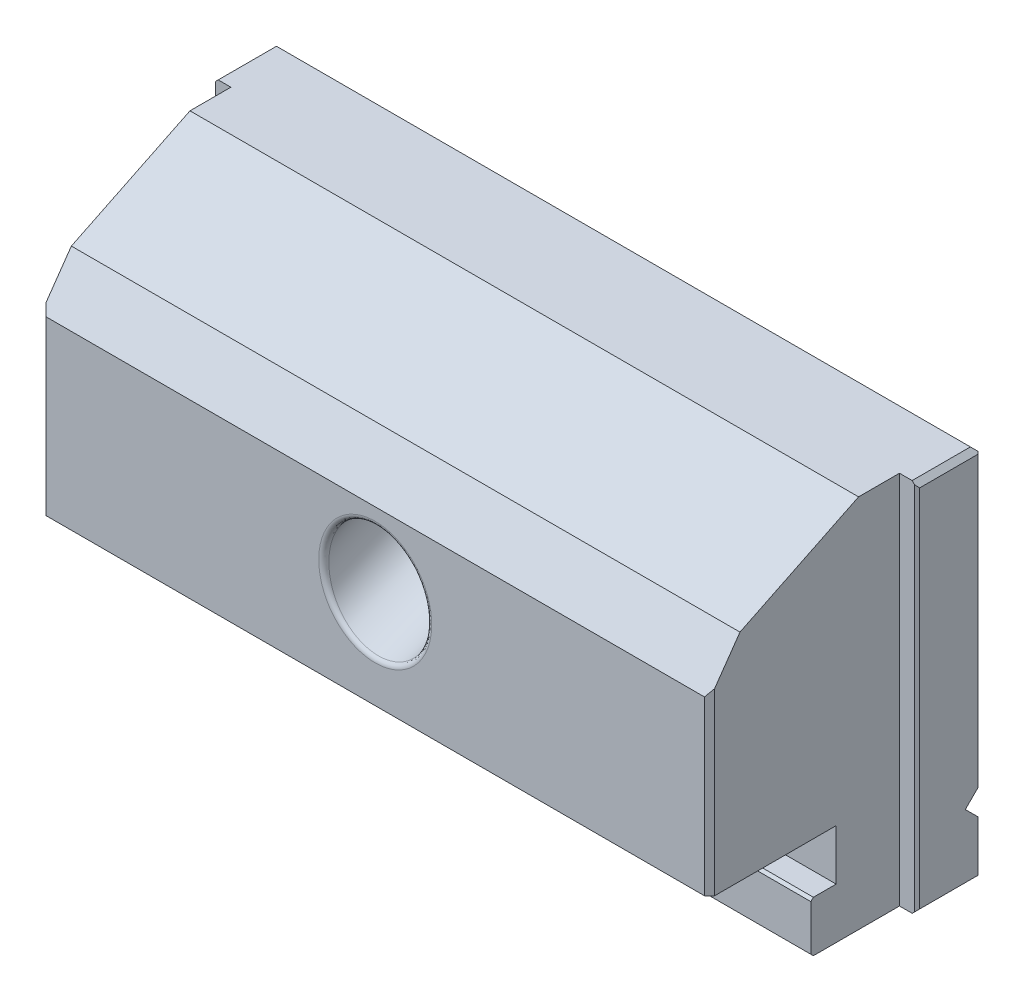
ISO-10303-21;
HEADER;
FILE_DESCRIPTION(('STEP AP214'),'2;1');
FILE_NAME('part.step','',(''),(''),'','','');
FILE_SCHEMA(('AUTOMOTIVE_DESIGN { 1 0 10303 214 1 1 1 1 }'));
ENDSEC;
DATA;
#1=APPLICATION_CONTEXT('core data for automotive mechanical design processes');
#2=APPLICATION_PROTOCOL_DEFINITION('international standard','automotive_design',2000,#1);
#3=PRODUCT_CONTEXT('',#1,'mechanical');
#4=PRODUCT('Part','Part','',(#3));
#5=PRODUCT_RELATED_PRODUCT_CATEGORY('part','',(#4));
#6=PRODUCT_DEFINITION_FORMATION('','',#4);
#7=PRODUCT_DEFINITION_CONTEXT('part definition',#1,'design');
#8=PRODUCT_DEFINITION('design','',#6,#7);
#9=PRODUCT_DEFINITION_SHAPE('','',#8);
#10=(LENGTH_UNIT() NAMED_UNIT(*) SI_UNIT(.MILLI.,.METRE.));
#11=(NAMED_UNIT(*) PLANE_ANGLE_UNIT() SI_UNIT($,.RADIAN.));
#12=(NAMED_UNIT(*) SI_UNIT($,.STERADIAN.) SOLID_ANGLE_UNIT());
#13=UNCERTAINTY_MEASURE_WITH_UNIT(LENGTH_MEASURE(1.E-05),#10,'distance_accuracy_value','');
#14=(GEOMETRIC_REPRESENTATION_CONTEXT(3) GLOBAL_UNCERTAINTY_ASSIGNED_CONTEXT((#13)) GLOBAL_UNIT_ASSIGNED_CONTEXT((#10,
#11,#12)) REPRESENTATION_CONTEXT('',''));
#15=CARTESIAN_POINT('',(0.,0.,0.));
#16=DIRECTION('',(0.,0.,1.));
#17=DIRECTION('',(1.,0.,0.));
#18=AXIS2_PLACEMENT_3D('',#15,#16,#17);
#19=CARTESIAN_POINT('',(94.9930264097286,5.08,-6.35));
#20=DIRECTION('',(0.,0.,-1.));
#21=DIRECTION('',(-1.,0.,0.));
#22=AXIS2_PLACEMENT_3D('',#19,#20,#21);
#23=PLANE('',#22);
#24=CARTESIAN_POINT('',(-9.525,2.54,-6.35));
#25=DIRECTION('',(0.,0.,1.));
#26=DIRECTION('',(1.,0.,0.));
#27=AXIS2_PLACEMENT_3D('',#24,#25,#26);
#28=CIRCLE('',#27,1.422654);
#29=CARTESIAN_POINT('',(-8.102346,2.54,-6.35));
#30=VERTEX_POINT('',#29);
#31=CARTESIAN_POINT('',(-8.10234654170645,2.53875850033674,-6.35));
#32=VERTEX_POINT('',#31);
#33=EDGE_CURVE('E443',#30,#32,#28,.T.);
#34=ORIENTED_EDGE('',*,*,#33,.F.);
#35=DIRECTION('',(1.,0.,0.));
#36=VECTOR('',#35,1.);
#37=CARTESIAN_POINT('',(-8.1026,2.54,-6.35));
#38=LINE('',#37,#36);
#39=CARTESIAN_POINT('',(-8.1026,2.54,-6.35));
#40=VERTEX_POINT('',#39);
#41=EDGE_CURVE('E458',#30,#40,#38,.F.);
#42=ORIENTED_EDGE('',*,*,#41,.T.);
#43=CARTESIAN_POINT('',(-9.525,2.54,-6.35));
#44=DIRECTION('',(0.,0.,1.));
#45=DIRECTION('',(1.,0.,0.));
#46=AXIS2_PLACEMENT_3D('',#43,#44,#45);
#47=CIRCLE('',#46,1.4224);
#48=CARTESIAN_POINT('',(-8.10260054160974,2.53875872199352,-6.35));
#49=VERTEX_POINT('',#48);
#50=EDGE_CURVE('E451',#40,#49,#47,.T.);
#51=ORIENTED_EDGE('',*,*,#50,.T.);
#52=DIRECTION('',(0.99999961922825,-0.000872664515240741,0.));
#53=VECTOR('',#52,1.);
#54=CARTESIAN_POINT('',(-8.10260054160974,2.53875872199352,-6.35));
#55=LINE('',#54,#53);
#56=EDGE_CURVE('E455',#32,#49,#55,.F.);
#57=ORIENTED_EDGE('',*,*,#56,.F.);
#58=EDGE_LOOP('',(#34,#42,#51,#57));
#59=FACE_BOUND('',#58,.T.);
#60=CARTESIAN_POINT('',(-9.525,2.54,-6.35));
#61=DIRECTION('',(0.,0.,-1.));
#62=DIRECTION('',(-1.,0.,0.));
#63=AXIS2_PLACEMENT_3D('',#60,#61,#62);
#64=CIRCLE('',#63,1.1303);
#65=CARTESIAN_POINT('',(-10.6553,2.54,-6.35));
#66=VERTEX_POINT('',#65);
#67=EDGE_CURVE('E571',#66,#66,#64,.T.);
#68=ORIENTED_EDGE('',*,*,#67,.T.);
#69=EDGE_LOOP('',(#68));
#70=FACE_BOUND('',#69,.T.);
#71=DIRECTION('',(-1.,0.,0.));
#72=VECTOR('',#71,1.);
#73=CARTESIAN_POINT('',(94.9930264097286,2.54,-6.35));
#74=LINE('',#73,#72);
#75=CARTESIAN_POINT('',(-11.3157,2.54,-6.35));
#76=VERTEX_POINT('',#75);
#77=CARTESIAN_POINT('',(-16.764,2.54,-6.35));
#78=VERTEX_POINT('',#77);
#79=EDGE_CURVE('E508',#76,#78,#74,.T.);
#80=ORIENTED_EDGE('',*,*,#79,.F.);
#81=CARTESIAN_POINT('',(-9.525,2.54,-6.35));
#82=DIRECTION('',(0.,0.,-1.));
#83=DIRECTION('',(-1.,0.,0.));
#84=AXIS2_PLACEMENT_3D('',#81,#82,#83);
#85=CIRCLE('',#84,1.7907);
#86=CARTESIAN_POINT('',(-7.7343,2.54,-6.35));
#87=VERTEX_POINT('',#86);
#88=EDGE_CURVE('E478',#87,#76,#85,.T.);
#89=ORIENTED_EDGE('',*,*,#88,.F.);
#90=CARTESIAN_POINT('',(7.7343,2.54,-6.35));
#91=VERTEX_POINT('',#90);
#92=EDGE_CURVE('E507',#91,#87,#74,.T.);
#93=ORIENTED_EDGE('',*,*,#92,.F.);
#94=CARTESIAN_POINT('',(9.525,2.54,-6.35));
#95=DIRECTION('',(0.,0.,-1.));
#96=DIRECTION('',(-1.,0.,0.));
#97=AXIS2_PLACEMENT_3D('',#94,#95,#96);
#98=CIRCLE('',#97,1.7907);
#99=CARTESIAN_POINT('',(11.3157,2.54,-6.35));
#100=VERTEX_POINT('',#99);
#101=EDGE_CURVE('E484',#100,#91,#98,.T.);
#102=ORIENTED_EDGE('',*,*,#101,.F.);
#103=CARTESIAN_POINT('',(16.764,2.54,-6.35));
#104=VERTEX_POINT('',#103);
#105=EDGE_CURVE('E503',#104,#100,#74,.T.);
#106=ORIENTED_EDGE('',*,*,#105,.F.);
#107=DIRECTION('',(0.,1.,0.));
#108=VECTOR('',#107,1.);
#109=CARTESIAN_POINT('',(16.764,18.796,-6.35));
#110=LINE('',#109,#108);
#111=CARTESIAN_POINT('',(16.764,5.08,-6.35));
#112=VERTEX_POINT('',#111);
#113=EDGE_CURVE('E555',#104,#112,#110,.T.);
#114=ORIENTED_EDGE('',*,*,#113,.T.);
#115=DIRECTION('',(-1.,0.,0.));
#116=VECTOR('',#115,1.);
#117=CARTESIAN_POINT('',(94.9930264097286,5.08,-6.35));
#118=LINE('',#117,#116);
#119=CARTESIAN_POINT('',(-16.764,5.08,-6.35));
#120=VERTEX_POINT('',#119);
#121=EDGE_CURVE('E506',#112,#120,#118,.T.);
#122=ORIENTED_EDGE('',*,*,#121,.T.);
#123=DIRECTION('',(0.,-1.,0.));
#124=VECTOR('',#123,1.);
#125=CARTESIAN_POINT('',(-16.764,18.796,-6.35));
#126=LINE('',#125,#124);
#127=EDGE_CURVE('E525',#120,#78,#126,.T.);
#128=ORIENTED_EDGE('',*,*,#127,.T.);
#129=EDGE_LOOP('',(#80,#89,#93,#102,#106,#114,#122,#128));
#130=FACE_BOUND('',#129,.T.);
#131=CARTESIAN_POINT('',(9.525,2.54,-6.35));
#132=DIRECTION('',(0.,0.,-1.));
#133=DIRECTION('',(-1.,0.,0.));
#134=AXIS2_PLACEMENT_3D('',#131,#132,#133);
#135=CIRCLE('',#134,1.1303);
#136=CARTESIAN_POINT('',(8.3947,2.54,-6.35));
#137=VERTEX_POINT('',#136);
#138=EDGE_CURVE('E574',#137,#137,#135,.T.);
#139=ORIENTED_EDGE('',*,*,#138,.T.);
#140=EDGE_LOOP('',(#139));
#141=FACE_BOUND('',#140,.T.);
#142=CARTESIAN_POINT('',(9.525,2.54,-6.35));
#143=DIRECTION('',(0.,0.,1.));
#144=DIRECTION('',(1.,0.,0.));
#145=AXIS2_PLACEMENT_3D('',#142,#143,#144);
#146=CIRCLE('',#145,1.422654);
#147=CARTESIAN_POINT('',(10.947654,2.54,-6.35));
#148=VERTEX_POINT('',#147);
#149=CARTESIAN_POINT('',(10.9476534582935,2.53875850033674,-6.35));
#150=VERTEX_POINT('',#149);
#151=EDGE_CURVE('E402',#148,#150,#146,.T.);
#152=ORIENTED_EDGE('',*,*,#151,.F.);
#153=DIRECTION('',(1.,0.,0.));
#154=VECTOR('',#153,1.);
#155=CARTESIAN_POINT('',(10.9474,2.54,-6.35));
#156=LINE('',#155,#154);
#157=CARTESIAN_POINT('',(10.9474,2.54,-6.35));
#158=VERTEX_POINT('',#157);
#159=EDGE_CURVE('E409',#148,#158,#156,.F.);
#160=ORIENTED_EDGE('',*,*,#159,.T.);
#161=CARTESIAN_POINT('',(9.525,2.54,-6.35));
#162=DIRECTION('',(0.,0.,1.));
#163=DIRECTION('',(1.,0.,0.));
#164=AXIS2_PLACEMENT_3D('',#161,#162,#163);
#165=CIRCLE('',#164,1.4224);
#166=CARTESIAN_POINT('',(10.9473994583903,2.53875872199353,-6.35));
#167=VERTEX_POINT('',#166);
#168=EDGE_CURVE('E422',#158,#167,#165,.T.);
#169=ORIENTED_EDGE('',*,*,#168,.T.);
#170=DIRECTION('',(0.999999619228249,-0.000872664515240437,0.));
#171=VECTOR('',#170,1.);
#172=CARTESIAN_POINT('',(10.9473994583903,2.53875872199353,-6.35));
#173=LINE('',#172,#171);
#174=EDGE_CURVE('E413',#150,#167,#173,.F.);
#175=ORIENTED_EDGE('',*,*,#174,.F.);
#176=EDGE_LOOP('',(#152,#160,#169,#175));
#177=FACE_BOUND('',#176,.T.);
#178=ADVANCED_FACE('F15',(#59,#70,#130,#141,#177),#23,.F.);
#179=CARTESIAN_POINT('',(-254.,4.191,-12.7));
#180=DIRECTION('',(0.,0.707106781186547,0.707106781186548));
#181=DIRECTION('',(0.,-0.707106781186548,0.707106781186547));
#182=AXIS2_PLACEMENT_3D('',#179,#180,#181);
#183=PLANE('',#182);
#184=CARTESIAN_POINT('',(9.525,2.54,-11.049));
#185=DIRECTION('',(0.,0.707106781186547,0.707106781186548));
#186=DIRECTION('',(0.,-0.707106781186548,0.707106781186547));
#187=AXIS2_PLACEMENT_3D('',#184,#185,#186);
#188=ELLIPSE('',#187,2.01157737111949,1.4224);
#189=CARTESIAN_POINT('',(10.6353606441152,3.429,-11.938));
#190=VERTEX_POINT('',#189);
#191=CARTESIAN_POINT('',(8.41463935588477,3.429,-11.938));
#192=VERTEX_POINT('',#191);
#193=EDGE_CURVE('E435',#190,#192,#188,.T.);
#194=ORIENTED_EDGE('',*,*,#193,.F.);
#195=DIRECTION('',(1.,0.,0.));
#196=VECTOR('',#195,1.);
#197=CARTESIAN_POINT('',(-254.,3.429,-11.938));
#198=LINE('',#197,#196);
#199=CARTESIAN_POINT('',(10.22303802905,3.429,-11.938));
#200=VERTEX_POINT('',#199);
#201=EDGE_CURVE('E494',#200,#190,#198,.T.);
#202=ORIENTED_EDGE('',*,*,#201,.F.);
#203=CARTESIAN_POINT('',(9.525,2.54,-11.049));
#204=DIRECTION('',(0.,0.707106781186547,0.707106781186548));
#205=DIRECTION('',(0.,-0.707106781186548,0.707106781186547));
#206=AXIS2_PLACEMENT_3D('',#203,#204,#205);
#207=ELLIPSE('',#206,1.59848558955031,1.1303);
#208=CARTESIAN_POINT('',(8.82696197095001,3.429,-11.938));
#209=VERTEX_POINT('',#208);
#210=EDGE_CURVE('E592',#209,#200,#207,.F.);
#211=ORIENTED_EDGE('',*,*,#210,.F.);
#212=EDGE_CURVE('E497',#192,#209,#198,.T.);
#213=ORIENTED_EDGE('',*,*,#212,.F.);
#214=EDGE_LOOP('',(#194,#202,#211,#213));
#215=FACE_BOUND('',#214,.T.);
#216=ADVANCED_FACE('F652',(#215),#183,.F.);
#217=CARTESIAN_POINT('',(-254.,2.667,-12.7));
#218=DIRECTION('',(0.,0.707106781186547,-0.707106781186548));
#219=DIRECTION('',(0.,0.707106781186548,0.707106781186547));
#220=AXIS2_PLACEMENT_3D('',#217,#218,#219);
#221=PLANE('',#220);
#222=CARTESIAN_POINT('',(8.55738000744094,3.1242,-12.2428));
#223=CARTESIAN_POINT('',(8.49896645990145,3.09119059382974,-12.2758094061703));
#224=CARTESIAN_POINT('',(8.44261905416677,3.05644695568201,-12.310553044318));
#225=CARTESIAN_POINT('',(8.33379463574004,2.98430633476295,-12.3826936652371));
#226=CARTESIAN_POINT('',(8.28130440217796,2.94691936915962,-12.4200806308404));
#227=CARTESIAN_POINT('',(8.17959781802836,2.87011966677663,-12.4968803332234));
#228=CARTESIAN_POINT('',(8.13037645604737,2.83071020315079,-12.5362897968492));
#229=CARTESIAN_POINT('',(8.03455599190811,2.75008100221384,-12.6169189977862));
#230=CARTESIAN_POINT('',(7.98796695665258,2.70885526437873,-12.6581447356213));
#231=CARTESIAN_POINT('',(7.94258815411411,2.667,-12.7));
#232=B_SPLINE_CURVE_WITH_KNOTS('',3,(#222,#223,#224,#225,#226,#227,#228,#229,#230,#231),
.UNSPECIFIED.,.F.,.F.,(4,2,2,2,4),(0.,0.224139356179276,0.447470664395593,0.670451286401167,
0.894233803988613),.UNSPECIFIED.);
#233=CARTESIAN_POINT('',(8.55738000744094,3.1242,-12.2428));
#234=VERTEX_POINT('',#233);
#235=CARTESIAN_POINT('',(8.13291546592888,2.8321,-12.5349));
#236=VERTEX_POINT('',#235);
#237=EDGE_CURVE('E779',#234,#236,#232,.T.);
#238=ORIENTED_EDGE('',*,*,#237,.T.);
#239=CARTESIAN_POINT('',(9.525,2.54,-12.827));
#240=DIRECTION('',(0.,0.707106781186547,-0.707106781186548));
#241=DIRECTION('',(0.,0.707106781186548,0.707106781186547));
#242=AXIS2_PLACEMENT_3D('',#239,#240,#241);
#243=ELLIPSE('',#242,2.01157737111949,1.4224);
#244=EDGE_CURVE('E437',#236,#192,#243,.T.);
#245=ORIENTED_EDGE('',*,*,#244,.T.);
#246=ORIENTED_EDGE('',*,*,#212,.T.);
#247=CARTESIAN_POINT('',(9.525,2.54,-12.827));
#248=DIRECTION('',(0.,0.707106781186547,-0.707106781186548));
#249=DIRECTION('',(0.,0.707106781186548,0.707106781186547));
#250=AXIS2_PLACEMENT_3D('',#247,#248,#249);
#251=ELLIPSE('',#250,1.59848558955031,1.1303);
#252=EDGE_CURVE('E586',#209,#234,#251,.F.);
#253=ORIENTED_EDGE('',*,*,#252,.T.);
#254=EDGE_LOOP('',(#238,#245,#246,#253));
#255=FACE_BOUND('',#254,.T.);
#256=ADVANCED_FACE('F658',(#255),#221,.T.);
#257=ORIENTED_EDGE('',*,*,#201,.T.);
#258=CARTESIAN_POINT('',(9.525,2.54,-12.827));
#259=DIRECTION('',(0.,0.707106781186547,-0.707106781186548));
#260=DIRECTION('',(0.,0.707106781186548,0.707106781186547));
#261=AXIS2_PLACEMENT_3D('',#258,#259,#260);
#262=ELLIPSE('',#261,2.01157737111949,1.4224);
#263=CARTESIAN_POINT('',(10.9170845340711,2.8321,-12.5349));
#264=VERTEX_POINT('',#263);
#265=EDGE_CURVE('E432',#190,#264,#262,.T.);
#266=ORIENTED_EDGE('',*,*,#265,.T.);
#267=CARTESIAN_POINT('',(11.1074118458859,2.667,-12.7));
#268=CARTESIAN_POINT('',(11.0620330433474,2.70885526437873,-12.6581447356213));
#269=CARTESIAN_POINT('',(11.0154440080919,2.75008100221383,-12.6169189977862));
#270=CARTESIAN_POINT('',(10.9196235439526,2.83071020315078,-12.5362897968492));
#271=CARTESIAN_POINT('',(10.8704021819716,2.87011966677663,-12.4968803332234));
#272=CARTESIAN_POINT('',(10.768695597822,2.94691936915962,-12.4200806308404));
#273=CARTESIAN_POINT('',(10.71620536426,2.98430633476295,-12.3826936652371));
#274=CARTESIAN_POINT('',(10.6073809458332,3.05644695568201,-12.310553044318));
#275=CARTESIAN_POINT('',(10.5510335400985,3.09119059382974,-12.2758094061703));
#276=CARTESIAN_POINT('',(10.4926199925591,3.1242,-12.2428));
#277=B_SPLINE_CURVE_WITH_KNOTS('',3,(#267,#268,#269,#270,#271,#272,#273,#274,#275,#276),
.UNSPECIFIED.,.F.,.F.,(4,2,2,2,4),(0.,0.223782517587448,0.446763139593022,0.670094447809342,
0.894233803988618),.UNSPECIFIED.);
#278=CARTESIAN_POINT('',(10.4926199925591,3.1242,-12.2428));
#279=VERTEX_POINT('',#278);
#280=EDGE_CURVE('E737',#264,#279,#277,.T.);
#281=ORIENTED_EDGE('',*,*,#280,.T.);
#282=CARTESIAN_POINT('',(9.525,2.54,-12.827));
#283=DIRECTION('',(0.,0.707106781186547,-0.707106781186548));
#284=DIRECTION('',(0.,0.707106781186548,0.707106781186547));
#285=AXIS2_PLACEMENT_3D('',#282,#283,#284);
#286=ELLIPSE('',#285,1.59848558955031,1.1303);
#287=EDGE_CURVE('E590',#279,#200,#286,.F.);
#288=ORIENTED_EDGE('',*,*,#287,.T.);
#289=EDGE_LOOP('',(#257,#266,#281,#288));
#290=FACE_BOUND('',#289,.T.);
#291=ADVANCED_FACE('F795',(#290),#221,.T.);
#292=CARTESIAN_POINT('',(9.525,2.54,-12.2428));
#293=DIRECTION('',(0.,0.,-1.));
#294=DIRECTION('',(-1.,0.,0.));
#295=AXIS2_PLACEMENT_3D('',#292,#293,#294);
#296=CONICAL_SURFACE('',#295,1.1303,0.785398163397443);
#297=DIRECTION('',(-0.707106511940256,0.000617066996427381,0.707106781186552));
#298=VECTOR('',#297,1.);
#299=CARTESIAN_POINT('',(9.525,2.54,-11.1125));
#300=LINE('',#299,#298);
#301=CARTESIAN_POINT('',(10.9476534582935,2.53875850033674,-12.535154));
#302=VERTEX_POINT('',#301);
#303=CARTESIAN_POINT('',(10.9473994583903,2.53875872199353,-12.5349));
#304=VERTEX_POINT('',#303);
#305=EDGE_CURVE('E19',#302,#304,#300,.T.);
#306=ORIENTED_EDGE('',*,*,#305,.T.);
#307=CARTESIAN_POINT('',(9.525,2.54,-12.5349));
#308=DIRECTION('',(0.,0.,-1.));
#309=DIRECTION('',(-1.,0.,0.));
#310=AXIS2_PLACEMENT_3D('',#307,#308,#309);
#311=CIRCLE('',#310,1.4224);
#312=EDGE_CURVE('E9',#304,#236,#311,.T.);
#313=ORIENTED_EDGE('',*,*,#312,.T.);
#314=ORIENTED_EDGE('',*,*,#237,.F.);
#315=CARTESIAN_POINT('',(9.525,2.54,-12.2428));
#316=DIRECTION('',(0.,0.,-1.));
#317=DIRECTION('',(-1.,0.,0.));
#318=AXIS2_PLACEMENT_3D('',#315,#316,#317);
#319=CIRCLE('',#318,1.1303);
#320=EDGE_CURVE('E777',#279,#234,#319,.T.);
#321=ORIENTED_EDGE('',*,*,#320,.F.);
#322=ORIENTED_EDGE('',*,*,#280,.F.);
#323=CARTESIAN_POINT('',(10.9474,2.54,-12.5349));
#324=VERTEX_POINT('',#323);
#325=EDGE_CURVE('E24',#264,#324,#311,.T.);
#326=ORIENTED_EDGE('',*,*,#325,.T.);
#327=DIRECTION('',(-0.707106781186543,0.,0.707106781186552));
#328=VECTOR('',#327,1.);
#329=CARTESIAN_POINT('',(9.525,2.54,-11.1125));
#330=LINE('',#329,#328);
#331=CARTESIAN_POINT('',(10.947654,2.54,-12.535154));
#332=VERTEX_POINT('',#331);
#333=EDGE_CURVE('E1083',#324,#332,#330,.F.);
#334=ORIENTED_EDGE('',*,*,#333,.T.);
#335=CARTESIAN_POINT('',(9.525,2.54,-12.535154));
#336=DIRECTION('',(0.,0.,-1.));
#337=DIRECTION('',(-1.,0.,0.));
#338=AXIS2_PLACEMENT_3D('',#335,#336,#337);
#339=CIRCLE('',#338,1.422654);
#340=CARTESIAN_POINT('',(10.917397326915,2.831846,-12.535154));
#341=VERTEX_POINT('',#340);
#342=EDGE_CURVE('E404',#341,#332,#339,.T.);
#343=ORIENTED_EDGE('',*,*,#342,.F.);
#344=CARTESIAN_POINT('',(11.1074118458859,2.667,-12.7));
#345=VERTEX_POINT('',#344);
#346=EDGE_CURVE('E733',#345,#341,#277,.T.);
#347=ORIENTED_EDGE('',*,*,#346,.F.);
#348=CARTESIAN_POINT('',(9.525,2.54,-12.7));
#349=DIRECTION('',(0.,0.,-1.));
#350=DIRECTION('',(-1.,0.,0.));
#351=AXIS2_PLACEMENT_3D('',#348,#349,#350);
#352=CIRCLE('',#351,1.5875);
#353=CARTESIAN_POINT('',(7.94258815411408,2.667,-12.7));
#354=VERTEX_POINT('',#353);
#355=EDGE_CURVE('E787',#354,#345,#352,.F.);
#356=ORIENTED_EDGE('',*,*,#355,.F.);
#357=CARTESIAN_POINT('',(8.13260267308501,2.831846,-12.535154));
#358=VERTEX_POINT('',#357);
#359=EDGE_CURVE('E776',#358,#354,#232,.T.);
#360=ORIENTED_EDGE('',*,*,#359,.F.);
#361=EDGE_CURVE('E1085',#302,#358,#339,.T.);
#362=ORIENTED_EDGE('',*,*,#361,.F.);
#363=EDGE_LOOP('',(#306,#313,#314,#321,#322,#326,#334,#343,#347,#356,#360,#362));
#364=FACE_BOUND('',#363,.T.);
#365=ADVANCED_FACE('F763',(#364),#296,.F.);
#366=CARTESIAN_POINT('',(-9.525,2.54,-11.049));
#367=DIRECTION('',(0.,0.707106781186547,0.707106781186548));
#368=DIRECTION('',(0.,-0.707106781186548,0.707106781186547));
#369=AXIS2_PLACEMENT_3D('',#366,#367,#368);
#370=ELLIPSE('',#369,2.01157737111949,1.4224);
#371=CARTESIAN_POINT('',(-8.41463935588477,3.429,-11.938));
#372=VERTEX_POINT('',#371);
#373=CARTESIAN_POINT('',(-10.6353606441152,3.429,-11.938));
#374=VERTEX_POINT('',#373);
#375=EDGE_CURVE('E472',#372,#374,#370,.T.);
#376=ORIENTED_EDGE('',*,*,#375,.F.);
#377=CARTESIAN_POINT('',(-8.82696197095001,3.429,-11.938));
#378=VERTEX_POINT('',#377);
#379=EDGE_CURVE('E1068',#378,#372,#198,.T.);
#380=ORIENTED_EDGE('',*,*,#379,.F.);
#381=CARTESIAN_POINT('',(-9.525,2.54,-11.049));
#382=DIRECTION('',(0.,0.707106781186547,0.707106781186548));
#383=DIRECTION('',(0.,-0.707106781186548,0.707106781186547));
#384=AXIS2_PLACEMENT_3D('',#381,#382,#383);
#385=ELLIPSE('',#384,1.59848558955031,1.1303);
#386=CARTESIAN_POINT('',(-10.22303802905,3.429,-11.938));
#387=VERTEX_POINT('',#386);
#388=EDGE_CURVE('E580',#387,#378,#385,.F.);
#389=ORIENTED_EDGE('',*,*,#388,.F.);
#390=EDGE_CURVE('E1069',#374,#387,#198,.T.);
#391=ORIENTED_EDGE('',*,*,#390,.F.);
#392=EDGE_LOOP('',(#376,#380,#389,#391));
#393=FACE_BOUND('',#392,.T.);
#394=ADVANCED_FACE('F661',(#393),#183,.F.);
#395=ORIENTED_EDGE('',*,*,#379,.T.);
#396=CARTESIAN_POINT('',(-9.525,2.54,-12.827));
#397=DIRECTION('',(0.,0.707106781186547,-0.707106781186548));
#398=DIRECTION('',(0.,0.707106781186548,0.707106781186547));
#399=AXIS2_PLACEMENT_3D('',#396,#397,#398);
#400=ELLIPSE('',#399,2.01157737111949,1.4224);
#401=CARTESIAN_POINT('',(-8.13291546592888,2.8321,-12.5349));
#402=VERTEX_POINT('',#401);
#403=EDGE_CURVE('E469',#372,#402,#400,.T.);
#404=ORIENTED_EDGE('',*,*,#403,.T.);
#405=CARTESIAN_POINT('',(-7.94258815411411,2.667,-12.7));
#406=CARTESIAN_POINT('',(-7.98796695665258,2.70885526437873,-12.6581447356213));
#407=CARTESIAN_POINT('',(-8.03455599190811,2.75008100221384,-12.6169189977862));
#408=CARTESIAN_POINT('',(-8.13037645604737,2.83071020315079,-12.5362897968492));
#409=CARTESIAN_POINT('',(-8.17959781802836,2.87011966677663,-12.4968803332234));
#410=CARTESIAN_POINT('',(-8.28130440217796,2.94691936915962,-12.4200806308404));
#411=CARTESIAN_POINT('',(-8.33379463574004,2.98430633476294,-12.3826936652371));
#412=CARTESIAN_POINT('',(-8.44261905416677,3.05644695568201,-12.310553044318));
#413=CARTESIAN_POINT('',(-8.49896645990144,3.09119059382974,-12.2758094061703));
#414=CARTESIAN_POINT('',(-8.55738000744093,3.1242,-12.2428));
#415=B_SPLINE_CURVE_WITH_KNOTS('',3,(#405,#406,#407,#408,#409,#410,#411,#412,#413,#414),
.UNSPECIFIED.,.F.,.F.,(4,2,2,2,4),(0.,0.223782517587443,0.446763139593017,0.67009444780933,
0.894233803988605),.UNSPECIFIED.);
#416=CARTESIAN_POINT('',(-8.55738000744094,3.1242,-12.2428));
#417=VERTEX_POINT('',#416);
#418=EDGE_CURVE('E728',#402,#417,#415,.T.);
#419=ORIENTED_EDGE('',*,*,#418,.T.);
#420=CARTESIAN_POINT('',(-9.525,2.54,-12.827));
#421=DIRECTION('',(0.,0.707106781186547,-0.707106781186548));
#422=DIRECTION('',(0.,0.707106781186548,0.707106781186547));
#423=AXIS2_PLACEMENT_3D('',#420,#421,#422);
#424=ELLIPSE('',#423,1.59848558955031,1.1303);
#425=EDGE_CURVE('E560',#417,#378,#424,.F.);
#426=ORIENTED_EDGE('',*,*,#425,.T.);
#427=EDGE_LOOP('',(#395,#404,#419,#426));
#428=FACE_BOUND('',#427,.T.);
#429=ADVANCED_FACE('F1099',(#428),#221,.T.);
#430=CARTESIAN_POINT('',(-10.4926199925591,3.1242,-12.2428));
#431=CARTESIAN_POINT('',(-10.5510335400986,3.09119059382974,-12.2758094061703));
#432=CARTESIAN_POINT('',(-10.6073809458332,3.05644695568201,-12.310553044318));
#433=CARTESIAN_POINT('',(-10.71620536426,2.98430633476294,-12.3826936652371));
#434=CARTESIAN_POINT('',(-10.768695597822,2.94691936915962,-12.4200806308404));
#435=CARTESIAN_POINT('',(-10.8704021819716,2.87011966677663,-12.4968803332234));
#436=CARTESIAN_POINT('',(-10.9196235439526,2.83071020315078,-12.5362897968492));
#437=CARTESIAN_POINT('',(-11.0154440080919,2.75008100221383,-12.6169189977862));
#438=CARTESIAN_POINT('',(-11.0620330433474,2.70885526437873,-12.6581447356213));
#439=CARTESIAN_POINT('',(-11.1074118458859,2.667,-12.7));
#440=B_SPLINE_CURVE_WITH_KNOTS('',3,(#430,#431,#432,#433,#434,#435,#436,#437,#438,#439),
.UNSPECIFIED.,.F.,.F.,(4,2,2,2,4),(0.,0.22413935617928,0.447470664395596,0.67045128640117,
0.894233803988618),.UNSPECIFIED.);
#441=CARTESIAN_POINT('',(-10.4926199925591,3.1242,-12.2428));
#442=VERTEX_POINT('',#441);
#443=CARTESIAN_POINT('',(-10.9170845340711,2.8321,-12.5349));
#444=VERTEX_POINT('',#443);
#445=EDGE_CURVE('E731',#442,#444,#440,.T.);
#446=ORIENTED_EDGE('',*,*,#445,.T.);
#447=CARTESIAN_POINT('',(-9.525,2.54,-12.827));
#448=DIRECTION('',(0.,0.707106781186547,-0.707106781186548));
#449=DIRECTION('',(0.,0.707106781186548,0.707106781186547));
#450=AXIS2_PLACEMENT_3D('',#447,#448,#449);
#451=ELLIPSE('',#450,2.01157737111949,1.4224);
#452=EDGE_CURVE('E474',#444,#374,#451,.T.);
#453=ORIENTED_EDGE('',*,*,#452,.T.);
#454=ORIENTED_EDGE('',*,*,#390,.T.);
#455=CARTESIAN_POINT('',(-9.525,2.54,-12.827));
#456=DIRECTION('',(0.,0.707106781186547,-0.707106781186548));
#457=DIRECTION('',(0.,0.707106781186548,0.707106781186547));
#458=AXIS2_PLACEMENT_3D('',#455,#456,#457);
#459=ELLIPSE('',#458,1.59848558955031,1.1303);
#460=EDGE_CURVE('E576',#387,#442,#459,.F.);
#461=ORIENTED_EDGE('',*,*,#460,.T.);
#462=EDGE_LOOP('',(#446,#453,#454,#461));
#463=FACE_BOUND('',#462,.T.);
#464=ADVANCED_FACE('F760',(#463),#221,.T.);
#465=CARTESIAN_POINT('',(-9.525,2.54,-12.2428));
#466=DIRECTION('',(0.,0.,-1.));
#467=DIRECTION('',(-1.,0.,0.));
#468=AXIS2_PLACEMENT_3D('',#465,#466,#467);
#469=CONICAL_SURFACE('',#468,1.1303,0.785398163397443);
#470=DIRECTION('',(-0.707106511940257,0.000617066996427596,0.707106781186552));
#471=VECTOR('',#470,1.);
#472=CARTESIAN_POINT('',(-9.525,2.54,-11.1125));
#473=LINE('',#472,#471);
#474=CARTESIAN_POINT('',(-8.10234654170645,2.53875850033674,-12.535154));
#475=VERTEX_POINT('',#474);
#476=CARTESIAN_POINT('',(-8.10260054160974,2.53875872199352,-12.5349));
#477=VERTEX_POINT('',#476);
#478=EDGE_CURVE('E1079',#475,#477,#473,.T.);
#479=ORIENTED_EDGE('',*,*,#478,.T.);
#480=CARTESIAN_POINT('',(-9.525,2.54,-12.5349));
#481=DIRECTION('',(0.,0.,-1.));
#482=DIRECTION('',(-1.,0.,0.));
#483=AXIS2_PLACEMENT_3D('',#480,#481,#482);
#484=CIRCLE('',#483,1.4224);
#485=EDGE_CURVE('E1080',#477,#444,#484,.T.);
#486=ORIENTED_EDGE('',*,*,#485,.T.);
#487=ORIENTED_EDGE('',*,*,#445,.F.);
#488=CARTESIAN_POINT('',(-9.525,2.54,-12.2428));
#489=DIRECTION('',(0.,0.,-1.));
#490=DIRECTION('',(-1.,0.,0.));
#491=AXIS2_PLACEMENT_3D('',#488,#489,#490);
#492=CIRCLE('',#491,1.1303);
#493=EDGE_CURVE('E718',#417,#442,#492,.T.);
#494=ORIENTED_EDGE('',*,*,#493,.F.);
#495=ORIENTED_EDGE('',*,*,#418,.F.);
#496=CARTESIAN_POINT('',(-8.1026,2.54,-12.5349));
#497=VERTEX_POINT('',#496);
#498=EDGE_CURVE('E1078',#402,#497,#484,.T.);
#499=ORIENTED_EDGE('',*,*,#498,.T.);
#500=DIRECTION('',(-0.707106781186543,0.,0.707106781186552));
#501=VECTOR('',#500,1.);
#502=CARTESIAN_POINT('',(-9.525,2.54,-11.1125));
#503=LINE('',#502,#501);
#504=CARTESIAN_POINT('',(-8.102346,2.54,-12.535154));
#505=VERTEX_POINT('',#504);
#506=EDGE_CURVE('E1077',#497,#505,#503,.F.);
#507=ORIENTED_EDGE('',*,*,#506,.T.);
#508=CARTESIAN_POINT('',(-9.525,2.54,-12.535154));
#509=DIRECTION('',(0.,0.,-1.));
#510=DIRECTION('',(-1.,0.,0.));
#511=AXIS2_PLACEMENT_3D('',#508,#509,#510);
#512=CIRCLE('',#511,1.422654);
#513=CARTESIAN_POINT('',(-8.13260267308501,2.831846,-12.535154));
#514=VERTEX_POINT('',#513);
#515=EDGE_CURVE('E752',#514,#505,#512,.T.);
#516=ORIENTED_EDGE('',*,*,#515,.F.);
#517=CARTESIAN_POINT('',(-7.94258815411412,2.667,-12.7));
#518=VERTEX_POINT('',#517);
#519=EDGE_CURVE('E768',#518,#514,#415,.T.);
#520=ORIENTED_EDGE('',*,*,#519,.F.);
#521=CARTESIAN_POINT('',(-9.525,2.54,-12.7));
#522=DIRECTION('',(0.,0.,-1.));
#523=DIRECTION('',(-1.,0.,0.));
#524=AXIS2_PLACEMENT_3D('',#521,#522,#523);
#525=CIRCLE('',#524,1.5875);
#526=CARTESIAN_POINT('',(-11.1074118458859,2.667,-12.7));
#527=VERTEX_POINT('',#526);
#528=EDGE_CURVE('E786',#527,#518,#525,.F.);
#529=ORIENTED_EDGE('',*,*,#528,.F.);
#530=CARTESIAN_POINT('',(-10.917397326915,2.831846,-12.535154));
#531=VERTEX_POINT('',#530);
#532=EDGE_CURVE('E732',#531,#527,#440,.T.);
#533=ORIENTED_EDGE('',*,*,#532,.F.);
#534=EDGE_CURVE('E1074',#475,#531,#512,.T.);
#535=ORIENTED_EDGE('',*,*,#534,.F.);
#536=EDGE_LOOP('',(#479,#486,#487,#494,#495,#499,#507,#516,#520,#529,#533,#535));
#537=FACE_BOUND('',#536,.T.);
#538=ADVANCED_FACE('F726',(#537),#469,.F.);
#539=CARTESIAN_POINT('',(-17.6657,18.796,-12.7));
#540=DIRECTION('',(0.,0.,-1.));
#541=DIRECTION('',(-1.,0.,0.));
#542=AXIS2_PLACEMENT_3D('',#539,#540,#541);
#543=PLANE('',#542);
#544=DIRECTION('',(1.,0.,0.));
#545=VECTOR('',#544,1.);
#546=CARTESIAN_POINT('',(-254.,2.667,-12.7));
#547=LINE('',#546,#545);
#548=EDGE_CURVE('E501',#518,#354,#547,.T.);
#549=ORIENTED_EDGE('',*,*,#548,.T.);
#550=ORIENTED_EDGE('',*,*,#355,.T.);
#551=CARTESIAN_POINT('',(17.526,2.667,-12.7));
#552=VERTEX_POINT('',#551);
#553=EDGE_CURVE('E492',#345,#552,#547,.T.);
#554=ORIENTED_EDGE('',*,*,#553,.T.);
#555=DIRECTION('',(0.,-1.,0.));
#556=VECTOR('',#555,1.);
#557=CARTESIAN_POINT('',(17.526,18.796,-12.7));
#558=LINE('',#557,#556);
#559=CARTESIAN_POINT('',(17.526,0.254000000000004,-12.7));
#560=VERTEX_POINT('',#559);
#561=EDGE_CURVE('E852',#552,#560,#558,.T.);
#562=ORIENTED_EDGE('',*,*,#561,.T.);
#563=DIRECTION('',(-1.,0.,0.));
#564=VECTOR('',#563,1.);
#565=CARTESIAN_POINT('',(-17.6657,0.254,-12.7));
#566=LINE('',#565,#564);
#567=CARTESIAN_POINT('',(-17.526,0.254,-12.7));
#568=VERTEX_POINT('',#567);
#569=EDGE_CURVE('E930',#560,#568,#566,.T.);
#570=ORIENTED_EDGE('',*,*,#569,.T.);
#571=DIRECTION('',(0.,1.,0.));
#572=VECTOR('',#571,1.);
#573=CARTESIAN_POINT('',(-17.526,18.796,-12.7));
#574=LINE('',#573,#572);
#575=CARTESIAN_POINT('',(-17.526,2.667,-12.7));
#576=VERTEX_POINT('',#575);
#577=EDGE_CURVE('E850',#568,#576,#574,.T.);
#578=ORIENTED_EDGE('',*,*,#577,.T.);
#579=EDGE_CURVE('E502',#576,#527,#547,.T.);
#580=ORIENTED_EDGE('',*,*,#579,.T.);
#581=ORIENTED_EDGE('',*,*,#528,.T.);
#582=EDGE_LOOP('',(#549,#550,#554,#562,#570,#578,#580,#581));
#583=FACE_BOUND('',#582,.T.);
#584=ADVANCED_FACE('F646',(#583),#543,.T.);
#585=CARTESIAN_POINT('',(9.525,2.54,-90.0273264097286));
#586=DIRECTION('',(0.,0.,1.));
#587=DIRECTION('',(1.,0.,0.));
#588=AXIS2_PLACEMENT_3D('',#585,#586,#587);
#589=CYLINDRICAL_SURFACE('',#588,1.1303);
#590=ORIENTED_EDGE('',*,*,#138,.F.);
#591=EDGE_LOOP('',(#590));
#592=FACE_BOUND('',#591,.T.);
#593=ORIENTED_EDGE('',*,*,#287,.F.);
#594=ORIENTED_EDGE('',*,*,#320,.T.);
#595=ORIENTED_EDGE('',*,*,#252,.F.);
#596=ORIENTED_EDGE('',*,*,#210,.T.);
#597=EDGE_LOOP('',(#593,#594,#595,#596));
#598=FACE_BOUND('',#597,.T.);
#599=ADVANCED_FACE('F622',(#592,#598),#589,.F.);
#600=CARTESIAN_POINT('',(-9.525,2.54,-90.0273264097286));
#601=DIRECTION('',(0.,0.,1.));
#602=DIRECTION('',(1.,0.,0.));
#603=AXIS2_PLACEMENT_3D('',#600,#601,#602);
#604=CYLINDRICAL_SURFACE('',#603,1.1303);
#605=ORIENTED_EDGE('',*,*,#67,.F.);
#606=EDGE_LOOP('',(#605));
#607=FACE_BOUND('',#606,.T.);
#608=ORIENTED_EDGE('',*,*,#425,.F.);
#609=ORIENTED_EDGE('',*,*,#493,.T.);
#610=ORIENTED_EDGE('',*,*,#460,.F.);
#611=ORIENTED_EDGE('',*,*,#388,.T.);
#612=EDGE_LOOP('',(#608,#609,#610,#611));
#613=FACE_BOUND('',#612,.T.);
#614=ADVANCED_FACE('F702',(#607,#613),#604,.F.);
#615=CARTESIAN_POINT('',(94.9930264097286,2.54,-6.35));
#616=DIRECTION('',(0.,-1.,0.));
#617=DIRECTION('',(0.,0.,-1.));
#618=AXIS2_PLACEMENT_3D('',#615,#616,#617);
#619=PLANE('',#618);
#620=DIRECTION('',(0.,0.,-1.));
#621=VECTOR('',#620,1.);
#622=CARTESIAN_POINT('',(-7.7343,2.54,-5.08));
#623=LINE('',#622,#621);
#624=CARTESIAN_POINT('',(-7.7343,2.54,-5.207));
#625=VERTEX_POINT('',#624);
#626=EDGE_CURVE('E483',#87,#625,#623,.F.);
#627=ORIENTED_EDGE('',*,*,#626,.T.);
#628=DIRECTION('',(1.,0.,0.));
#629=VECTOR('',#628,1.);
#630=CARTESIAN_POINT('',(94.9930264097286,2.54,-5.207));
#631=LINE('',#630,#629);
#632=CARTESIAN_POINT('',(7.7343,2.54,-5.207));
#633=VERTEX_POINT('',#632);
#634=EDGE_CURVE('E951',#625,#633,#631,.T.);
#635=ORIENTED_EDGE('',*,*,#634,.T.);
#636=DIRECTION('',(0.,0.,-1.));
#637=VECTOR('',#636,1.);
#638=CARTESIAN_POINT('',(7.7343,2.54,-5.08));
#639=LINE('',#638,#637);
#640=EDGE_CURVE('E493',#633,#91,#639,.T.);
#641=ORIENTED_EDGE('',*,*,#640,.T.);
#642=ORIENTED_EDGE('',*,*,#92,.T.);
#643=EDGE_LOOP('',(#627,#635,#641,#642));
#644=FACE_BOUND('',#643,.T.);
#645=ADVANCED_FACE('F704',(#644),#619,.F.);
#646=DIRECTION('',(0.,0.,-1.));
#647=VECTOR('',#646,1.);
#648=CARTESIAN_POINT('',(11.3157,2.54,-5.08));
#649=LINE('',#648,#647);
#650=CARTESIAN_POINT('',(11.3157,2.54,-5.207));
#651=VERTEX_POINT('',#650);
#652=EDGE_CURVE('E487',#100,#651,#649,.F.);
#653=ORIENTED_EDGE('',*,*,#652,.T.);
#654=DIRECTION('',(1.,0.,0.));
#655=VECTOR('',#654,1.);
#656=CARTESIAN_POINT('',(94.9930264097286,2.54,-5.207));
#657=LINE('',#656,#655);
#658=CARTESIAN_POINT('',(16.764,2.54,-5.207));
#659=VERTEX_POINT('',#658);
#660=EDGE_CURVE('E961',#651,#659,#657,.T.);
#661=ORIENTED_EDGE('',*,*,#660,.T.);
#662=DIRECTION('',(0.,0.,-1.));
#663=VECTOR('',#662,1.);
#664=CARTESIAN_POINT('',(16.764,2.54,-9.525));
#665=LINE('',#664,#663);
#666=EDGE_CURVE('E553',#659,#104,#665,.T.);
#667=ORIENTED_EDGE('',*,*,#666,.T.);
#668=ORIENTED_EDGE('',*,*,#105,.T.);
#669=EDGE_LOOP('',(#653,#661,#667,#668));
#670=FACE_BOUND('',#669,.T.);
#671=ADVANCED_FACE('F682',(#670),#619,.F.);
#672=CARTESIAN_POINT('',(16.764,0.,-9.525));
#673=DIRECTION('',(0.,-1.,0.));
#674=DIRECTION('',(0.,0.,-1.));
#675=AXIS2_PLACEMENT_3D('',#672,#673,#674);
#676=PLANE('',#675);
#677=DIRECTION('',(-1.,0.,0.));
#678=VECTOR('',#677,1.);
#679=CARTESIAN_POINT('',(-16.764,0.,-9.525));
#680=LINE('',#679,#678);
#681=CARTESIAN_POINT('',(-16.764,0.,-9.525));
#682=VERTEX_POINT('',#681);
#683=CARTESIAN_POINT('',(-17.399,0.,-9.525));
#684=VERTEX_POINT('',#683);
#685=EDGE_CURVE('E535',#682,#684,#680,.T.);
#686=ORIENTED_EDGE('',*,*,#685,.T.);
#687=DIRECTION('',(0.,0.,-1.));
#688=VECTOR('',#687,1.);
#689=CARTESIAN_POINT('',(-17.399,0.,-9.525));
#690=LINE('',#689,#688);
#691=CARTESIAN_POINT('',(-17.399,0.,-12.446));
#692=VERTEX_POINT('',#691);
#693=EDGE_CURVE('E924',#684,#692,#690,.T.);
#694=ORIENTED_EDGE('',*,*,#693,.T.);
#695=DIRECTION('',(1.,0.,0.));
#696=VECTOR('',#695,1.);
#697=CARTESIAN_POINT('',(16.764,0.,-12.446));
#698=LINE('',#697,#696);
#699=CARTESIAN_POINT('',(17.399,0.,-12.446));
#700=VERTEX_POINT('',#699);
#701=EDGE_CURVE('E933',#692,#700,#698,.T.);
#702=ORIENTED_EDGE('',*,*,#701,.T.);
#703=DIRECTION('',(0.,0.,1.));
#704=VECTOR('',#703,1.);
#705=CARTESIAN_POINT('',(17.399,0.,-9.525));
#706=LINE('',#705,#704);
#707=CARTESIAN_POINT('',(17.399,0.,-9.525));
#708=VERTEX_POINT('',#707);
#709=EDGE_CURVE('E927',#700,#708,#706,.T.);
#710=ORIENTED_EDGE('',*,*,#709,.T.);
#711=DIRECTION('',(-1.,0.,0.));
#712=VECTOR('',#711,1.);
#713=CARTESIAN_POINT('',(17.6657,0.,-9.525));
#714=LINE('',#713,#712);
#715=CARTESIAN_POINT('',(16.764,0.,-9.525));
#716=VERTEX_POINT('',#715);
#717=EDGE_CURVE('E538',#708,#716,#714,.T.);
#718=ORIENTED_EDGE('',*,*,#717,.T.);
#719=DIRECTION('',(0.,0.,1.));
#720=VECTOR('',#719,1.);
#721=CARTESIAN_POINT('',(16.764,0.,-9.525));
#722=LINE('',#721,#720);
#723=CARTESIAN_POINT('',(16.764,0.,-5.207));
#724=VERTEX_POINT('',#723);
#725=EDGE_CURVE('E532',#716,#724,#722,.T.);
#726=ORIENTED_EDGE('',*,*,#725,.T.);
#727=DIRECTION('',(-1.,0.,0.));
#728=VECTOR('',#727,1.);
#729=CARTESIAN_POINT('',(-16.764,0.,-5.207));
#730=LINE('',#729,#728);
#731=CARTESIAN_POINT('',(-16.764,0.,-5.207));
#732=VERTEX_POINT('',#731);
#733=EDGE_CURVE('E942',#724,#732,#730,.T.);
#734=ORIENTED_EDGE('',*,*,#733,.T.);
#735=DIRECTION('',(0.,0.,-1.));
#736=VECTOR('',#735,1.);
#737=CARTESIAN_POINT('',(-16.764,0.,0.));
#738=LINE('',#737,#736);
#739=EDGE_CURVE('E533',#732,#682,#738,.T.);
#740=ORIENTED_EDGE('',*,*,#739,.T.);
#741=EDGE_LOOP('',(#686,#694,#702,#710,#718,#726,#734,#740));
#742=FACE_BOUND('',#741,.T.);
#743=ADVANCED_FACE('F678',(#742),#676,.T.);
#744=CARTESIAN_POINT('',(16.764,18.796,-9.525));
#745=DIRECTION('',(0.,-1.,0.));
#746=DIRECTION('',(0.,0.,-1.));
#747=AXIS2_PLACEMENT_3D('',#744,#745,#746);
#748=PLANE('',#747);
#749=DIRECTION('',(-1.,0.,0.));
#750=VECTOR('',#749,1.);
#751=CARTESIAN_POINT('',(-17.653,18.796,-12.446));
#752=LINE('',#751,#750);
#753=CARTESIAN_POINT('',(17.399,18.796,-12.446));
#754=VERTEX_POINT('',#753);
#755=CARTESIAN_POINT('',(-17.399,18.796,-12.446));
#756=VERTEX_POINT('',#755);
#757=EDGE_CURVE('E936',#754,#756,#752,.T.);
#758=ORIENTED_EDGE('',*,*,#757,.T.);
#759=DIRECTION('',(0.,0.,1.));
#760=VECTOR('',#759,1.);
#761=CARTESIAN_POINT('',(-17.399,18.796,-9.525));
#762=LINE('',#761,#760);
#763=CARTESIAN_POINT('',(-17.399,18.796,-9.525));
#764=VERTEX_POINT('',#763);
#765=EDGE_CURVE('E899',#756,#764,#762,.T.);
#766=ORIENTED_EDGE('',*,*,#765,.T.);
#767=DIRECTION('',(-1.,0.,0.));
#768=VECTOR('',#767,1.);
#769=CARTESIAN_POINT('',(16.764,18.796,-9.525));
#770=LINE('',#769,#768);
#771=CARTESIAN_POINT('',(-16.764,18.796,-9.525));
#772=VERTEX_POINT('',#771);
#773=EDGE_CURVE('E562',#772,#764,#770,.T.);
#774=ORIENTED_EDGE('',*,*,#773,.F.);
#775=DIRECTION('',(0.,0.,-1.));
#776=VECTOR('',#775,1.);
#777=CARTESIAN_POINT('',(-16.764,18.796,-9.525));
#778=LINE('',#777,#776);
#779=CARTESIAN_POINT('',(-16.764,18.796,-7.47309145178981));
#780=VERTEX_POINT('',#779);
#781=EDGE_CURVE('E565',#780,#772,#778,.T.);
#782=ORIENTED_EDGE('',*,*,#781,.F.);
#783=DIRECTION('',(1.,0.,0.));
#784=VECTOR('',#783,1.);
#785=CARTESIAN_POINT('',(16.764,18.796,-7.47309145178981));
#786=LINE('',#785,#784);
#787=CARTESIAN_POINT('',(16.764,18.796,-7.47309145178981));
#788=VERTEX_POINT('',#787);
#789=EDGE_CURVE('E528',#780,#788,#786,.T.);
#790=ORIENTED_EDGE('',*,*,#789,.T.);
#791=DIRECTION('',(0.,0.,1.));
#792=VECTOR('',#791,1.);
#793=CARTESIAN_POINT('',(16.764,18.796,-9.525));
#794=LINE('',#793,#792);
#795=CARTESIAN_POINT('',(16.764,18.796,-9.525));
#796=VERTEX_POINT('',#795);
#797=EDGE_CURVE('E540',#796,#788,#794,.T.);
#798=ORIENTED_EDGE('',*,*,#797,.F.);
#799=DIRECTION('',(-1.,0.,0.));
#800=VECTOR('',#799,1.);
#801=CARTESIAN_POINT('',(16.764,18.796,-9.525));
#802=LINE('',#801,#800);
#803=CARTESIAN_POINT('',(17.399,18.796,-9.525));
#804=VERTEX_POINT('',#803);
#805=EDGE_CURVE('E547',#804,#796,#802,.T.);
#806=ORIENTED_EDGE('',*,*,#805,.F.);
#807=DIRECTION('',(0.,0.,-1.));
#808=VECTOR('',#807,1.);
#809=CARTESIAN_POINT('',(17.399,18.796,-12.446));
#810=LINE('',#809,#808);
#811=EDGE_CURVE('E901',#804,#754,#810,.T.);
#812=ORIENTED_EDGE('',*,*,#811,.T.);
#813=EDGE_LOOP('',(#758,#766,#774,#782,#790,#798,#806,#812));
#814=FACE_BOUND('',#813,.T.);
#815=ADVANCED_FACE('F681',(#814),#748,.F.);
#816=CARTESIAN_POINT('',(-16.764,18.796,0.));
#817=DIRECTION('',(-1.,0.,0.));
#818=DIRECTION('',(0.,0.,1.));
#819=AXIS2_PLACEMENT_3D('',#816,#817,#818);
#820=PLANE('',#819);
#821=DIRECTION('',(0.,0.,-1.));
#822=VECTOR('',#821,1.);
#823=CARTESIAN_POINT('',(-16.764,5.08,0.));
#824=LINE('',#823,#822);
#825=CARTESIAN_POINT('',(-16.764,5.08,-0.254));
#826=VERTEX_POINT('',#825);
#827=EDGE_CURVE('E517',#826,#120,#824,.T.);
#828=ORIENTED_EDGE('',*,*,#827,.F.);
#829=DIRECTION('',(0.,1.,0.));
#830=VECTOR('',#829,1.);
#831=CARTESIAN_POINT('',(-16.764,18.796,-0.254));
#832=LINE('',#831,#830);
#833=CARTESIAN_POINT('',(-16.764,14.0787495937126,-0.253999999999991));
#834=VERTEX_POINT('',#833);
#835=EDGE_CURVE('E871',#826,#834,#832,.T.);
#836=ORIENTED_EDGE('',*,*,#835,.T.);
#837=DIRECTION('',(0.,0.819152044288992,-0.573576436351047));
#838=VECTOR('',#837,1.);
#839=CARTESIAN_POINT('',(-16.764,17.1247311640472,-2.38681925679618));
#840=LINE('',#839,#838);
#841=CARTESIAN_POINT('',(-16.764,15.895438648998,-1.52605937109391));
#842=VERTEX_POINT('',#841);
#843=EDGE_CURVE('E978',#834,#842,#840,.T.);
#844=ORIENTED_EDGE('',*,*,#843,.T.);
#845=DIRECTION('',(0.,-0.438371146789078,0.898794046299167));
#846=VECTOR('',#845,1.);
#847=CARTESIAN_POINT('',(-16.764,15.8515617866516,-1.43609847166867));
#848=LINE('',#847,#846);
#849=EDGE_CURVE('E529',#780,#842,#848,.T.);
#850=ORIENTED_EDGE('',*,*,#849,.F.);
#851=ORIENTED_EDGE('',*,*,#781,.T.);
#852=DIRECTION('',(0.,-1.,0.));
#853=VECTOR('',#852,1.);
#854=CARTESIAN_POINT('',(-16.764,18.796,-9.525));
#855=LINE('',#854,#853);
#856=EDGE_CURVE('E546',#772,#682,#855,.T.);
#857=ORIENTED_EDGE('',*,*,#856,.T.);
#858=ORIENTED_EDGE('',*,*,#739,.F.);
#859=DIRECTION('',(0.,0.707106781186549,0.707106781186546));
#860=VECTOR('',#859,1.);
#861=CARTESIAN_POINT('',(-16.764,12.0015,6.7945));
#862=LINE('',#861,#860);
#863=CARTESIAN_POINT('',(-16.764,0.126999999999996,-5.08));
#864=VERTEX_POINT('',#863);
#865=EDGE_CURVE('E946',#732,#864,#862,.T.);
#866=ORIENTED_EDGE('',*,*,#865,.T.);
#867=DIRECTION('',(0.,-1.,0.));
#868=VECTOR('',#867,1.);
#869=CARTESIAN_POINT('',(-16.764,18.796,-5.08));
#870=LINE('',#869,#868);
#871=CARTESIAN_POINT('',(-16.764,2.413,-5.08));
#872=VERTEX_POINT('',#871);
#873=EDGE_CURVE('E519',#872,#864,#870,.T.);
#874=ORIENTED_EDGE('',*,*,#873,.F.);
#875=DIRECTION('',(0.,-0.707106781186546,0.707106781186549));
#876=VECTOR('',#875,1.);
#877=CARTESIAN_POINT('',(-16.764,8.0645,-10.7315));
#878=LINE('',#877,#876);
#879=CARTESIAN_POINT('',(-16.764,2.54,-5.207));
#880=VERTEX_POINT('',#879);
#881=EDGE_CURVE('E944',#872,#880,#878,.F.);
#882=ORIENTED_EDGE('',*,*,#881,.T.);
#883=DIRECTION('',(0.,0.,1.));
#884=VECTOR('',#883,1.);
#885=CARTESIAN_POINT('',(-16.764,2.54,0.));
#886=LINE('',#885,#884);
#887=EDGE_CURVE('E522',#78,#880,#886,.T.);
#888=ORIENTED_EDGE('',*,*,#887,.F.);
#889=ORIENTED_EDGE('',*,*,#127,.F.);
#890=EDGE_LOOP('',(#828,#836,#844,#850,#851,#857,#858,#866,#874,#882,#888,#889));
#891=FACE_BOUND('',#890,.T.);
#892=ADVANCED_FACE('F689',(#891),#820,.T.);
#893=CARTESIAN_POINT('',(16.764,18.796,-9.525));
#894=DIRECTION('',(1.,0.,0.));
#895=DIRECTION('',(0.,0.,-1.));
#896=AXIS2_PLACEMENT_3D('',#893,#894,#895);
#897=PLANE('',#896);
#898=DIRECTION('',(0.,-0.819152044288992,0.573576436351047));
#899=VECTOR('',#898,1.);
#900=CARTESIAN_POINT('',(16.764,21.6000172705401,-5.52044832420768));
#901=LINE('',#900,#899);
#902=CARTESIAN_POINT('',(16.764,15.895438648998,-1.52605937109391));
#903=VERTEX_POINT('',#902);
#904=CARTESIAN_POINT('',(16.764,14.0787495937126,-0.253999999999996));
#905=VERTEX_POINT('',#904);
#906=EDGE_CURVE('E992',#903,#905,#901,.T.);
#907=ORIENTED_EDGE('',*,*,#906,.T.);
#908=DIRECTION('',(0.,-1.,0.));
#909=VECTOR('',#908,1.);
#910=CARTESIAN_POINT('',(16.764,18.796,-0.254));
#911=LINE('',#910,#909);
#912=CARTESIAN_POINT('',(16.764,5.08,-0.254));
#913=VERTEX_POINT('',#912);
#914=EDGE_CURVE('E886',#905,#913,#911,.T.);
#915=ORIENTED_EDGE('',*,*,#914,.T.);
#916=DIRECTION('',(0.,0.,1.));
#917=VECTOR('',#916,1.);
#918=CARTESIAN_POINT('',(16.764,5.08,-9.525));
#919=LINE('',#918,#917);
#920=EDGE_CURVE('E514',#112,#913,#919,.T.);
#921=ORIENTED_EDGE('',*,*,#920,.F.);
#922=ORIENTED_EDGE('',*,*,#113,.F.);
#923=ORIENTED_EDGE('',*,*,#666,.F.);
#924=DIRECTION('',(0.,0.707106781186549,-0.707106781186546));
#925=VECTOR('',#924,1.);
#926=CARTESIAN_POINT('',(16.764,12.827,-15.494));
#927=LINE('',#926,#925);
#928=CARTESIAN_POINT('',(16.764,2.413,-5.08));
#929=VERTEX_POINT('',#928);
#930=EDGE_CURVE('E957',#659,#929,#927,.F.);
#931=ORIENTED_EDGE('',*,*,#930,.T.);
#932=DIRECTION('',(0.,1.,0.));
#933=VECTOR('',#932,1.);
#934=CARTESIAN_POINT('',(16.764,18.796,-5.08));
#935=LINE('',#934,#933);
#936=CARTESIAN_POINT('',(16.764,0.126999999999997,-5.08));
#937=VERTEX_POINT('',#936);
#938=EDGE_CURVE('E550',#937,#929,#935,.T.);
#939=ORIENTED_EDGE('',*,*,#938,.F.);
#940=DIRECTION('',(0.,-0.707106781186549,-0.707106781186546));
#941=VECTOR('',#940,1.);
#942=CARTESIAN_POINT('',(16.764,7.239,2.032));
#943=LINE('',#942,#941);
#944=EDGE_CURVE('E959',#937,#724,#943,.T.);
#945=ORIENTED_EDGE('',*,*,#944,.T.);
#946=ORIENTED_EDGE('',*,*,#725,.F.);
#947=DIRECTION('',(0.,-1.,0.));
#948=VECTOR('',#947,1.);
#949=CARTESIAN_POINT('',(16.764,18.796,-9.525));
#950=LINE('',#949,#948);
#951=EDGE_CURVE('E543',#796,#716,#950,.T.);
#952=ORIENTED_EDGE('',*,*,#951,.F.);
#953=ORIENTED_EDGE('',*,*,#797,.T.);
#954=DIRECTION('',(0.,0.438371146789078,-0.898794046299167));
#955=VECTOR('',#954,1.);
#956=CARTESIAN_POINT('',(16.764,19.6044630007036,-9.13068624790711));
#957=LINE('',#956,#955);
#958=EDGE_CURVE('E558',#903,#788,#957,.T.);
#959=ORIENTED_EDGE('',*,*,#958,.F.);
#960=EDGE_LOOP('',(#907,#915,#921,#922,#923,#931,#939,#945,#946,#952,#953,#959));
#961=FACE_BOUND('',#960,.T.);
#962=ADVANCED_FACE('F692',(#961),#897,.T.);
#963=CARTESIAN_POINT('',(16.764,18.796,0.));
#964=DIRECTION('',(0.,0.,1.));
#965=DIRECTION('',(1.,0.,0.));
#966=AXIS2_PLACEMENT_3D('',#963,#964,#965);
#967=PLANE('',#966);
#968=DIRECTION('',(-1.,0.,0.));
#969=VECTOR('',#968,1.);
#970=CARTESIAN_POINT('',(94.9930264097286,5.08,0.));
#971=LINE('',#970,#969);
#972=CARTESIAN_POINT('',(16.51,5.08,0.));
#973=VERTEX_POINT('',#972);
#974=CARTESIAN_POINT('',(-16.51,5.08,0.));
#975=VERTEX_POINT('',#974);
#976=EDGE_CURVE('E511',#973,#975,#971,.T.);
#977=ORIENTED_EDGE('',*,*,#976,.F.);
#978=DIRECTION('',(0.,1.,0.));
#979=VECTOR('',#978,1.);
#980=CARTESIAN_POINT('',(16.51,18.796,0.));
#981=LINE('',#980,#979);
#982=CARTESIAN_POINT('',(16.51,13.716,0.));
#983=VERTEX_POINT('',#982);
#984=EDGE_CURVE('E877',#973,#983,#981,.T.);
#985=ORIENTED_EDGE('',*,*,#984,.T.);
#986=DIRECTION('',(-1.,0.,0.));
#987=VECTOR('',#986,1.);
#988=CARTESIAN_POINT('',(-16.764,13.716,0.));
#989=LINE('',#988,#987);
#990=CARTESIAN_POINT('',(-16.51,13.716,0.));
#991=VERTEX_POINT('',#990);
#992=EDGE_CURVE('E989',#983,#991,#989,.T.);
#993=ORIENTED_EDGE('',*,*,#992,.T.);
#994=DIRECTION('',(0.,-1.,0.));
#995=VECTOR('',#994,1.);
#996=CARTESIAN_POINT('',(-16.51,18.796,0.));
#997=LINE('',#996,#995);
#998=EDGE_CURVE('E879',#991,#975,#997,.T.);
#999=ORIENTED_EDGE('',*,*,#998,.T.);
#1000=EDGE_LOOP('',(#977,#985,#993,#999));
#1001=FACE_BOUND('',#1000,.T.);
#1002=CARTESIAN_POINT('',(0.,10.0138166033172,0.));
#1003=DIRECTION('',(0.,0.,1.));
#1004=DIRECTION('',(0.,-1.,0.));
#1005=AXIS2_PLACEMENT_3D('',#1002,#1003,#1004);
#1006=ELLIPSE('',#1005,3.07668122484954,2.8321);
#1007=CARTESIAN_POINT('',(0.,6.9371353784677,0.));
#1008=VERTEX_POINT('',#1007);
#1009=EDGE_CURVE('E597',#1008,#1008,#1006,.F.);
#1010=ORIENTED_EDGE('',*,*,#1009,.T.);
#1011=EDGE_LOOP('',(#1010));
#1012=FACE_BOUND('',#1011,.T.);
#1013=ADVANCED_FACE('F647',(#1001,#1012),#967,.T.);
#1014=CARTESIAN_POINT('',(-16.764,18.796,-9.525));
#1015=DIRECTION('',(0.,0.,1.));
#1016=DIRECTION('',(1.,0.,0.));
#1017=AXIS2_PLACEMENT_3D('',#1014,#1015,#1016);
#1018=PLANE('',#1017);
#1019=DIRECTION('',(-0.707106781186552,-0.707106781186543,0.));
#1020=VECTOR('',#1019,1.);
#1021=CARTESIAN_POINT('',(-17.0815,19.1135,-9.525));
#1022=LINE('',#1021,#1020);
#1023=CARTESIAN_POINT('',(-17.526,18.669,-9.525));
#1024=VERTEX_POINT('',#1023);
#1025=EDGE_CURVE('E910',#764,#1024,#1022,.T.);
#1026=ORIENTED_EDGE('',*,*,#1025,.T.);
#1027=DIRECTION('',(0.,-1.,0.));
#1028=VECTOR('',#1027,1.);
#1029=CARTESIAN_POINT('',(-17.526,18.796,-9.525));
#1030=LINE('',#1029,#1028);
#1031=CARTESIAN_POINT('',(-17.526,0.127000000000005,-9.525));
#1032=VERTEX_POINT('',#1031);
#1033=EDGE_CURVE('E828',#1024,#1032,#1030,.T.);
#1034=ORIENTED_EDGE('',*,*,#1033,.T.);
#1035=DIRECTION('',(-0.707106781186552,0.707106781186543,0.));
#1036=VECTOR('',#1035,1.);
#1037=CARTESIAN_POINT('',(-26.4795,9.08049999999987,-9.525));
#1038=LINE('',#1037,#1036);
#1039=EDGE_CURVE('E908',#1032,#684,#1038,.F.);
#1040=ORIENTED_EDGE('',*,*,#1039,.T.);
#1041=ORIENTED_EDGE('',*,*,#685,.F.);
#1042=ORIENTED_EDGE('',*,*,#856,.F.);
#1043=ORIENTED_EDGE('',*,*,#773,.T.);
#1044=EDGE_LOOP('',(#1026,#1034,#1040,#1041,#1042,#1043));
#1045=FACE_BOUND('',#1044,.T.);
#1046=ADVANCED_FACE('F637',(#1045),#1018,.T.);
#1047=CARTESIAN_POINT('',(-17.653,18.796,-9.525));
#1048=DIRECTION('',(-1.,0.,0.));
#1049=DIRECTION('',(0.,0.,1.));
#1050=AXIS2_PLACEMENT_3D('',#1047,#1048,#1049);
#1051=PLANE('',#1050);
#1052=DIRECTION('',(0.,-0.707106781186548,-0.707106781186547));
#1053=VECTOR('',#1052,1.);
#1054=CARTESIAN_POINT('',(-17.653,12.319,-3.048));
#1055=LINE('',#1054,#1053);
#1056=CARTESIAN_POINT('',(-17.653,3.429,-11.938));
#1057=VERTEX_POINT('',#1056);
#1058=CARTESIAN_POINT('',(-17.653,2.79399999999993,-12.573));
#1059=VERTEX_POINT('',#1058);
#1060=EDGE_CURVE('E596',#1057,#1059,#1055,.T.);
#1061=ORIENTED_EDGE('',*,*,#1060,.T.);
#1062=DIRECTION('',(0.,-1.,0.));
#1063=VECTOR('',#1062,1.);
#1064=CARTESIAN_POINT('',(-17.653,18.796,-12.573));
#1065=LINE('',#1064,#1063);
#1066=CARTESIAN_POINT('',(-17.653,0.254,-12.573));
#1067=VERTEX_POINT('',#1066);
#1068=EDGE_CURVE('E863',#1059,#1067,#1065,.T.);
#1069=ORIENTED_EDGE('',*,*,#1068,.T.);
#1070=DIRECTION('',(0.,0.,1.));
#1071=VECTOR('',#1070,1.);
#1072=CARTESIAN_POINT('',(-17.653,0.254,-9.525));
#1073=LINE('',#1072,#1071);
#1074=CARTESIAN_POINT('',(-17.653,0.254,-9.652));
#1075=VERTEX_POINT('',#1074);
#1076=EDGE_CURVE('E913',#1067,#1075,#1073,.T.);
#1077=ORIENTED_EDGE('',*,*,#1076,.T.);
#1078=DIRECTION('',(0.,1.,0.));
#1079=VECTOR('',#1078,1.);
#1080=CARTESIAN_POINT('',(-17.653,18.796,-9.652));
#1081=LINE('',#1080,#1079);
#1082=CARTESIAN_POINT('',(-17.653,18.542,-9.652));
#1083=VERTEX_POINT('',#1082);
#1084=EDGE_CURVE('E869',#1075,#1083,#1081,.T.);
#1085=ORIENTED_EDGE('',*,*,#1084,.T.);
#1086=DIRECTION('',(0.,0.,-1.));
#1087=VECTOR('',#1086,1.);
#1088=CARTESIAN_POINT('',(-17.653,18.542,-12.446));
#1089=LINE('',#1088,#1087);
#1090=CARTESIAN_POINT('',(-17.653,18.542,-12.573));
#1091=VERTEX_POINT('',#1090);
#1092=EDGE_CURVE('E916',#1083,#1091,#1089,.T.);
#1093=ORIENTED_EDGE('',*,*,#1092,.T.);
#1094=DIRECTION('',(0.,-1.,0.));
#1095=VECTOR('',#1094,1.);
#1096=CARTESIAN_POINT('',(-17.653,18.796,-12.573));
#1097=LINE('',#1096,#1095);
#1098=CARTESIAN_POINT('',(-17.653,4.064,-12.573));
#1099=VERTEX_POINT('',#1098);
#1100=EDGE_CURVE('E866',#1091,#1099,#1097,.T.);
#1101=ORIENTED_EDGE('',*,*,#1100,.T.);
#1102=DIRECTION('',(0.,0.707106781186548,-0.707106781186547));
#1103=VECTOR('',#1102,1.);
#1104=CARTESIAN_POINT('',(-17.653,9.906,-18.415));
#1105=LINE('',#1104,#1103);
#1106=EDGE_CURVE('E575',#1057,#1099,#1105,.T.);
#1107=ORIENTED_EDGE('',*,*,#1106,.F.);
#1108=EDGE_LOOP('',(#1061,#1069,#1077,#1085,#1093,#1101,#1107));
#1109=FACE_BOUND('',#1108,.T.);
#1110=ADVANCED_FACE('F634',(#1109),#1051,.T.);
#1111=CARTESIAN_POINT('',(0.,15.1890135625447,-12.7));
#1112=DIRECTION('',(0.,0.,-1.));
#1113=DIRECTION('',(0.,-1.,0.));
#1114=AXIS2_PLACEMENT_3D('',#1111,#1112,#1113);
#1115=ELLIPSE('',#1114,3.07668122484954,2.8321);
#1116=CARTESIAN_POINT('',(0.,12.1123323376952,-12.7));
#1117=VERTEX_POINT('',#1116);
#1118=EDGE_CURVE('E601',#1117,#1117,#1115,.F.);
#1119=ORIENTED_EDGE('',*,*,#1118,.T.);
#1120=EDGE_LOOP('',(#1119));
#1121=FACE_BOUND('',#1120,.T.);
#1122=DIRECTION('',(1.,0.,0.));
#1123=VECTOR('',#1122,1.);
#1124=CARTESIAN_POINT('',(-254.,4.191,-12.7));
#1125=LINE('',#1124,#1123);
#1126=CARTESIAN_POINT('',(-17.526,4.191,-12.7));
#1127=VERTEX_POINT('',#1126);
#1128=CARTESIAN_POINT('',(17.526,4.191,-12.7));
#1129=VERTEX_POINT('',#1128);
#1130=EDGE_CURVE('E489',#1127,#1129,#1125,.T.);
#1131=ORIENTED_EDGE('',*,*,#1130,.F.);
#1132=DIRECTION('',(0.,1.,0.));
#1133=VECTOR('',#1132,1.);
#1134=CARTESIAN_POINT('',(-17.526,18.796,-12.7));
#1135=LINE('',#1134,#1133);
#1136=CARTESIAN_POINT('',(-17.526,18.542,-12.7));
#1137=VERTEX_POINT('',#1136);
#1138=EDGE_CURVE('E839',#1127,#1137,#1135,.T.);
#1139=ORIENTED_EDGE('',*,*,#1138,.T.);
#1140=DIRECTION('',(1.,0.,0.));
#1141=VECTOR('',#1140,1.);
#1142=CARTESIAN_POINT('',(17.653,18.542,-12.7));
#1143=LINE('',#1142,#1141);
#1144=CARTESIAN_POINT('',(17.526,18.542,-12.7));
#1145=VERTEX_POINT('',#1144);
#1146=EDGE_CURVE('E939',#1137,#1145,#1143,.T.);
#1147=ORIENTED_EDGE('',*,*,#1146,.T.);
#1148=DIRECTION('',(0.,-1.,0.));
#1149=VECTOR('',#1148,1.);
#1150=CARTESIAN_POINT('',(17.526,18.796,-12.7));
#1151=LINE('',#1150,#1149);
#1152=EDGE_CURVE('E841',#1145,#1129,#1151,.T.);
#1153=ORIENTED_EDGE('',*,*,#1152,.T.);
#1154=EDGE_LOOP('',(#1131,#1139,#1147,#1153));
#1155=FACE_BOUND('',#1154,.T.);
#1156=ADVANCED_FACE('F636',(#1121,#1155),#543,.T.);
#1157=CARTESIAN_POINT('',(17.653,18.796,-12.7));
#1158=DIRECTION('',(1.,0.,0.));
#1159=DIRECTION('',(0.,0.,-1.));
#1160=AXIS2_PLACEMENT_3D('',#1157,#1158,#1159);
#1161=PLANE('',#1160);
#1162=DIRECTION('',(0.,0.,-1.));
#1163=VECTOR('',#1162,1.);
#1164=CARTESIAN_POINT('',(17.653,0.254,-12.7));
#1165=LINE('',#1164,#1163);
#1166=CARTESIAN_POINT('',(17.653,0.254,-9.652));
#1167=VERTEX_POINT('',#1166);
#1168=CARTESIAN_POINT('',(17.653,0.254,-12.573));
#1169=VERTEX_POINT('',#1168);
#1170=EDGE_CURVE('E896',#1167,#1169,#1165,.T.);
#1171=ORIENTED_EDGE('',*,*,#1170,.T.);
#1172=DIRECTION('',(0.,1.,0.));
#1173=VECTOR('',#1172,1.);
#1174=CARTESIAN_POINT('',(17.653,18.796,-12.573));
#1175=LINE('',#1174,#1173);
#1176=CARTESIAN_POINT('',(17.653,2.79400000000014,-12.5729999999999));
#1177=VERTEX_POINT('',#1176);
#1178=EDGE_CURVE('E817',#1169,#1177,#1175,.T.);
#1179=ORIENTED_EDGE('',*,*,#1178,.T.);
#1180=DIRECTION('',(0.,0.707106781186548,0.707106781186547));
#1181=VECTOR('',#1180,1.);
#1182=CARTESIAN_POINT('',(17.653,10.7315,-4.6355));
#1183=LINE('',#1182,#1181);
#1184=CARTESIAN_POINT('',(17.653,3.429,-11.938));
#1185=VERTEX_POINT('',#1184);
#1186=EDGE_CURVE('E589',#1177,#1185,#1183,.T.);
#1187=ORIENTED_EDGE('',*,*,#1186,.T.);
#1188=DIRECTION('',(0.,-0.707106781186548,0.707106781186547));
#1189=VECTOR('',#1188,1.);
#1190=CARTESIAN_POINT('',(17.653,11.4935,-20.0025));
#1191=LINE('',#1190,#1189);
#1192=CARTESIAN_POINT('',(17.653,4.064,-12.573));
#1193=VERTEX_POINT('',#1192);
#1194=EDGE_CURVE('E595',#1193,#1185,#1191,.T.);
#1195=ORIENTED_EDGE('',*,*,#1194,.F.);
#1196=DIRECTION('',(0.,1.,0.));
#1197=VECTOR('',#1196,1.);
#1198=CARTESIAN_POINT('',(17.653,18.796,-12.573));
#1199=LINE('',#1198,#1197);
#1200=CARTESIAN_POINT('',(17.653,18.542,-12.573));
#1201=VERTEX_POINT('',#1200);
#1202=EDGE_CURVE('E819',#1193,#1201,#1199,.T.);
#1203=ORIENTED_EDGE('',*,*,#1202,.T.);
#1204=DIRECTION('',(0.,0.,1.));
#1205=VECTOR('',#1204,1.);
#1206=CARTESIAN_POINT('',(17.653,18.542,-9.525));
#1207=LINE('',#1206,#1205);
#1208=CARTESIAN_POINT('',(17.653,18.542,-9.652));
#1209=VERTEX_POINT('',#1208);
#1210=EDGE_CURVE('E893',#1201,#1209,#1207,.T.);
#1211=ORIENTED_EDGE('',*,*,#1210,.T.);
#1212=DIRECTION('',(0.,-1.,0.));
#1213=VECTOR('',#1212,1.);
#1214=CARTESIAN_POINT('',(17.653,18.796,-9.652));
#1215=LINE('',#1214,#1213);
#1216=EDGE_CURVE('E821',#1209,#1167,#1215,.T.);
#1217=ORIENTED_EDGE('',*,*,#1216,.T.);
#1218=EDGE_LOOP('',(#1171,#1179,#1187,#1195,#1203,#1211,#1217));
#1219=FACE_BOUND('',#1218,.T.);
#1220=ADVANCED_FACE('F17',(#1219),#1161,.T.);
#1221=CARTESIAN_POINT('',(17.6657,18.796,-9.525));
#1222=DIRECTION('',(0.,0.,1.));
#1223=DIRECTION('',(1.,0.,0.));
#1224=AXIS2_PLACEMENT_3D('',#1221,#1222,#1223);
#1225=PLANE('',#1224);
#1226=DIRECTION('',(-0.707106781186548,-0.707106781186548,0.));
#1227=VECTOR('',#1226,1.);
#1228=CARTESIAN_POINT('',(26.93035,9.53135,-9.525));
#1229=LINE('',#1228,#1227);
#1230=CARTESIAN_POINT('',(17.526,0.127000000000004,-9.525));
#1231=VERTEX_POINT('',#1230);
#1232=EDGE_CURVE('E891',#708,#1231,#1229,.F.);
#1233=ORIENTED_EDGE('',*,*,#1232,.T.);
#1234=DIRECTION('',(0.,1.,0.));
#1235=VECTOR('',#1234,1.);
#1236=CARTESIAN_POINT('',(17.526,18.796,-9.525));
#1237=LINE('',#1236,#1235);
#1238=CARTESIAN_POINT('',(17.526,18.669,-9.525));
#1239=VERTEX_POINT('',#1238);
#1240=EDGE_CURVE('E805',#1231,#1239,#1237,.T.);
#1241=ORIENTED_EDGE('',*,*,#1240,.T.);
#1242=DIRECTION('',(-0.707106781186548,0.707106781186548,0.));
#1243=VECTOR('',#1242,1.);
#1244=CARTESIAN_POINT('',(17.53235,18.66265,-9.525));
#1245=LINE('',#1244,#1243);
#1246=EDGE_CURVE('E889',#1239,#804,#1245,.T.);
#1247=ORIENTED_EDGE('',*,*,#1246,.T.);
#1248=ORIENTED_EDGE('',*,*,#805,.T.);
#1249=ORIENTED_EDGE('',*,*,#951,.T.);
#1250=ORIENTED_EDGE('',*,*,#717,.F.);
#1251=EDGE_LOOP('',(#1233,#1241,#1247,#1248,#1249,#1250));
#1252=FACE_BOUND('',#1251,.T.);
#1253=ADVANCED_FACE('F684',(#1252),#1225,.T.);
#1254=CARTESIAN_POINT('',(94.9930264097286,2.54,-5.08));
#1255=DIRECTION('',(0.,0.,-1.));
#1256=DIRECTION('',(-1.,0.,0.));
#1257=AXIS2_PLACEMENT_3D('',#1254,#1255,#1256);
#1258=PLANE('',#1257);
#1259=ORIENTED_EDGE('',*,*,#938,.T.);
#1260=DIRECTION('',(-1.,0.,0.));
#1261=VECTOR('',#1260,1.);
#1262=CARTESIAN_POINT('',(94.9930264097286,2.413,-5.08));
#1263=LINE('',#1262,#1261);
#1264=CARTESIAN_POINT('',(11.311190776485,2.413,-5.08));
#1265=VERTEX_POINT('',#1264);
#1266=EDGE_CURVE('E967',#929,#1265,#1263,.T.);
#1267=ORIENTED_EDGE('',*,*,#1266,.T.);
#1268=CARTESIAN_POINT('',(9.525,2.54,-5.08));
#1269=DIRECTION('',(0.,0.,-1.));
#1270=DIRECTION('',(-1.,0.,0.));
#1271=AXIS2_PLACEMENT_3D('',#1268,#1269,#1270);
#1272=CIRCLE('',#1271,1.7907);
#1273=CARTESIAN_POINT('',(7.73880922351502,2.413,-5.08));
#1274=VERTEX_POINT('',#1273);
#1275=EDGE_CURVE('E488',#1265,#1274,#1272,.T.);
#1276=ORIENTED_EDGE('',*,*,#1275,.T.);
#1277=DIRECTION('',(-1.,0.,0.));
#1278=VECTOR('',#1277,1.);
#1279=CARTESIAN_POINT('',(94.9930264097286,2.413,-5.08));
#1280=LINE('',#1279,#1278);
#1281=CARTESIAN_POINT('',(-7.73880922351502,2.413,-5.08));
#1282=VERTEX_POINT('',#1281);
#1283=EDGE_CURVE('E970',#1274,#1282,#1280,.T.);
#1284=ORIENTED_EDGE('',*,*,#1283,.T.);
#1285=CARTESIAN_POINT('',(-9.525,2.54,-5.08));
#1286=DIRECTION('',(0.,0.,-1.));
#1287=DIRECTION('',(-1.,0.,0.));
#1288=AXIS2_PLACEMENT_3D('',#1285,#1286,#1287);
#1289=CIRCLE('',#1288,1.7907);
#1290=CARTESIAN_POINT('',(-11.311190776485,2.413,-5.08));
#1291=VERTEX_POINT('',#1290);
#1292=EDGE_CURVE('E477',#1282,#1291,#1289,.T.);
#1293=ORIENTED_EDGE('',*,*,#1292,.T.);
#1294=DIRECTION('',(-1.,0.,0.));
#1295=VECTOR('',#1294,1.);
#1296=CARTESIAN_POINT('',(94.9930264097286,2.413,-5.08));
#1297=LINE('',#1296,#1295);
#1298=EDGE_CURVE('E973',#1291,#872,#1297,.T.);
#1299=ORIENTED_EDGE('',*,*,#1298,.T.);
#1300=ORIENTED_EDGE('',*,*,#873,.T.);
#1301=DIRECTION('',(1.,0.,0.));
#1302=VECTOR('',#1301,1.);
#1303=CARTESIAN_POINT('',(16.764,0.127,-5.08));
#1304=LINE('',#1303,#1302);
#1305=EDGE_CURVE('E975',#864,#937,#1304,.T.);
#1306=ORIENTED_EDGE('',*,*,#1305,.T.);
#1307=EDGE_LOOP('',(#1259,#1267,#1276,#1284,#1293,#1299,#1300,#1306));
#1308=FACE_BOUND('',#1307,.T.);
#1309=ADVANCED_FACE('F686',(#1308),#1258,.F.);
#1310=ORIENTED_EDGE('',*,*,#887,.T.);
#1311=DIRECTION('',(1.,0.,0.));
#1312=VECTOR('',#1311,1.);
#1313=CARTESIAN_POINT('',(94.9930264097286,2.54,-5.207));
#1314=LINE('',#1313,#1312);
#1315=CARTESIAN_POINT('',(-11.3157,2.54,-5.207));
#1316=VERTEX_POINT('',#1315);
#1317=EDGE_CURVE('E948',#880,#1316,#1314,.T.);
#1318=ORIENTED_EDGE('',*,*,#1317,.T.);
#1319=DIRECTION('',(0.,0.,-1.));
#1320=VECTOR('',#1319,1.);
#1321=CARTESIAN_POINT('',(-11.3157,2.54,-5.08));
#1322=LINE('',#1321,#1320);
#1323=EDGE_CURVE('E481',#1316,#76,#1322,.T.);
#1324=ORIENTED_EDGE('',*,*,#1323,.T.);
#1325=ORIENTED_EDGE('',*,*,#79,.T.);
#1326=EDGE_LOOP('',(#1310,#1318,#1324,#1325));
#1327=FACE_BOUND('',#1326,.T.);
#1328=ADVANCED_FACE('F667',(#1327),#619,.F.);
#1329=CARTESIAN_POINT('',(94.9930264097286,5.08,0.));
#1330=DIRECTION('',(0.,1.,0.));
#1331=DIRECTION('',(0.,0.,1.));
#1332=AXIS2_PLACEMENT_3D('',#1329,#1330,#1331);
#1333=PLANE('',#1332);
#1334=ORIENTED_EDGE('',*,*,#920,.T.);
#1335=DIRECTION('',(0.70710678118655,0.,-0.707106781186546));
#1336=VECTOR('',#1335,1.);
#1337=CARTESIAN_POINT('',(16.764,5.08,-0.254));
#1338=LINE('',#1337,#1336);
#1339=EDGE_CURVE('E882',#913,#973,#1338,.F.);
#1340=ORIENTED_EDGE('',*,*,#1339,.T.);
#1341=ORIENTED_EDGE('',*,*,#976,.T.);
#1342=DIRECTION('',(0.707106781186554,0.,0.707106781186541));
#1343=VECTOR('',#1342,1.);
#1344=CARTESIAN_POINT('',(-16.51,5.08,0.));
#1345=LINE('',#1344,#1343);
#1346=EDGE_CURVE('E884',#975,#826,#1345,.F.);
#1347=ORIENTED_EDGE('',*,*,#1346,.T.);
#1348=ORIENTED_EDGE('',*,*,#827,.T.);
#1349=ORIENTED_EDGE('',*,*,#121,.F.);
#1350=EDGE_LOOP('',(#1334,#1340,#1341,#1347,#1348,#1349));
#1351=FACE_BOUND('',#1350,.T.);
#1352=ADVANCED_FACE('F669',(#1351),#1333,.F.);
#1353=CARTESIAN_POINT('',(94.9930264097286,18.796,-7.47309145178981));
#1354=DIRECTION('',(0.,-0.898794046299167,-0.438371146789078));
#1355=DIRECTION('',(0.,0.438371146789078,-0.898794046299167));
#1356=AXIS2_PLACEMENT_3D('',#1353,#1354,#1355);
#1357=PLANE('',#1356);
#1358=ORIENTED_EDGE('',*,*,#849,.T.);
#1359=DIRECTION('',(1.,0.,0.));
#1360=VECTOR('',#1359,1.);
#1361=CARTESIAN_POINT('',(16.764,15.895438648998,-1.52605937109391));
#1362=LINE('',#1361,#1360);
#1363=EDGE_CURVE('E600',#842,#903,#1362,.T.);
#1364=ORIENTED_EDGE('',*,*,#1363,.T.);
#1365=ORIENTED_EDGE('',*,*,#958,.T.);
#1366=ORIENTED_EDGE('',*,*,#789,.F.);
#1367=EDGE_LOOP('',(#1358,#1364,#1365,#1366));
#1368=FACE_BOUND('',#1367,.T.);
#1369=ADVANCED_FACE('F672',(#1368),#1357,.F.);
#1370=CARTESIAN_POINT('',(0.,44.7704830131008,-82.1355747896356));
#1371=DIRECTION('',(0.,-0.390731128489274,0.92050485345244));
#1372=DIRECTION('',(0.,-0.92050485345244,-0.390731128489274));
#1373=AXIS2_PLACEMENT_3D('',#1370,#1371,#1372);
#1374=CYLINDRICAL_SURFACE('',#1373,2.5781);
#1375=CARTESIAN_POINT('',(0.,15.1890135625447,-12.446));
#1376=DIRECTION('',(0.,0.034889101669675,0.999391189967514));
#1377=DIRECTION('',(0.,-0.999391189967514,0.034889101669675));
#1378=AXIS2_PLACEMENT_3D('',#1375,#1376,#1377);
#1379=ELLIPSE('',#1378,2.84460481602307,2.5781);
#1380=CARTESIAN_POINT('',(0.,12.3461405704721,-12.3467542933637));
#1381=VERTEX_POINT('',#1380);
#1382=EDGE_CURVE('E604',#1381,#1381,#1379,.F.);
#1383=ORIENTED_EDGE('',*,*,#1382,.T.);
#1384=EDGE_LOOP('',(#1383));
#1385=FACE_BOUND('',#1384,.T.);
#1386=CARTESIAN_POINT('',(0.,10.0138166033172,-0.254000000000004));
#1387=DIRECTION('',(0.,-0.0348891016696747,-0.999391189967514));
#1388=DIRECTION('',(0.,-0.999391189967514,0.0348891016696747));
#1389=AXIS2_PLACEMENT_3D('',#1386,#1387,#1388);
#1390=ELLIPSE('',#1389,2.84460481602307,2.5781);
#1391=CARTESIAN_POINT('',(0.,7.17094361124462,-0.154754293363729));
#1392=VERTEX_POINT('',#1391);
#1393=EDGE_CURVE('E579',#1392,#1392,#1390,.F.);
#1394=ORIENTED_EDGE('',*,*,#1393,.T.);
#1395=EDGE_LOOP('',(#1394));
#1396=FACE_BOUND('',#1395,.T.);
#1397=ADVANCED_FACE('F676',(#1385,#1396),#1374,.F.);
#1398=CARTESIAN_POINT('',(10.6356860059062,3.429,-11.938));
#1399=VERTEX_POINT('',#1398);
#1400=EDGE_CURVE('E498',#1399,#1185,#198,.T.);
#1401=ORIENTED_EDGE('',*,*,#1400,.F.);
#1402=CARTESIAN_POINT('',(9.525,2.54,-11.049));
#1403=DIRECTION('',(0.,0.707106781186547,0.707106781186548));
#1404=DIRECTION('',(0.,-0.707106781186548,0.707106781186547));
#1405=AXIS2_PLACEMENT_3D('',#1402,#1403,#1404);
#1406=ELLIPSE('',#1405,2.01193658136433,1.422654);
#1407=CARTESIAN_POINT('',(8.41431399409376,3.429,-11.938));
#1408=VERTEX_POINT('',#1407);
#1409=EDGE_CURVE('E427',#1399,#1408,#1406,.T.);
#1410=ORIENTED_EDGE('',*,*,#1409,.T.);
#1411=CARTESIAN_POINT('',(-8.41431399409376,3.429,-11.938));
#1412=VERTEX_POINT('',#1411);
#1413=EDGE_CURVE('E1057',#1412,#1408,#198,.T.);
#1414=ORIENTED_EDGE('',*,*,#1413,.F.);
#1415=CARTESIAN_POINT('',(-9.525,2.54,-11.049));
#1416=DIRECTION('',(0.,0.707106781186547,0.707106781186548));
#1417=DIRECTION('',(0.,-0.707106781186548,0.707106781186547));
#1418=AXIS2_PLACEMENT_3D('',#1415,#1416,#1417);
#1419=ELLIPSE('',#1418,2.01193658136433,1.422654);
#1420=CARTESIAN_POINT('',(-10.6356860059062,3.429,-11.938));
#1421=VERTEX_POINT('',#1420);
#1422=EDGE_CURVE('E464',#1412,#1421,#1419,.T.);
#1423=ORIENTED_EDGE('',*,*,#1422,.T.);
#1424=EDGE_CURVE('E499',#1057,#1421,#198,.T.);
#1425=ORIENTED_EDGE('',*,*,#1424,.F.);
#1426=ORIENTED_EDGE('',*,*,#1106,.T.);
#1427=DIRECTION('',(-0.577350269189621,-0.577350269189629,0.577350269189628));
#1428=VECTOR('',#1427,1.);
#1429=CARTESIAN_POINT('',(-12.7423333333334,8.97466666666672,-17.4836666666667));
#1430=LINE('',#1429,#1428);
#1431=EDGE_CURVE('E844',#1099,#1127,#1430,.F.);
#1432=ORIENTED_EDGE('',*,*,#1431,.T.);
#1433=ORIENTED_EDGE('',*,*,#1130,.T.);
#1434=DIRECTION('',(-0.577350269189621,0.577350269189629,-0.577350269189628));
#1435=VECTOR('',#1434,1.);
#1436=CARTESIAN_POINT('',(12.6576666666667,9.05933333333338,-17.5683333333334));
#1437=LINE('',#1436,#1435);
#1438=EDGE_CURVE('E846',#1129,#1193,#1437,.F.);
#1439=ORIENTED_EDGE('',*,*,#1438,.T.);
#1440=ORIENTED_EDGE('',*,*,#1194,.T.);
#1441=EDGE_LOOP('',(#1401,#1410,#1414,#1423,#1425,#1426,#1432,#1433,#1439,#1440));
#1442=FACE_BOUND('',#1441,.T.);
#1443=ADVANCED_FACE('F662',(#1442),#183,.F.);
#1444=CARTESIAN_POINT('',(9.525,2.54,-12.827));
#1445=DIRECTION('',(0.,0.707106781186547,-0.707106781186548));
#1446=DIRECTION('',(0.,0.707106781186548,0.707106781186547));
#1447=AXIS2_PLACEMENT_3D('',#1444,#1445,#1446);
#1448=ELLIPSE('',#1447,2.01193658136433,1.422654);
#1449=EDGE_CURVE('E430',#358,#1408,#1448,.T.);
#1450=ORIENTED_EDGE('',*,*,#1449,.F.);
#1451=ORIENTED_EDGE('',*,*,#359,.T.);
#1452=ORIENTED_EDGE('',*,*,#548,.F.);
#1453=ORIENTED_EDGE('',*,*,#519,.T.);
#1454=CARTESIAN_POINT('',(-9.525,2.54,-12.827));
#1455=DIRECTION('',(0.,0.707106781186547,-0.707106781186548));
#1456=DIRECTION('',(0.,0.707106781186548,0.707106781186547));
#1457=AXIS2_PLACEMENT_3D('',#1454,#1455,#1456);
#1458=ELLIPSE('',#1457,2.01193658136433,1.422654);
#1459=EDGE_CURVE('E461',#1412,#514,#1458,.T.);
#1460=ORIENTED_EDGE('',*,*,#1459,.F.);
#1461=ORIENTED_EDGE('',*,*,#1413,.T.);
#1462=EDGE_LOOP('',(#1450,#1451,#1452,#1453,#1460,#1461));
#1463=FACE_BOUND('',#1462,.T.);
#1464=ADVANCED_FACE('F754',(#1463),#221,.T.);
#1465=CARTESIAN_POINT('',(9.525,2.54,-12.827));
#1466=DIRECTION('',(0.,0.707106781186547,-0.707106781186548));
#1467=DIRECTION('',(0.,0.707106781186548,0.707106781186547));
#1468=AXIS2_PLACEMENT_3D('',#1465,#1466,#1467);
#1469=ELLIPSE('',#1468,2.01193658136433,1.422654);
#1470=EDGE_CURVE('E39',#1399,#341,#1469,.T.);
#1471=ORIENTED_EDGE('',*,*,#1470,.F.);
#1472=ORIENTED_EDGE('',*,*,#1400,.T.);
#1473=ORIENTED_EDGE('',*,*,#1186,.F.);
#1474=DIRECTION('',(0.577350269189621,0.577350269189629,0.577350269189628));
#1475=VECTOR('',#1474,1.);
#1476=CARTESIAN_POINT('',(-72.982666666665,-87.8416666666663,-103.208666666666));
#1477=LINE('',#1476,#1475);
#1478=EDGE_CURVE('E814',#1177,#552,#1477,.F.);
#1479=ORIENTED_EDGE('',*,*,#1478,.T.);
#1480=ORIENTED_EDGE('',*,*,#553,.F.);
#1481=ORIENTED_EDGE('',*,*,#346,.T.);
#1482=EDGE_LOOP('',(#1471,#1472,#1473,#1479,#1480,#1481));
#1483=FACE_BOUND('',#1482,.T.);
#1484=ADVANCED_FACE('F1036',(#1483),#221,.T.);
#1485=CARTESIAN_POINT('',(-9.525,2.54,-12.827));
#1486=DIRECTION('',(0.,0.707106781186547,-0.707106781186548));
#1487=DIRECTION('',(0.,0.707106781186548,0.707106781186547));
#1488=AXIS2_PLACEMENT_3D('',#1485,#1486,#1487);
#1489=ELLIPSE('',#1488,2.01193658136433,1.422654);
#1490=EDGE_CURVE('E467',#531,#1421,#1489,.T.);
#1491=ORIENTED_EDGE('',*,*,#1490,.F.);
#1492=ORIENTED_EDGE('',*,*,#532,.T.);
#1493=ORIENTED_EDGE('',*,*,#579,.F.);
#1494=DIRECTION('',(0.577350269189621,-0.577350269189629,-0.577350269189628));
#1495=VECTOR('',#1494,1.);
#1496=CARTESIAN_POINT('',(-96.3506666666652,81.4916666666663,66.1246666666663));
#1497=LINE('',#1496,#1495);
#1498=EDGE_CURVE('E848',#576,#1059,#1497,.F.);
#1499=ORIENTED_EDGE('',*,*,#1498,.T.);
#1500=ORIENTED_EDGE('',*,*,#1060,.F.);
#1501=ORIENTED_EDGE('',*,*,#1424,.T.);
#1502=EDGE_LOOP('',(#1491,#1492,#1493,#1499,#1500,#1501));
#1503=FACE_BOUND('',#1502,.T.);
#1504=ADVANCED_FACE('F630',(#1503),#221,.T.);
#1505=CARTESIAN_POINT('',(0.,12.1123323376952,-12.7));
#1506=CARTESIAN_POINT('',(0.,12.4960844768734,-12.7));
#1507=CARTESIAN_POINT('',(0.,12.3461405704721,-12.3467542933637));
#1508=CARTESIAN_POINT('',(-0.123636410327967,12.1123323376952,-12.7));
#1509=CARTESIAN_POINT('',(-0.105438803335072,12.4960844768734,-12.7));
#1510=CARTESIAN_POINT('',(-0.11254794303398,12.3461405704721,-12.3467542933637));
#1511=CARTESIAN_POINT('',(-0.247272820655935,12.1211494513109,-12.7));
#1512=CARTESIAN_POINT('',(-0.210683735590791,12.5030608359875,-12.7));
#1513=CARTESIAN_POINT('',(-0.22509588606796,12.3542876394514,-12.3470387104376));
#1514=CARTESIAN_POINT('',(-0.492425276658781,12.1562112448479,-12.7));
#1515=CARTESIAN_POINT('',(-0.420342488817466,12.5310243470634,-12.7));
#1516=CARTESIAN_POINT('',(-0.448261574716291,12.3866849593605,-12.3481697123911));
#1517=CARTESIAN_POINT('',(-0.61393374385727,12.1825087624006,-12.7));
#1518=CARTESIAN_POINT('',(-0.524381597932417,12.5519530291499,-12.7));
#1519=CARTESIAN_POINT('',(-0.558872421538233,12.4109840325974,-12.3490180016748));
#1520=CARTESIAN_POINT('',(-0.852762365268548,12.2520284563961,-12.7));
#1521=CARTESIAN_POINT('',(-0.730304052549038,12.6078449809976,-12.7));
#1522=CARTESIAN_POINT('',(-0.776281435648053,12.4752206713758,-12.3512605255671));
#1523=CARTESIAN_POINT('',(-0.97005401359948,12.2953482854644,-12.7));
#1524=CARTESIAN_POINT('',(-0.831850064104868,12.642697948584,-12.7));
#1525=CARTESIAN_POINT('',(-0.883053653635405,12.5152484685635,-12.3526579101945));
#1526=CARTESIAN_POINT('',(-1.19846620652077,12.3981293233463,-12.7));
#1527=CARTESIAN_POINT('',(-1.0313095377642,12.7263525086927,-12.7));
#1528=CARTESIAN_POINT('',(-1.09098044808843,12.6102188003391,-12.3559733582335));
#1529=CARTESIAN_POINT('',(-1.30952882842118,12.457718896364,-12.7));
#1530=CARTESIAN_POINT('',(-1.12894270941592,12.7750038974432,-12.7));
#1531=CARTESIAN_POINT('',(-1.19208229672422,12.6652799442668,-12.3578955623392));
#1532=CARTESIAN_POINT('',(-1.52361390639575,12.5919940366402,-12.7));
#1533=CARTESIAN_POINT('',(-1.31895051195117,12.8859684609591,-12.7));
#1534=CARTESIAN_POINT('',(-1.38696691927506,12.7893510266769,-12.3622269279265));
#1535=CARTESIAN_POINT('',(-1.62654701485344,12.6668216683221,-12.7));
#1536=CARTESIAN_POINT('',(-1.41111509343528,12.9481065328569,-12.7));
#1537=CARTESIAN_POINT('',(-1.48066835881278,12.8584922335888,-12.3646406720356));
#1538=CARTESIAN_POINT('',(-1.82264326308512,12.8302848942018,-12.7));
#1539=CARTESIAN_POINT('',(-1.58845985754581,13.0854780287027,-12.7));
#1540=CARTESIAN_POINT('',(-1.65917749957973,13.009533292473,-12.369913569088));
#1541=CARTESIAN_POINT('',(-1.91569004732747,12.9190596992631,-12.7));
#1542=CARTESIAN_POINT('',(-1.67350662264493,13.1605271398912,-12.7));
#1543=CARTESIAN_POINT('',(-1.74387928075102,13.0915617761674,-12.3727772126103));
#1544=CARTESIAN_POINT('',(-2.09044677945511,13.1089071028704,-12.7));
#1545=CARTESIAN_POINT('',(-1.83486944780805,13.322827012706,-12.7));
#1546=CARTESIAN_POINT('',(-1.90296276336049,13.2669819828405,-12.3789011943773));
#1547=CARTESIAN_POINT('',(-2.17202282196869,13.2101026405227,-12.7));
#1548=CARTESIAN_POINT('',(-1.9111291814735,13.4098987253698,-12.7));
#1549=CARTESIAN_POINT('',(-1.97722256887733,13.3604873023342,-12.3821654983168));
#1550=CARTESIAN_POINT('',(-2.32245664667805,13.4230813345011,-12.7));
#1551=CARTESIAN_POINT('',(-2.05324051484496,13.5950116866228,-12.7));
#1552=CARTESIAN_POINT('',(-2.1141645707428,13.5572809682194,-12.389035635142));
#1553=CARTESIAN_POINT('',(-2.39117541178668,13.5349624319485,-12.7));
#1554=CARTESIAN_POINT('',(-2.11910895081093,13.6928913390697,-12.7));
#1555=CARTESIAN_POINT('',(-2.17672021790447,13.6606598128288,-12.3926446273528));
#1556=CARTESIAN_POINT('',(-2.51472005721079,13.7674265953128,-12.7));
#1557=CARTESIAN_POINT('',(-2.23891210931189,13.8980702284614,-12.7));
#1558=CARTESIAN_POINT('',(-2.28918462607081,13.8754581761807,-12.4001433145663));
#1559=CARTESIAN_POINT('',(-2.56941510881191,13.8880790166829,-12.7));
#1560=CARTESIAN_POINT('',(-2.29293013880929,14.0052349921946,-12.7));
#1561=CARTESIAN_POINT('',(-2.33897429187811,13.9869417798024,-12.4040352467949));
#1562=CARTESIAN_POINT('',(-2.66396419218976,14.1360521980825,-12.7));
#1563=CARTESIAN_POINT('',(-2.38772615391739,14.2271590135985,-12.7));
#1564=CARTESIAN_POINT('',(-2.42504363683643,14.2160705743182,-12.412034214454));
#1565=CARTESIAN_POINT('',(-2.70370796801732,14.2634148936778,-12.7));
#1566=CARTESIAN_POINT('',(-2.42864573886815,14.341818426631,-12.7));
#1567=CARTESIAN_POINT('',(-2.4612229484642,14.3337545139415,-12.4161426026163));
#1568=CARTESIAN_POINT('',(-2.76765011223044,14.5226576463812,-12.7));
#1569=CARTESIAN_POINT('',(-2.49620675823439,14.5766865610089,-12.7));
#1570=CARTESIAN_POINT('',(-2.51943037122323,14.5732964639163,-12.4245050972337));
#1571=CARTESIAN_POINT('',(-2.79176897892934,14.6545572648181,-12.7));
#1572=CARTESIAN_POINT('',(-2.52303915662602,14.6968360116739,-12.7));
#1573=CARTESIAN_POINT('',(-2.54138611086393,14.6951725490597,-12.4287598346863));
#1574=CARTESIAN_POINT('',(-2.82401471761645,14.9206390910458,-12.7));
#1575=CARTESIAN_POINT('',(-2.56168766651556,14.9404787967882,-12.7));
#1576=CARTESIAN_POINT('',(-2.57073985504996,14.9410338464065,-12.4373429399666));
#1577=CARTESIAN_POINT('',(-2.8321,15.0548263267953,-12.7));
#1578=CARTESIAN_POINT('',(-2.57373463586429,15.0639583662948,-12.7));
#1579=CARTESIAN_POINT('',(-2.5781,15.0650237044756,-12.4416714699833));
#1580=CARTESIAN_POINT('',(-2.8321,15.3232007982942,-12.7));
#1581=CARTESIAN_POINT('',(-2.58239160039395,15.3119556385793,-12.7));
#1582=CARTESIAN_POINT('',(-2.5781,15.3130034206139,-12.4503285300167));
#1583=CARTESIAN_POINT('',(-2.82401471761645,15.4573880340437,-12.7));
#1584=CARTESIAN_POINT('',(-2.57926214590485,15.4365092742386,-12.7));
#1585=CARTESIAN_POINT('',(-2.57073985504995,15.436993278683,-12.4546570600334));
#1586=CARTESIAN_POINT('',(-2.79176897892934,15.7234698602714,-12.7));
#1587=CARTESIAN_POINT('',(-2.5574694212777,15.6843061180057,-12.7));
#1588=CARTESIAN_POINT('',(-2.54138611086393,15.6828545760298,-12.4632401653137));
#1589=CARTESIAN_POINT('',(-2.76765011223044,15.8553694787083,-12.7));
#1590=CARTESIAN_POINT('',(-2.53908507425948,15.8076382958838,-12.7));
#1591=CARTESIAN_POINT('',(-2.51943037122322,15.8047306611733,-12.4674949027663));
#1592=CARTESIAN_POINT('',(-2.70370796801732,16.1146122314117,-12.7));
#1593=CARTESIAN_POINT('',(-2.4870075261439,16.0506550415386,-12.7));
#1594=CARTESIAN_POINT('',(-2.46122294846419,16.044272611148,-12.4758573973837));
#1595=CARTESIAN_POINT('',(-2.66396419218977,16.241974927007,-12.7));
#1596=CARTESIAN_POINT('',(-2.45359880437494,16.1704835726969,-12.7));
#1597=CARTESIAN_POINT('',(-2.42504363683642,16.1619565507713,-12.479965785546));
#1598=CARTESIAN_POINT('',(-2.56941510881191,16.4899481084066,-12.7));
#1599=CARTESIAN_POINT('',(-2.37201064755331,16.4042179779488,-12.7));
#1600=CARTESIAN_POINT('',(-2.3389742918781,16.3910853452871,-12.4879647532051));
#1601=CARTESIAN_POINT('',(-2.51472005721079,16.6106005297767,-12.7));
#1602=CARTESIAN_POINT('',(-2.32410677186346,16.5183224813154,-12.7));
#1603=CARTESIAN_POINT('',(-2.2891846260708,16.5025689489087,-12.4918566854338));
#1604=CARTESIAN_POINT('',(-2.39117541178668,16.843064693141,-12.7));
#1605=CARTESIAN_POINT('',(-2.2143655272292,16.7384434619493,-12.7));
#1606=CARTESIAN_POINT('',(-2.17672021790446,16.7173673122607,-12.4993553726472));
#1607=CARTESIAN_POINT('',(-2.32245664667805,16.9549457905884,-12.7));
#1608=CARTESIAN_POINT('',(-2.15277891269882,16.8447094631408,-12.7));
#1609=CARTESIAN_POINT('',(-2.11416457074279,16.8207461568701,-12.502964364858));
#1610=CARTESIAN_POINT('',(-2.17202282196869,17.1679244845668,-12.7));
#1611=CARTESIAN_POINT('',(-2.01678940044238,17.0471422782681,-12.7));
#1612=CARTESIAN_POINT('',(-1.97722256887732,17.0175398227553,-12.5098345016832));
#1613=CARTESIAN_POINT('',(-2.09044677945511,17.2691200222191,-12.7));
#1614=CARTESIAN_POINT('',(-1.94259599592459,17.143601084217,-12.7));
#1615=CARTESIAN_POINT('',(-1.90296276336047,17.111045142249,-12.5130988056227));
#1616=CARTESIAN_POINT('',(-1.91569004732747,17.4589674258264,-12.7));
#1617=CARTESIAN_POINT('',(-1.78276606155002,17.3246040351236,-12.7));
#1618=CARTESIAN_POINT('',(-1.74387928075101,17.2864653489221,-12.5192227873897));
#1619=CARTESIAN_POINT('',(-1.82264326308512,17.5477422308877,-12.7));
#1620=CARTESIAN_POINT('',(-1.69728226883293,17.4094686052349,-12.7));
#1621=CARTESIAN_POINT('',(-1.65917749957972,17.3684938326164,-12.5220864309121));
#1622=CARTESIAN_POINT('',(-1.62654701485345,17.7112054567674,-12.7));
#1623=CARTESIAN_POINT('',(-1.5164714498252,17.5657012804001,-12.7));
#1624=CARTESIAN_POINT('',(-1.48066835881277,17.5195348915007,-12.5273593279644));
#1625=CARTESIAN_POINT('',(-1.52361390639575,17.7860330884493,-12.7));
#1626=CARTESIAN_POINT('',(-1.42122806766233,17.6373983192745,-12.7));
#1627=CARTESIAN_POINT('',(-1.38696691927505,17.5886760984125,-12.5297730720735));
#1628=CARTESIAN_POINT('',(-1.30952882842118,17.9203082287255,-12.7));
#1629=CARTESIAN_POINT('',(-1.22269009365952,17.7659813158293,-12.7));
#1630=CARTESIAN_POINT('',(-1.19208229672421,17.7127471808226,-12.5341044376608));
#1631=CARTESIAN_POINT('',(-1.19846620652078,17.9798978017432,-12.7));
#1632=CARTESIAN_POINT('',(-1.11940346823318,17.8231797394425,-12.7));
#1633=CARTESIAN_POINT('',(-1.09098044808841,17.7678083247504,-12.5360266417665));
#1634=CARTESIAN_POINT('',(-0.970054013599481,18.0826788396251,-12.7));
#1635=CARTESIAN_POINT('',(-0.906723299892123,17.9217456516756,-12.7));
#1636=CARTESIAN_POINT('',(-0.883053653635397,17.862778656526,-12.5393420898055));
#1637=CARTESIAN_POINT('',(-0.852762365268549,18.1259986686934,-12.7));
#1638=CARTESIAN_POINT('',(-0.797263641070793,17.9633813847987,-12.7));
#1639=CARTESIAN_POINT('',(-0.776281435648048,17.9028064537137,-12.540739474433));
#1640=CARTESIAN_POINT('',(-0.61393374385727,18.1955183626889,-12.7));
#1641=CARTESIAN_POINT('',(-0.574289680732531,18.0301166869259,-12.7));
#1642=CARTESIAN_POINT('',(-0.558872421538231,17.9670430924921,-12.5429819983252));
#1643=CARTESIAN_POINT('',(-0.492425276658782,18.2218158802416,-12.7));
#1644=CARTESIAN_POINT('',(-0.460646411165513,18.055413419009,-12.7));
#1645=CARTESIAN_POINT('',(-0.448261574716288,17.9913421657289,-12.5438302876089));
#1646=CARTESIAN_POINT('',(-0.247272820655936,18.2568776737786,-12.7));
#1647=CARTESIAN_POINT('',(-0.231418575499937,18.089090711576,-12.7));
#1648=CARTESIAN_POINT('',(-0.225095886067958,18.0237394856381,-12.5449612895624));
#1649=CARTESIAN_POINT('',(-0.123636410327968,18.2656947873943,-12.7));
#1650=CARTESIAN_POINT('',(-0.115662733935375,18.0975758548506,-12.7));
#1651=CARTESIAN_POINT('',(-0.112547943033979,18.0318865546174,-12.5452457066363));
#1652=CARTESIAN_POINT('',(0.123636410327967,18.2656947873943,-12.7));
#1653=CARTESIAN_POINT('',(0.115662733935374,18.0975758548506,-12.7));
#1654=CARTESIAN_POINT('',(0.112547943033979,18.0318865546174,-12.5452457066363));
#1655=CARTESIAN_POINT('',(0.247272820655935,18.2568776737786,-12.7));
#1656=CARTESIAN_POINT('',(0.231418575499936,18.089090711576,-12.7));
#1657=CARTESIAN_POINT('',(0.225095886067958,18.0237394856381,-12.5449612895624));
#1658=CARTESIAN_POINT('',(0.492425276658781,18.2218158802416,-12.7));
#1659=CARTESIAN_POINT('',(0.460646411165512,18.055413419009,-12.7));
#1660=CARTESIAN_POINT('',(0.448261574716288,17.9913421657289,-12.5438302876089));
#1661=CARTESIAN_POINT('',(0.61393374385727,18.1955183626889,-12.7));
#1662=CARTESIAN_POINT('',(0.574289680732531,18.0301166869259,-12.7));
#1663=CARTESIAN_POINT('',(0.55887242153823,17.9670430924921,-12.5429819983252));
#1664=CARTESIAN_POINT('',(0.852762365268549,18.1259986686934,-12.7));
#1665=CARTESIAN_POINT('',(0.797263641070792,17.9633813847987,-12.7));
#1666=CARTESIAN_POINT('',(0.776281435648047,17.9028064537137,-12.540739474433));
#1667=CARTESIAN_POINT('',(0.97005401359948,18.0826788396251,-12.7));
#1668=CARTESIAN_POINT('',(0.906723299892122,17.9217456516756,-12.7));
#1669=CARTESIAN_POINT('',(0.883053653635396,17.862778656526,-12.5393420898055));
#1670=CARTESIAN_POINT('',(1.19846620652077,17.9798978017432,-12.7));
#1671=CARTESIAN_POINT('',(1.11940346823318,17.8231797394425,-12.7));
#1672=CARTESIAN_POINT('',(1.09098044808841,17.7678083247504,-12.5360266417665));
#1673=CARTESIAN_POINT('',(1.30952882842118,17.9203082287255,-12.7));
#1674=CARTESIAN_POINT('',(1.22269009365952,17.7659813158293,-12.7));
#1675=CARTESIAN_POINT('',(1.1920822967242,17.7127471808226,-12.5341044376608));
#1676=CARTESIAN_POINT('',(1.52361390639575,17.7860330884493,-12.7));
#1677=CARTESIAN_POINT('',(1.42122806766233,17.6373983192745,-12.7));
#1678=CARTESIAN_POINT('',(1.38696691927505,17.5886760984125,-12.5297730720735));
#1679=CARTESIAN_POINT('',(1.62654701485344,17.7112054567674,-12.7));
#1680=CARTESIAN_POINT('',(1.5164714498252,17.5657012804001,-12.7));
#1681=CARTESIAN_POINT('',(1.48066835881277,17.5195348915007,-12.5273593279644));
#1682=CARTESIAN_POINT('',(1.82264326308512,17.5477422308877,-12.7));
#1683=CARTESIAN_POINT('',(1.69728226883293,17.4094686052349,-12.7));
#1684=CARTESIAN_POINT('',(1.65917749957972,17.3684938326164,-12.5220864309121));
#1685=CARTESIAN_POINT('',(1.91569004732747,17.4589674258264,-12.7));
#1686=CARTESIAN_POINT('',(1.78276606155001,17.3246040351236,-12.7));
#1687=CARTESIAN_POINT('',(1.74387928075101,17.2864653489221,-12.5192227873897));
#1688=CARTESIAN_POINT('',(2.09044677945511,17.2691200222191,-12.7));
#1689=CARTESIAN_POINT('',(1.94259599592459,17.143601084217,-12.7));
#1690=CARTESIAN_POINT('',(1.90296276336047,17.111045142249,-12.5130988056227));
#1691=CARTESIAN_POINT('',(2.17202282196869,17.1679244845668,-12.7));
#1692=CARTESIAN_POINT('',(2.01678940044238,17.0471422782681,-12.7));
#1693=CARTESIAN_POINT('',(1.97722256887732,17.0175398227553,-12.5098345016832));
#1694=CARTESIAN_POINT('',(2.32245664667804,16.9549457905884,-12.7));
#1695=CARTESIAN_POINT('',(2.15277891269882,16.8447094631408,-12.7));
#1696=CARTESIAN_POINT('',(2.11416457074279,16.8207461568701,-12.502964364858));
#1697=CARTESIAN_POINT('',(2.39117541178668,16.843064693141,-12.7));
#1698=CARTESIAN_POINT('',(2.21436552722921,16.7384434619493,-12.7));
#1699=CARTESIAN_POINT('',(2.17672021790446,16.7173673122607,-12.4993553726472));
#1700=CARTESIAN_POINT('',(2.51472005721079,16.6106005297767,-12.7));
#1701=CARTESIAN_POINT('',(2.32410677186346,16.5183224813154,-12.7));
#1702=CARTESIAN_POINT('',(2.2891846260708,16.5025689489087,-12.4918566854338));
#1703=CARTESIAN_POINT('',(2.56941510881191,16.4899481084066,-12.7));
#1704=CARTESIAN_POINT('',(2.37201064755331,16.4042179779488,-12.7));
#1705=CARTESIAN_POINT('',(2.3389742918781,16.3910853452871,-12.4879647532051));
#1706=CARTESIAN_POINT('',(2.66396419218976,16.241974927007,-12.7));
#1707=CARTESIAN_POINT('',(2.45359880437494,16.1704835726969,-12.7));
#1708=CARTESIAN_POINT('',(2.42504363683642,16.1619565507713,-12.479965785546));
#1709=CARTESIAN_POINT('',(2.70370796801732,16.1146122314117,-12.7));
#1710=CARTESIAN_POINT('',(2.4870075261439,16.0506550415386,-12.7));
#1711=CARTESIAN_POINT('',(2.46122294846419,16.044272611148,-12.4758573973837));
#1712=CARTESIAN_POINT('',(2.76765011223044,15.8553694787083,-12.7));
#1713=CARTESIAN_POINT('',(2.53908507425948,15.8076382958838,-12.7));
#1714=CARTESIAN_POINT('',(2.51943037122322,15.8047306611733,-12.4674949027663));
#1715=CARTESIAN_POINT('',(2.79176897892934,15.7234698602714,-12.7));
#1716=CARTESIAN_POINT('',(2.5574694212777,15.6843061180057,-12.7));
#1717=CARTESIAN_POINT('',(2.54138611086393,15.6828545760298,-12.4632401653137));
#1718=CARTESIAN_POINT('',(2.82401471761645,15.4573880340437,-12.7));
#1719=CARTESIAN_POINT('',(2.57926214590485,15.4365092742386,-12.7));
#1720=CARTESIAN_POINT('',(2.57073985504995,15.436993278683,-12.4546570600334));
#1721=CARTESIAN_POINT('',(2.8321,15.3232007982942,-12.7));
#1722=CARTESIAN_POINT('',(2.58239160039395,15.3119556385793,-12.7));
#1723=CARTESIAN_POINT('',(2.5781,15.3130034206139,-12.4503285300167));
#1724=CARTESIAN_POINT('',(2.8321,15.0548263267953,-12.7));
#1725=CARTESIAN_POINT('',(2.57373463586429,15.0639583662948,-12.7));
#1726=CARTESIAN_POINT('',(2.5781,15.0650237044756,-12.4416714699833));
#1727=CARTESIAN_POINT('',(2.82401471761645,14.9206390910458,-12.7));
#1728=CARTESIAN_POINT('',(2.56168766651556,14.9404787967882,-12.7));
#1729=CARTESIAN_POINT('',(2.57073985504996,14.9410338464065,-12.4373429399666));
#1730=CARTESIAN_POINT('',(2.79176897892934,14.6545572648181,-12.7));
#1731=CARTESIAN_POINT('',(2.52303915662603,14.6968360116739,-12.7));
#1732=CARTESIAN_POINT('',(2.54138611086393,14.6951725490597,-12.4287598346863));
#1733=CARTESIAN_POINT('',(2.76765011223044,14.5226576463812,-12.7));
#1734=CARTESIAN_POINT('',(2.49620675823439,14.5766865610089,-12.7));
#1735=CARTESIAN_POINT('',(2.51943037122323,14.5732964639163,-12.4245050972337));
#1736=CARTESIAN_POINT('',(2.70370796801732,14.2634148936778,-12.7));
#1737=CARTESIAN_POINT('',(2.42864573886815,14.341818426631,-12.7));
#1738=CARTESIAN_POINT('',(2.4612229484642,14.3337545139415,-12.4161426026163));
#1739=CARTESIAN_POINT('',(2.66396419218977,14.1360521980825,-12.7));
#1740=CARTESIAN_POINT('',(2.38772615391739,14.2271590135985,-12.7));
#1741=CARTESIAN_POINT('',(2.42504363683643,14.2160705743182,-12.412034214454));
#1742=CARTESIAN_POINT('',(2.56941510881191,13.8880790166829,-12.7));
#1743=CARTESIAN_POINT('',(2.29293013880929,14.0052349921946,-12.7));
#1744=CARTESIAN_POINT('',(2.33897429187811,13.9869417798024,-12.4040352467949));
#1745=CARTESIAN_POINT('',(2.51472005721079,13.7674265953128,-12.7));
#1746=CARTESIAN_POINT('',(2.23891210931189,13.8980702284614,-12.7));
#1747=CARTESIAN_POINT('',(2.28918462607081,13.8754581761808,-12.4001433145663));
#1748=CARTESIAN_POINT('',(2.39117541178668,13.5349624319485,-12.7));
#1749=CARTESIAN_POINT('',(2.11910895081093,13.6928913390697,-12.7));
#1750=CARTESIAN_POINT('',(2.17672021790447,13.6606598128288,-12.3926446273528));
#1751=CARTESIAN_POINT('',(2.32245664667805,13.4230813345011,-12.7));
#1752=CARTESIAN_POINT('',(2.05324051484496,13.5950116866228,-12.7));
#1753=CARTESIAN_POINT('',(2.1141645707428,13.5572809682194,-12.389035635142));
#1754=CARTESIAN_POINT('',(2.17202282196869,13.2101026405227,-12.7));
#1755=CARTESIAN_POINT('',(1.9111291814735,13.4098987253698,-12.7));
#1756=CARTESIAN_POINT('',(1.97722256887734,13.3604873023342,-12.3821654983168));
#1757=CARTESIAN_POINT('',(2.09044677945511,13.1089071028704,-12.7));
#1758=CARTESIAN_POINT('',(1.83486944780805,13.322827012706,-12.7));
#1759=CARTESIAN_POINT('',(1.90296276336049,13.2669819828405,-12.3789011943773));
#1760=CARTESIAN_POINT('',(1.91569004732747,12.9190596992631,-12.7));
#1761=CARTESIAN_POINT('',(1.67350662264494,13.1605271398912,-12.7));
#1762=CARTESIAN_POINT('',(1.74387928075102,13.0915617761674,-12.3727772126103));
#1763=CARTESIAN_POINT('',(1.82264326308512,12.8302848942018,-12.7));
#1764=CARTESIAN_POINT('',(1.58845985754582,13.0854780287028,-12.7));
#1765=CARTESIAN_POINT('',(1.65917749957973,13.009533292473,-12.369913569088));
#1766=CARTESIAN_POINT('',(1.62654701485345,12.6668216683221,-12.7));
#1767=CARTESIAN_POINT('',(1.41111509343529,12.9481065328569,-12.7));
#1768=CARTESIAN_POINT('',(1.48066835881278,12.8584922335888,-12.3646406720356));
#1769=CARTESIAN_POINT('',(1.52361390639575,12.5919940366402,-12.7));
#1770=CARTESIAN_POINT('',(1.31895051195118,12.8859684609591,-12.7));
#1771=CARTESIAN_POINT('',(1.38696691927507,12.7893510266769,-12.3622269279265));
#1772=CARTESIAN_POINT('',(1.30952882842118,12.457718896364,-12.7));
#1773=CARTESIAN_POINT('',(1.12894270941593,12.7750038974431,-12.7));
#1774=CARTESIAN_POINT('',(1.19208229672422,12.6652799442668,-12.3578955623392));
#1775=CARTESIAN_POINT('',(1.19846620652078,12.3981293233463,-12.7));
#1776=CARTESIAN_POINT('',(1.03130953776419,12.7263525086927,-12.7));
#1777=CARTESIAN_POINT('',(1.09098044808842,12.6102188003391,-12.3559733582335));
#1778=CARTESIAN_POINT('',(0.970054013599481,12.2953482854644,-12.7));
#1779=CARTESIAN_POINT('',(0.831850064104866,12.642697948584,-12.7));
#1780=CARTESIAN_POINT('',(0.883053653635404,12.5152484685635,-12.3526579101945));
#1781=CARTESIAN_POINT('',(0.85276236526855,12.2520284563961,-12.7));
#1782=CARTESIAN_POINT('',(0.730304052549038,12.6078449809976,-12.7));
#1783=CARTESIAN_POINT('',(0.776281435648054,12.4752206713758,-12.3512605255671));
#1784=CARTESIAN_POINT('',(0.613933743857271,12.1825087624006,-12.7));
#1785=CARTESIAN_POINT('',(0.524381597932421,12.5519530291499,-12.7));
#1786=CARTESIAN_POINT('',(0.558872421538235,12.4109840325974,-12.3490180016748));
#1787=CARTESIAN_POINT('',(0.492425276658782,12.1562112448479,-12.7));
#1788=CARTESIAN_POINT('',(0.420342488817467,12.5310243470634,-12.7));
#1789=CARTESIAN_POINT('',(0.448261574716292,12.3866849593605,-12.3481697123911));
#1790=CARTESIAN_POINT('',(0.247272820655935,12.1211494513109,-12.7));
#1791=CARTESIAN_POINT('',(0.21068373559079,12.5030608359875,-12.7));
#1792=CARTESIAN_POINT('',(0.22509588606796,12.3542876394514,-12.3470387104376));
#1793=CARTESIAN_POINT('',(0.123636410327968,12.1123323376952,-12.7));
#1794=CARTESIAN_POINT('',(0.105438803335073,12.4960844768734,-12.7));
#1795=CARTESIAN_POINT('',(0.11254794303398,12.3461405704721,-12.3467542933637));
#1796=CARTESIAN_POINT('',(0.,12.1123323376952,-12.7));
#1797=CARTESIAN_POINT('',(0.,12.4960844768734,-12.7));
#1798=CARTESIAN_POINT('',(0.,12.3461405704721,-12.3467542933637));
#1799=(BOUNDED_SURFACE() B_SPLINE_SURFACE(3,2,((#1505,#1506,#1507),(#1508,#1509,#1510),(#1511,
#1512,#1513),(#1514,#1515,#1516),(#1517,#1518,#1519),(#1520,#1521,#1522),(#1523,#1524,#1525),
(#1526,#1527,#1528),(#1529,#1530,#1531),(#1532,#1533,#1534),(#1535,#1536,#1537),(#1538,#1539,
#1540),(#1541,#1542,#1543),(#1544,#1545,#1546),(#1547,#1548,#1549),(#1550,#1551,#1552),(#1553,
#1554,#1555),(#1556,#1557,#1558),(#1559,#1560,#1561),(#1562,#1563,#1564),(#1565,#1566,#1567),
(#1568,#1569,#1570),(#1571,#1572,#1573),(#1574,#1575,#1576),(#1577,#1578,#1579),(#1580,#1581,
#1582),(#1583,#1584,#1585),(#1586,#1587,#1588),(#1589,#1590,#1591),(#1592,#1593,#1594),(#1595,
#1596,#1597),(#1598,#1599,#1600),(#1601,#1602,#1603),(#1604,#1605,#1606),(#1607,#1608,#1609),
(#1610,#1611,#1612),(#1613,#1614,#1615),(#1616,#1617,#1618),(#1619,#1620,#1621),(#1622,#1623,
#1624),(#1625,#1626,#1627),(#1628,#1629,#1630),(#1631,#1632,#1633),(#1634,#1635,#1636),(#1637,
#1638,#1639),(#1640,#1641,#1642),(#1643,#1644,#1645),(#1646,#1647,#1648),(#1649,#1650,#1651),
(#1652,#1653,#1654),(#1655,#1656,#1657),(#1658,#1659,#1660),(#1661,#1662,#1663),(#1664,#1665,
#1666),(#1667,#1668,#1669),(#1670,#1671,#1672),(#1673,#1674,#1675),(#1676,#1677,#1678),(#1679,
#1680,#1681),(#1682,#1683,#1684),(#1685,#1686,#1687),(#1688,#1689,#1690),(#1691,#1692,#1693),
(#1694,#1695,#1696),(#1697,#1698,#1699),(#1700,#1701,#1702),(#1703,#1704,#1705),(#1706,#1707,
#1708),(#1709,#1710,#1711),(#1712,#1713,#1714),(#1715,#1716,#1717),(#1718,#1719,#1720),(#1721,
#1722,#1723),(#1724,#1725,#1726),(#1727,#1728,#1729),(#1730,#1731,#1732),(#1733,#1734,#1735),
(#1736,#1737,#1738),(#1739,#1740,#1741),(#1742,#1743,#1744),(#1745,#1746,#1747),(#1748,#1749,
#1750),(#1751,#1752,#1753),(#1754,#1755,#1756),(#1757,#1758,#1759),(#1760,#1761,#1762),(#1763,
#1764,#1765),(#1766,#1767,#1768),(#1769,#1770,#1771),(#1772,#1773,#1774),(#1775,#1776,#1777),
(#1778,#1779,#1780),(#1781,#1782,#1783),(#1784,#1785,#1786),(#1787,#1788,#1789),(#1790,#1791,
#1792),(#1793,#1794,#1795),(#1796,#1797,#1798)),.UNSPECIFIED.,.T.,.F.,
.F.) B_SPLINE_SURFACE_WITH_KNOTS((4,2,2,2,2,2,2,2,2,2,2,2,2,2,2,2,2,2,2,2,2,2,2,2,2,2,2,2,2,2,2,
2,2,2,2,2,2,2,2,2,2,2,2,2,2,2,2,2,4),(3,3),(0.,0.370599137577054,0.742323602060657,
1.11621243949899,1.49314094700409,1.87375920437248,2.25845109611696,2.64731536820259,
3.04016777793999,3.43656174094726,3.8358240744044,4.23710227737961,4.63942000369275,
5.04173773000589,5.44301593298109,5.84227826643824,6.2386722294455,6.63152463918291,
7.02038891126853,7.40508080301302,7.7856990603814,8.16262756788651,8.53651640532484,
8.90824086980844,9.2788400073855,9.64943914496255,10.0211636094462,10.3950524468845,
10.7719809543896,11.152599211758,11.5372911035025,11.9261553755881,12.3190077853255,
12.7154017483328,13.1146640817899,13.5159422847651,13.9182600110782,14.3205777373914,
14.7218559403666,15.1211182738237,15.517512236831,15.9103646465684,16.299228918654,
16.6839208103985,17.0645390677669,17.441467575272,17.8153564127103,18.1870808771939,
18.557680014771),(0.,1.),
.UNSPECIFIED.) GEOMETRIC_REPRESENTATION_ITEM() RATIONAL_B_SPLINE_SURFACE(((1.,0.551936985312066,
1.),(1.,0.551936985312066,1.),(1.,0.552444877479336,1.),(1.,0.554456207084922,1.),(1.,
0.55596266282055,1.),(1.,0.559918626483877,1.),(1.,0.562373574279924,1.),(1.,0.568146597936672,
1.),(1.,0.571471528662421,1.),(1.,0.578883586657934,1.),(1.,0.582977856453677,1.),(1.,
0.591813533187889,1.),(1.,0.596561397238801,1.),(1.,0.60658148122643,1.),(1.,0.611858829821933,
1.),(1.,0.622812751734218,1.),(1.,0.628492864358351,1.),(1.,0.640128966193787,1.),(1.,
0.646086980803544,1.),(1.,0.658160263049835,1.),(1.,0.664276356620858,1.),(1.,0.676553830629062,
1.),(1.,0.682715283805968,1.),(1.,0.694979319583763,1.),(1.,0.701081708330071,1.),(1.,
0.713131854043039,1.),(1.,0.7190796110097,1.),(1.,0.730733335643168,1.),(1.,0.736439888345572,
1.),(1.,0.747532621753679,1.),(1.,0.752920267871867,1.),(1.,0.763305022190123,1.),(1.,
0.768304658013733,1.),(1.,0.777851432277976,1.),(1.,0.782402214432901,1.),(1.,0.790997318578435,
1.),(1.,0.795046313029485,1.),(1.,0.802591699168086,1.),(1.,0.806093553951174,1.),(1.,
0.812506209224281,1.),(1.,0.815422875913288,1.),(1.,0.820634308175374,1.),(1.,0.822934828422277,
1.),(1.,0.82689065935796,1.),(1.,0.828551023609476,1.),(1.,0.83121069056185,1.),(1.,
0.832213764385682,1.),(1.,0.833550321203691,1.),(1.,0.833885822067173,1.),(1.,0.833885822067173,
1.),(1.,0.833550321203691,1.),(1.,0.832213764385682,1.),(1.,0.83121069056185,1.),(1.,
0.828551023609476,1.),(1.,0.82689065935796,1.),(1.,0.822934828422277,1.),(1.,0.820634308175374,
1.),(1.,0.815422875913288,1.),(1.,0.812506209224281,1.),(1.,0.806093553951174,1.),(1.,
0.802591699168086,1.),(1.,0.795046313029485,1.),(1.,0.790997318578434,1.),(1.,0.782402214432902,
1.),(1.,0.777851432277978,1.),(1.,0.768304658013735,1.),(1.,0.763305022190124,1.),(1.,
0.752920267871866,1.),(1.,0.747532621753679,1.),(1.,0.736439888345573,1.),(1.,0.730733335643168,
1.),(1.,0.7190796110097,1.),(1.,0.713131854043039,1.),(1.,0.701081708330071,1.),(1.,
0.694979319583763,1.),(1.,0.682715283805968,1.),(1.,0.676553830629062,1.),(1.,0.664276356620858,
1.),(1.,0.658160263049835,1.),(1.,0.646086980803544,1.),(1.,0.640128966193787,1.),(1.,
0.628492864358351,1.),(1.,0.622812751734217,1.),(1.,0.611858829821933,1.),(1.,0.60658148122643,
1.),(1.,0.596561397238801,1.),(1.,0.59181353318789,1.),(1.,0.582977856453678,1.),(1.,
0.578883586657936,1.),(1.,0.571471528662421,1.),(1.,0.568146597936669,1.),(1.,0.562373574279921,
1.),(1.,0.559918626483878,1.),(1.,0.555962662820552,1.),(1.,0.554456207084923,1.),(1.,
0.552444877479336,1.),(1.,0.551936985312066,1.),(1.,0.551936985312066,1.))) REPRESENTATION_ITEM('') SURFACE());
#1800=CARTESIAN_POINT('',(0.,12.1123323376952,-12.446));
#1801=DIRECTION('',(1.,0.,0.));
#1802=DIRECTION('',(0.,0.,-1.));
#1803=AXIS2_PLACEMENT_3D('',#1800,#1801,#1802);
#1804=CIRCLE('',#1803,0.254);
#1805=EDGE_CURVE('',#1117,#1381,#1804,.T.);
#1806=ORIENTED_EDGE('',*,*,#1118,.F.);
#1807=ORIENTED_EDGE('',*,*,#1382,.F.);
#1808=ORIENTED_EDGE('',*,*,#1805,.T.);
#1809=ORIENTED_EDGE('',*,*,#1805,.F.);
#1810=EDGE_LOOP('',(#1806,#1808,#1807,#1809));
#1811=FACE_BOUND('',#1810,.T.);
#1812=ADVANCED_FACE('F620',(#1811),#1799,.T.);
#1813=CARTESIAN_POINT('',(0.,6.9371353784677,0.));
#1814=CARTESIAN_POINT('',(0.,7.10525431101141,0.));
#1815=CARTESIAN_POINT('',(0.,7.17094361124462,-0.154754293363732));
#1816=CARTESIAN_POINT('',(0.123636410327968,6.9371353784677,0.));
#1817=CARTESIAN_POINT('',(0.115662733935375,7.10525431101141,0.));
#1818=CARTESIAN_POINT('',(0.11254794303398,7.17094361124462,-0.154754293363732));
#1819=CARTESIAN_POINT('',(0.247272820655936,6.94595249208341,0.));
#1820=CARTESIAN_POINT('',(0.231418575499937,7.113739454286,0.));
#1821=CARTESIAN_POINT('',(0.22509588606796,7.17909068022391,-0.155038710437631));
#1822=CARTESIAN_POINT('',(0.492425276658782,6.98101428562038,0.));
#1823=CARTESIAN_POINT('',(0.460646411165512,7.14741674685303,0.));
#1824=CARTESIAN_POINT('',(0.448261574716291,7.21148800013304,-0.156169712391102));
#1825=CARTESIAN_POINT('',(0.613933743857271,7.00731180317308,0.));
#1826=CARTESIAN_POINT('',(0.574289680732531,7.1727134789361,0.));
#1827=CARTESIAN_POINT('',(0.558872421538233,7.23578707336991,-0.157018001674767));
#1828=CARTESIAN_POINT('',(0.852762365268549,7.07683149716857,0.));
#1829=CARTESIAN_POINT('',(0.797263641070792,7.23944878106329,0.));
#1830=CARTESIAN_POINT('',(0.776281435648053,7.30002371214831,-0.159260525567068));
#1831=CARTESIAN_POINT('',(0.970054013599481,7.12015132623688,0.));
#1832=CARTESIAN_POINT('',(0.906723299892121,7.28108451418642,0.));
#1833=CARTESIAN_POINT('',(0.883053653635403,7.34005150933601,-0.160657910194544));
#1834=CARTESIAN_POINT('',(1.19846620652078,7.22293236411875,0.));
#1835=CARTESIAN_POINT('',(1.11940346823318,7.37965042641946,0.));
#1836=CARTESIAN_POINT('',(1.09098044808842,7.43502184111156,-0.163973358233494));
#1837=CARTESIAN_POINT('',(1.30952882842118,7.28252193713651,0.));
#1838=CARTESIAN_POINT('',(1.22269009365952,7.43684885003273,0.));
#1839=CARTESIAN_POINT('',(1.19208229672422,7.49008298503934,-0.165895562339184));
#1840=CARTESIAN_POINT('',(1.52361390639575,7.41679707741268,0.));
#1841=CARTESIAN_POINT('',(1.42122806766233,7.56543184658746,0.));
#1842=CARTESIAN_POINT('',(1.38696691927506,7.61415406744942,-0.170226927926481));
#1843=CARTESIAN_POINT('',(1.62654701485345,7.49162470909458,0.));
#1844=CARTESIAN_POINT('',(1.51647144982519,7.63712888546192,0.));
#1845=CARTESIAN_POINT('',(1.48066835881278,7.68329527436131,-0.172640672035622));
#1846=CARTESIAN_POINT('',(1.82264326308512,7.65508793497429,0.));
#1847=CARTESIAN_POINT('',(1.69728226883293,7.79336156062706,0.));
#1848=CARTESIAN_POINT('',(1.65917749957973,7.83433633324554,-0.177913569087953));
#1849=CARTESIAN_POINT('',(1.91569004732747,7.74386274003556,0.));
#1850=CARTESIAN_POINT('',(1.78276606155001,7.8782261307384,0.));
#1851=CARTESIAN_POINT('',(1.74387928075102,7.91636481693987,-0.180777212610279));
#1852=CARTESIAN_POINT('',(2.09044677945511,7.93371014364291,0.));
#1853=CARTESIAN_POINT('',(1.94259599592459,8.05922908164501,0.));
#1854=CARTESIAN_POINT('',(1.90296276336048,8.091785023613,-0.186901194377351));
#1855=CARTESIAN_POINT('',(2.17202282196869,8.03490568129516,0.));
#1856=CARTESIAN_POINT('',(2.01678940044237,8.1556878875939,0.));
#1857=CARTESIAN_POINT('',(1.97722256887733,8.1852903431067,-0.19016549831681));
#1858=CARTESIAN_POINT('',(2.32245664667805,8.24788437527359,0.));
#1859=CARTESIAN_POINT('',(2.15277891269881,8.35812070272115,0.));
#1860=CARTESIAN_POINT('',(2.1141645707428,8.38208400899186,-0.197035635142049));
#1861=CARTESIAN_POINT('',(2.39117541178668,8.35976547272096,0.));
#1862=CARTESIAN_POINT('',(2.2143655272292,8.4643867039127,0.));
#1863=CARTESIAN_POINT('',(2.17672021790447,8.48546285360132,-0.200644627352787));
#1864=CARTESIAN_POINT('',(2.51472005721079,8.5922296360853,0.));
#1865=CARTESIAN_POINT('',(2.32410677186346,8.6845076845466,0.));
#1866=CARTESIAN_POINT('',(2.28918462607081,8.70026121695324,-0.208143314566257));
#1867=CARTESIAN_POINT('',(2.56941510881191,8.71288205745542,0.));
#1868=CARTESIAN_POINT('',(2.3720106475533,8.79861218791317,0.));
#1869=CARTESIAN_POINT('',(2.33897429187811,8.81174482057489,-0.2120352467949));
#1870=CARTESIAN_POINT('',(2.66396419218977,8.96085523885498,0.));
#1871=CARTESIAN_POINT('',(2.45359880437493,9.03234659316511,0.));
#1872=CARTESIAN_POINT('',(2.42504363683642,9.04087361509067,-0.220034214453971));
#1873=CARTESIAN_POINT('',(2.70370796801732,9.08821793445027,0.));
#1874=CARTESIAN_POINT('',(2.48700752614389,9.15217512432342,0.));
#1875=CARTESIAN_POINT('',(2.4612229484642,9.158557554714,-0.224142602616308));
#1876=CARTESIAN_POINT('',(2.76765011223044,9.3474606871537,0.));
#1877=CARTESIAN_POINT('',(2.53908507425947,9.39519186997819,0.));
#1878=CARTESIAN_POINT('',(2.51943037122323,9.39809950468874,-0.232505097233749));
#1879=CARTESIAN_POINT('',(2.79176897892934,9.47936030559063,0.));
#1880=CARTESIAN_POINT('',(2.55746942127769,9.51852404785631,0.));
#1881=CARTESIAN_POINT('',(2.54138611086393,9.5199755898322,-0.236759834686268));
#1882=CARTESIAN_POINT('',(2.82401471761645,9.74544213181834,0.));
#1883=CARTESIAN_POINT('',(2.57926214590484,9.76632089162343,0.));
#1884=CARTESIAN_POINT('',(2.57073985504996,9.76583688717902,-0.245342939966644));
#1885=CARTESIAN_POINT('',(2.8321,9.87962936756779,0.));
#1886=CARTESIAN_POINT('',(2.58239160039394,9.89087452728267,0.));
#1887=CARTESIAN_POINT('',(2.5781,9.88982674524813,-0.249671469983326));
#1888=CARTESIAN_POINT('',(2.8321,10.1480038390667,0.));
#1889=CARTESIAN_POINT('',(2.57373463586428,10.1388717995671,0.));
#1890=CARTESIAN_POINT('',(2.5781,10.1378064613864,-0.258328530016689));
#1891=CARTESIAN_POINT('',(2.82401471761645,10.2821910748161,0.));
#1892=CARTESIAN_POINT('',(2.56168766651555,10.2623513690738,0.));
#1893=CARTESIAN_POINT('',(2.57073985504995,10.2617963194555,-0.262657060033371));
#1894=CARTESIAN_POINT('',(2.79176897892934,10.5482729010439,0.));
#1895=CARTESIAN_POINT('',(2.52303915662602,10.5059941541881,0.));
#1896=CARTESIAN_POINT('',(2.54138611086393,10.5076576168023,-0.271240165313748));
#1897=CARTESIAN_POINT('',(2.76765011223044,10.6801725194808,0.));
#1898=CARTESIAN_POINT('',(2.49620675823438,10.6261436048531,0.));
#1899=CARTESIAN_POINT('',(2.51943037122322,10.6295337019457,-0.275494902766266));
#1900=CARTESIAN_POINT('',(2.70370796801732,10.9394152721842,0.));
#1901=CARTESIAN_POINT('',(2.42864573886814,10.861011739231,0.));
#1902=CARTESIAN_POINT('',(2.46122294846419,10.8690756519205,-0.283857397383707));
#1903=CARTESIAN_POINT('',(2.66396419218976,11.0667779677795,0.));
#1904=CARTESIAN_POINT('',(2.38772615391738,10.9756711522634,0.));
#1905=CARTESIAN_POINT('',(2.42504363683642,10.9867595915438,-0.287965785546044));
#1906=CARTESIAN_POINT('',(2.56941510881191,11.3147511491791,0.));
#1907=CARTESIAN_POINT('',(2.29293013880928,11.1975951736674,0.));
#1908=CARTESIAN_POINT('',(2.3389742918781,11.2158883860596,-0.295964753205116));
#1909=CARTESIAN_POINT('',(2.51472005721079,11.4354035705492,0.));
#1910=CARTESIAN_POINT('',(2.23891210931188,11.3047599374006,0.));
#1911=CARTESIAN_POINT('',(2.2891846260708,11.3273719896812,-0.29985668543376));
#1912=CARTESIAN_POINT('',(2.39117541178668,11.6678677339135,0.));
#1913=CARTESIAN_POINT('',(2.11910895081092,11.5099388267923,0.));
#1914=CARTESIAN_POINT('',(2.17672021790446,11.5421703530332,-0.307355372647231));
#1915=CARTESIAN_POINT('',(2.32245664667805,11.7797488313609,0.));
#1916=CARTESIAN_POINT('',(2.05324051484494,11.6078184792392,0.));
#1917=CARTESIAN_POINT('',(2.11416457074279,11.6455491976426,-0.310964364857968));
#1918=CARTESIAN_POINT('',(2.17202282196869,11.9927275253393,0.));
#1919=CARTESIAN_POINT('',(1.91112918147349,11.7929314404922,0.));
#1920=CARTESIAN_POINT('',(1.97722256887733,11.8423428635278,-0.317834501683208));
#1921=CARTESIAN_POINT('',(2.09044677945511,12.0939230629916,0.));
#1922=CARTESIAN_POINT('',(1.83486944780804,11.880003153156,0.));
#1923=CARTESIAN_POINT('',(1.90296276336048,11.9358481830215,-0.321098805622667));
#1924=CARTESIAN_POINT('',(1.91569004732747,12.2837704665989,0.));
#1925=CARTESIAN_POINT('',(1.67350662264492,12.0423030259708,0.));
#1926=CARTESIAN_POINT('',(1.74387928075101,12.1112683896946,-0.327222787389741));
#1927=CARTESIAN_POINT('',(1.82264326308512,12.3725452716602,0.));
#1928=CARTESIAN_POINT('',(1.58845985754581,12.1173521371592,0.));
#1929=CARTESIAN_POINT('',(1.65917749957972,12.1932968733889,-0.330086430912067));
#1930=CARTESIAN_POINT('',(1.62654701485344,12.5360084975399,0.));
#1931=CARTESIAN_POINT('',(1.41111509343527,12.2547236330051,0.));
#1932=CARTESIAN_POINT('',(1.48066835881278,12.3443379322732,-0.335359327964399));
#1933=CARTESIAN_POINT('',(1.52361390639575,12.6108361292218,0.));
#1934=CARTESIAN_POINT('',(1.31895051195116,12.3168617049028,0.));
#1935=CARTESIAN_POINT('',(1.38696691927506,12.413479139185,-0.337773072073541));
#1936=CARTESIAN_POINT('',(1.30952882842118,12.745111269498,0.));
#1937=CARTESIAN_POINT('',(1.12894270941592,12.4278262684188,0.));
#1938=CARTESIAN_POINT('',(1.19208229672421,12.5375502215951,-0.342104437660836));
#1939=CARTESIAN_POINT('',(1.19846620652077,12.8047008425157,0.));
#1940=CARTESIAN_POINT('',(1.03130953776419,12.4764776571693,0.));
#1941=CARTESIAN_POINT('',(1.09098044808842,12.5926113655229,-0.344026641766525));
#1942=CARTESIAN_POINT('',(0.970054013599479,12.9074818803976,0.));
#1943=CARTESIAN_POINT('',(0.83185006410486,12.560132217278,0.));
#1944=CARTESIAN_POINT('',(0.883053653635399,12.6875816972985,-0.347342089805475));
#1945=CARTESIAN_POINT('',(0.852762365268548,12.9508017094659,0.));
#1946=CARTESIAN_POINT('',(0.730304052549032,12.5949851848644,0.));
#1947=CARTESIAN_POINT('',(0.776281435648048,12.7276094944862,-0.348739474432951));
#1948=CARTESIAN_POINT('',(0.61393374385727,13.0203214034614,0.));
#1949=CARTESIAN_POINT('',(0.524381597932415,12.6508771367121,0.));
#1950=CARTESIAN_POINT('',(0.55887242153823,12.7918461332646,-0.350981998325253));
#1951=CARTESIAN_POINT('',(0.492425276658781,13.0466189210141,0.));
#1952=CARTESIAN_POINT('',(0.420342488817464,12.6718058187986,0.));
#1953=CARTESIAN_POINT('',(0.448261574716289,12.8161452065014,-0.35183028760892));
#1954=CARTESIAN_POINT('',(0.247272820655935,13.0816807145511,0.));
#1955=CARTESIAN_POINT('',(0.210683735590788,12.6997693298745,0.));
#1956=CARTESIAN_POINT('',(0.225095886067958,12.8485425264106,-0.352961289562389));
#1957=CARTESIAN_POINT('',(0.123636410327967,13.0904978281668,0.));
#1958=CARTESIAN_POINT('',(0.10543880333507,12.7067456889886,0.));
#1959=CARTESIAN_POINT('',(0.112547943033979,12.8566895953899,-0.353245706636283));
#1960=CARTESIAN_POINT('',(-0.123636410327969,13.0904978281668,0.));
#1961=CARTESIAN_POINT('',(-0.105438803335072,12.7067456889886,0.));
#1962=CARTESIAN_POINT('',(-0.11254794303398,12.8566895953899,-0.353245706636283));
#1963=CARTESIAN_POINT('',(-0.247272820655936,13.0816807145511,0.));
#1964=CARTESIAN_POINT('',(-0.210683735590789,12.6997693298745,0.));
#1965=CARTESIAN_POINT('',(-0.225095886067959,12.8485425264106,-0.352961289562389));
#1966=CARTESIAN_POINT('',(-0.492425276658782,13.0466189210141,0.));
#1967=CARTESIAN_POINT('',(-0.420342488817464,12.6718058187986,0.));
#1968=CARTESIAN_POINT('',(-0.448261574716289,12.8161452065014,-0.35183028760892));
#1969=CARTESIAN_POINT('',(-0.613933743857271,13.0203214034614,0.));
#1970=CARTESIAN_POINT('',(-0.524381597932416,12.6508771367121,0.));
#1971=CARTESIAN_POINT('',(-0.558872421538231,12.7918461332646,-0.350981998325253));
#1972=CARTESIAN_POINT('',(-0.852762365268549,12.9508017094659,0.));
#1973=CARTESIAN_POINT('',(-0.730304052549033,12.5949851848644,0.));
#1974=CARTESIAN_POINT('',(-0.776281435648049,12.7276094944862,-0.348739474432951));
#1975=CARTESIAN_POINT('',(-0.970054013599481,12.9074818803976,0.));
#1976=CARTESIAN_POINT('',(-0.83185006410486,12.560132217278,0.));
#1977=CARTESIAN_POINT('',(-0.8830536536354,12.6875816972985,-0.347342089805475));
#1978=CARTESIAN_POINT('',(-1.19846620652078,12.8047008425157,0.));
#1979=CARTESIAN_POINT('',(-1.03130953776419,12.4764776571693,0.));
#1980=CARTESIAN_POINT('',(-1.09098044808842,12.5926113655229,-0.344026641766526));
#1981=CARTESIAN_POINT('',(-1.30952882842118,12.745111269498,0.));
#1982=CARTESIAN_POINT('',(-1.12894270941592,12.4278262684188,0.));
#1983=CARTESIAN_POINT('',(-1.19208229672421,12.5375502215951,-0.342104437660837));
#1984=CARTESIAN_POINT('',(-1.52361390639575,12.6108361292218,0.));
#1985=CARTESIAN_POINT('',(-1.31895051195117,12.3168617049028,0.));
#1986=CARTESIAN_POINT('',(-1.38696691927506,12.413479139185,-0.337773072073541));
#1987=CARTESIAN_POINT('',(-1.62654701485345,12.5360084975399,0.));
#1988=CARTESIAN_POINT('',(-1.41111509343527,12.2547236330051,0.));
#1989=CARTESIAN_POINT('',(-1.48066835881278,12.3443379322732,-0.335359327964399));
#1990=CARTESIAN_POINT('',(-1.82264326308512,12.3725452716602,0.));
#1991=CARTESIAN_POINT('',(-1.58845985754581,12.1173521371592,0.));
#1992=CARTESIAN_POINT('',(-1.65917749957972,12.1932968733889,-0.330086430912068));
#1993=CARTESIAN_POINT('',(-1.91569004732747,12.2837704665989,0.));
#1994=CARTESIAN_POINT('',(-1.67350662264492,12.0423030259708,0.));
#1995=CARTESIAN_POINT('',(-1.74387928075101,12.1112683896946,-0.327222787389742));
#1996=CARTESIAN_POINT('',(-2.09044677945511,12.0939230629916,0.));
#1997=CARTESIAN_POINT('',(-1.83486944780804,11.880003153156,0.));
#1998=CARTESIAN_POINT('',(-1.90296276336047,11.9358481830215,-0.321098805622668));
#1999=CARTESIAN_POINT('',(-2.17202282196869,11.9927275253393,0.));
#2000=CARTESIAN_POINT('',(-1.91112918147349,11.7929314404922,0.));
#2001=CARTESIAN_POINT('',(-1.97722256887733,11.8423428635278,-0.317834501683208));
#2002=CARTESIAN_POINT('',(-2.32245664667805,11.7797488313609,0.));
#2003=CARTESIAN_POINT('',(-2.05324051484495,11.6078184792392,0.));
#2004=CARTESIAN_POINT('',(-2.11416457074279,11.6455491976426,-0.310964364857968));
#2005=CARTESIAN_POINT('',(-2.39117541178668,11.6678677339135,0.));
#2006=CARTESIAN_POINT('',(-2.11910895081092,11.5099388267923,0.));
#2007=CARTESIAN_POINT('',(-2.17672021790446,11.5421703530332,-0.307355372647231));
#2008=CARTESIAN_POINT('',(-2.51472005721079,11.4354035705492,0.));
#2009=CARTESIAN_POINT('',(-2.23891210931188,11.3047599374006,0.));
#2010=CARTESIAN_POINT('',(-2.2891846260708,11.3273719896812,-0.299856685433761));
#2011=CARTESIAN_POINT('',(-2.56941510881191,11.3147511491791,0.));
#2012=CARTESIAN_POINT('',(-2.29293013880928,11.1975951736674,0.));
#2013=CARTESIAN_POINT('',(-2.3389742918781,11.2158883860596,-0.295964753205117));
#2014=CARTESIAN_POINT('',(-2.66396419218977,11.0667779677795,0.));
#2015=CARTESIAN_POINT('',(-2.38772615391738,10.9756711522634,0.));
#2016=CARTESIAN_POINT('',(-2.42504363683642,10.9867595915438,-0.287965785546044));
#2017=CARTESIAN_POINT('',(-2.70370796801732,10.9394152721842,0.));
#2018=CARTESIAN_POINT('',(-2.42864573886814,10.861011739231,0.));
#2019=CARTESIAN_POINT('',(-2.4612229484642,10.8690756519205,-0.283857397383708));
#2020=CARTESIAN_POINT('',(-2.76765011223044,10.6801725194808,0.));
#2021=CARTESIAN_POINT('',(-2.49620675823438,10.6261436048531,0.));
#2022=CARTESIAN_POINT('',(-2.51943037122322,10.6295337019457,-0.275494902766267));
#2023=CARTESIAN_POINT('',(-2.79176897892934,10.5482729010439,0.));
#2024=CARTESIAN_POINT('',(-2.52303915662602,10.5059941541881,0.));
#2025=CARTESIAN_POINT('',(-2.54138611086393,10.5076576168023,-0.271240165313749));
#2026=CARTESIAN_POINT('',(-2.82401471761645,10.2821910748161,0.));
#2027=CARTESIAN_POINT('',(-2.56168766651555,10.2623513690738,0.));
#2028=CARTESIAN_POINT('',(-2.57073985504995,10.2617963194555,-0.262657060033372));
#2029=CARTESIAN_POINT('',(-2.8321,10.1480038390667,0.));
#2030=CARTESIAN_POINT('',(-2.57373463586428,10.1388717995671,0.));
#2031=CARTESIAN_POINT('',(-2.5781,10.1378064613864,-0.25832853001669));
#2032=CARTESIAN_POINT('',(-2.8321,9.87962936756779,0.));
#2033=CARTESIAN_POINT('',(-2.58239160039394,9.89087452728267,0.));
#2034=CARTESIAN_POINT('',(-2.5781,9.88982674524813,-0.249671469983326));
#2035=CARTESIAN_POINT('',(-2.82401471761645,9.74544213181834,0.));
#2036=CARTESIAN_POINT('',(-2.57926214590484,9.76632089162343,0.));
#2037=CARTESIAN_POINT('',(-2.57073985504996,9.76583688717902,-0.245342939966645));
#2038=CARTESIAN_POINT('',(-2.79176897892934,9.47936030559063,0.));
#2039=CARTESIAN_POINT('',(-2.55746942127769,9.51852404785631,0.));
#2040=CARTESIAN_POINT('',(-2.54138611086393,9.5199755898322,-0.236759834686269));
#2041=CARTESIAN_POINT('',(-2.76765011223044,9.3474606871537,0.));
#2042=CARTESIAN_POINT('',(-2.53908507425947,9.39519186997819,0.));
#2043=CARTESIAN_POINT('',(-2.51943037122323,9.39809950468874,-0.23250509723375));
#2044=CARTESIAN_POINT('',(-2.70370796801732,9.08821793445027,0.));
#2045=CARTESIAN_POINT('',(-2.48700752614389,9.15217512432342,0.));
#2046=CARTESIAN_POINT('',(-2.4612229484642,9.158557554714,-0.224142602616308));
#2047=CARTESIAN_POINT('',(-2.66396419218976,8.96085523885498,0.));
#2048=CARTESIAN_POINT('',(-2.45359880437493,9.03234659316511,0.));
#2049=CARTESIAN_POINT('',(-2.42504363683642,9.04087361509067,-0.220034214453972));
#2050=CARTESIAN_POINT('',(-2.56941510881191,8.71288205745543,0.));
#2051=CARTESIAN_POINT('',(-2.3720106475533,8.79861218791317,0.));
#2052=CARTESIAN_POINT('',(-2.33897429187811,8.81174482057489,-0.212035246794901));
#2053=CARTESIAN_POINT('',(-2.51472005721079,8.5922296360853,0.));
#2054=CARTESIAN_POINT('',(-2.32410677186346,8.6845076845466,0.));
#2055=CARTESIAN_POINT('',(-2.28918462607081,8.70026121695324,-0.208143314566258));
#2056=CARTESIAN_POINT('',(-2.39117541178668,8.35976547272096,0.));
#2057=CARTESIAN_POINT('',(-2.2143655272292,8.4643867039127,0.));
#2058=CARTESIAN_POINT('',(-2.17672021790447,8.48546285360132,-0.200644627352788));
#2059=CARTESIAN_POINT('',(-2.32245664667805,8.24788437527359,0.));
#2060=CARTESIAN_POINT('',(-2.15277891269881,8.35812070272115,0.));
#2061=CARTESIAN_POINT('',(-2.1141645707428,8.38208400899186,-0.19703563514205));
#2062=CARTESIAN_POINT('',(-2.17202282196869,8.03490568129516,0.));
#2063=CARTESIAN_POINT('',(-2.01678940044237,8.1556878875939,0.));
#2064=CARTESIAN_POINT('',(-1.97722256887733,8.1852903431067,-0.190165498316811));
#2065=CARTESIAN_POINT('',(-2.09044677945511,7.93371014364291,0.));
#2066=CARTESIAN_POINT('',(-1.94259599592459,8.05922908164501,0.));
#2067=CARTESIAN_POINT('',(-1.90296276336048,8.091785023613,-0.186901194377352));
#2068=CARTESIAN_POINT('',(-1.91569004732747,7.74386274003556,0.));
#2069=CARTESIAN_POINT('',(-1.78276606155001,7.8782261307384,0.));
#2070=CARTESIAN_POINT('',(-1.74387928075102,7.91636481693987,-0.18077721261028));
#2071=CARTESIAN_POINT('',(-1.82264326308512,7.65508793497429,0.));
#2072=CARTESIAN_POINT('',(-1.69728226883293,7.79336156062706,0.));
#2073=CARTESIAN_POINT('',(-1.65917749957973,7.83433633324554,-0.177913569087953));
#2074=CARTESIAN_POINT('',(-1.62654701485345,7.49162470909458,0.));
#2075=CARTESIAN_POINT('',(-1.51647144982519,7.63712888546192,0.));
#2076=CARTESIAN_POINT('',(-1.48066835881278,7.68329527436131,-0.172640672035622));
#2077=CARTESIAN_POINT('',(-1.52361390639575,7.41679707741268,0.));
#2078=CARTESIAN_POINT('',(-1.42122806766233,7.56543184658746,0.));
#2079=CARTESIAN_POINT('',(-1.38696691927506,7.61415406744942,-0.170226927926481));
#2080=CARTESIAN_POINT('',(-1.30952882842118,7.28252193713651,0.));
#2081=CARTESIAN_POINT('',(-1.22269009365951,7.43684885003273,0.));
#2082=CARTESIAN_POINT('',(-1.19208229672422,7.49008298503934,-0.165895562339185));
#2083=CARTESIAN_POINT('',(-1.19846620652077,7.22293236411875,0.));
#2084=CARTESIAN_POINT('',(-1.11940346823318,7.37965042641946,0.));
#2085=CARTESIAN_POINT('',(-1.09098044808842,7.43502184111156,-0.163973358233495));
#2086=CARTESIAN_POINT('',(-0.97005401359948,7.12015132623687,0.));
#2087=CARTESIAN_POINT('',(-0.90672329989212,7.28108451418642,0.));
#2088=CARTESIAN_POINT('',(-0.883053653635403,7.34005150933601,-0.160657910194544));
#2089=CARTESIAN_POINT('',(-0.852762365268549,7.07683149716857,0.));
#2090=CARTESIAN_POINT('',(-0.797263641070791,7.23944878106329,0.));
#2091=CARTESIAN_POINT('',(-0.776281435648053,7.30002371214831,-0.159260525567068));
#2092=CARTESIAN_POINT('',(-0.61393374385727,7.00731180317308,0.));
#2093=CARTESIAN_POINT('',(-0.57428968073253,7.1727134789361,0.));
#2094=CARTESIAN_POINT('',(-0.558872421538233,7.23578707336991,-0.157018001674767));
#2095=CARTESIAN_POINT('',(-0.492425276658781,6.98101428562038,0.));
#2096=CARTESIAN_POINT('',(-0.460646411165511,7.14741674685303,0.));
#2097=CARTESIAN_POINT('',(-0.44826157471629,7.21148800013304,-0.156169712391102));
#2098=CARTESIAN_POINT('',(-0.247272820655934,6.94595249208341,0.));
#2099=CARTESIAN_POINT('',(-0.231418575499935,7.113739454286,0.));
#2100=CARTESIAN_POINT('',(-0.225095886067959,7.17909068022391,-0.155038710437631));
#2101=CARTESIAN_POINT('',(-0.123636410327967,6.9371353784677,0.));
#2102=CARTESIAN_POINT('',(-0.115662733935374,7.10525431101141,0.));
#2103=CARTESIAN_POINT('',(-0.112547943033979,7.17094361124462,-0.154754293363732));
#2104=CARTESIAN_POINT('',(0.,6.9371353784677,0.));
#2105=CARTESIAN_POINT('',(0.,7.10525431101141,0.));
#2106=CARTESIAN_POINT('',(0.,7.17094361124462,-0.154754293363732));
#2107=(BOUNDED_SURFACE() B_SPLINE_SURFACE(3,2,((#1813,#1814,#1815),(#1816,#1817,#1818),(#1819,
#1820,#1821),(#1822,#1823,#1824),(#1825,#1826,#1827),(#1828,#1829,#1830),(#1831,#1832,#1833),
(#1834,#1835,#1836),(#1837,#1838,#1839),(#1840,#1841,#1842),(#1843,#1844,#1845),(#1846,#1847,
#1848),(#1849,#1850,#1851),(#1852,#1853,#1854),(#1855,#1856,#1857),(#1858,#1859,#1860),(#1861,
#1862,#1863),(#1864,#1865,#1866),(#1867,#1868,#1869),(#1870,#1871,#1872),(#1873,#1874,#1875),
(#1876,#1877,#1878),(#1879,#1880,#1881),(#1882,#1883,#1884),(#1885,#1886,#1887),(#1888,#1889,
#1890),(#1891,#1892,#1893),(#1894,#1895,#1896),(#1897,#1898,#1899),(#1900,#1901,#1902),(#1903,
#1904,#1905),(#1906,#1907,#1908),(#1909,#1910,#1911),(#1912,#1913,#1914),(#1915,#1916,#1917),
(#1918,#1919,#1920),(#1921,#1922,#1923),(#1924,#1925,#1926),(#1927,#1928,#1929),(#1930,#1931,
#1932),(#1933,#1934,#1935),(#1936,#1937,#1938),(#1939,#1940,#1941),(#1942,#1943,#1944),(#1945,
#1946,#1947),(#1948,#1949,#1950),(#1951,#1952,#1953),(#1954,#1955,#1956),(#1957,#1958,#1959),
(#1960,#1961,#1962),(#1963,#1964,#1965),(#1966,#1967,#1968),(#1969,#1970,#1971),(#1972,#1973,
#1974),(#1975,#1976,#1977),(#1978,#1979,#1980),(#1981,#1982,#1983),(#1984,#1985,#1986),(#1987,
#1988,#1989),(#1990,#1991,#1992),(#1993,#1994,#1995),(#1996,#1997,#1998),(#1999,#2000,#2001),
(#2002,#2003,#2004),(#2005,#2006,#2007),(#2008,#2009,#2010),(#2011,#2012,#2013),(#2014,#2015,
#2016),(#2017,#2018,#2019),(#2020,#2021,#2022),(#2023,#2024,#2025),(#2026,#2027,#2028),(#2029,
#2030,#2031),(#2032,#2033,#2034),(#2035,#2036,#2037),(#2038,#2039,#2040),(#2041,#2042,#2043),
(#2044,#2045,#2046),(#2047,#2048,#2049),(#2050,#2051,#2052),(#2053,#2054,#2055),(#2056,#2057,
#2058),(#2059,#2060,#2061),(#2062,#2063,#2064),(#2065,#2066,#2067),(#2068,#2069,#2070),(#2071,
#2072,#2073),(#2074,#2075,#2076),(#2077,#2078,#2079),(#2080,#2081,#2082),(#2083,#2084,#2085),
(#2086,#2087,#2088),(#2089,#2090,#2091),(#2092,#2093,#2094),(#2095,#2096,#2097),(#2098,#2099,
#2100),(#2101,#2102,#2103),(#2104,#2105,#2106)),.UNSPECIFIED.,.T.,.F.,
.F.) B_SPLINE_SURFACE_WITH_KNOTS((4,2,2,2,2,2,2,2,2,2,2,2,2,2,2,2,2,2,2,2,2,2,2,2,2,2,2,2,2,2,2,
2,2,2,2,2,2,2,2,2,2,2,2,2,2,2,2,2,4),(3,3),(0.,0.370599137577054,0.742323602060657,
1.11621243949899,1.49314094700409,1.87375920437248,2.25845109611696,2.64731536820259,
3.04016777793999,3.43656174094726,3.8358240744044,4.23710227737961,4.63942000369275,
5.04173773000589,5.44301593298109,5.84227826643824,6.2386722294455,6.63152463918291,
7.02038891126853,7.40508080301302,7.7856990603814,8.16262756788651,8.53651640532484,
8.90824086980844,9.27884000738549,9.64943914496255,10.0211636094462,10.3950524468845,
10.7719809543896,11.152599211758,11.5372911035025,11.9261553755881,12.3190077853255,
12.7154017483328,13.1146640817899,13.5159422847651,13.9182600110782,14.3205777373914,
14.7218559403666,15.1211182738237,15.517512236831,15.9103646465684,16.299228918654,
16.6839208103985,17.0645390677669,17.441467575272,17.8153564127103,18.1870808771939,
18.557680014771),(0.,1.),
.UNSPECIFIED.) GEOMETRIC_REPRESENTATION_ITEM() RATIONAL_B_SPLINE_SURFACE(((1.,0.833885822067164,
1.),(1.,0.833885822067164,1.),(1.,0.833550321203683,1.),(1.,0.832213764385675,1.),(1.,
0.831210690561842,1.),(1.,0.828551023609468,1.),(1.,0.826890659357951,1.),(1.,0.822934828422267,
1.),(1.,0.820634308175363,1.),(1.,0.815422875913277,1.),(1.,0.812506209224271,1.),(1.,
0.806093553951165,1.),(1.,0.802591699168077,1.),(1.,0.795046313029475,1.),(1.,0.790997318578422,
1.),(1.,0.782402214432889,1.),(1.,0.777851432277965,1.),(1.,0.768304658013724,1.),(1.,
0.763305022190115,1.),(1.,0.752920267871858,1.),(1.,0.747532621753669,1.),(1.,0.736439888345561,
1.),(1.,0.730733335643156,1.),(1.,0.719079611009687,1.),(1.,0.713131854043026,1.),(1.,
0.701081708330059,1.),(1.,0.694979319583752,1.),(1.,0.682715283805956,1.),(1.,0.676553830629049,
1.),(1.,0.664276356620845,1.),(1.,0.658160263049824,1.),(1.,0.646086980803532,1.),(1.,
0.640128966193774,1.),(1.,0.628492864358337,1.),(1.,0.622812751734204,1.),(1.,0.61185882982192,
1.),(1.,0.606581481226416,1.),(1.,0.596561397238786,1.),(1.,0.591813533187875,1.),(1.,
0.582977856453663,1.),(1.,0.578883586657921,1.),(1.,0.571471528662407,1.),(1.,0.568146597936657,
1.),(1.,0.562373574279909,1.),(1.,0.559918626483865,1.),(1.,0.555962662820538,1.),(1.,
0.554456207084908,1.),(1.,0.55244487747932,1.),(1.,0.551936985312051,1.),(1.,0.551936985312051,
1.),(1.,0.55244487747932,1.),(1.,0.554456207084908,1.),(1.,0.555962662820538,1.),(1.,
0.559918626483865,1.),(1.,0.562373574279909,1.),(1.,0.568146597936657,1.),(1.,0.571471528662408,
1.),(1.,0.578883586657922,1.),(1.,0.582977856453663,1.),(1.,0.591813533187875,1.),(1.,
0.596561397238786,1.),(1.,0.606581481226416,1.),(1.,0.611858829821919,1.),(1.,0.622812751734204,
1.),(1.,0.628492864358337,1.),(1.,0.640128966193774,1.),(1.,0.646086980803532,1.),(1.,
0.658160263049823,1.),(1.,0.664276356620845,1.),(1.,0.676553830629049,1.),(1.,0.682715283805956,
1.),(1.,0.694979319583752,1.),(1.,0.701081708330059,1.),(1.,0.713131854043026,1.),(1.,
0.719079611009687,1.),(1.,0.730733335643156,1.),(1.,0.736439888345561,1.),(1.,0.747532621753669,
1.),(1.,0.752920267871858,1.),(1.,0.763305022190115,1.),(1.,0.768304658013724,1.),(1.,
0.777851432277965,1.),(1.,0.782402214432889,1.),(1.,0.790997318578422,1.),(1.,0.795046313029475,
1.),(1.,0.802591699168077,1.),(1.,0.806093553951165,1.),(1.,0.812506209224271,1.),(1.,
0.815422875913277,1.),(1.,0.820634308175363,1.),(1.,0.822934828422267,1.),(1.,0.826890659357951,
1.),(1.,0.828551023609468,1.),(1.,0.831210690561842,1.),(1.,0.832213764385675,1.),(1.,
0.833550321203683,1.),(1.,0.833885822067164,1.),(1.,0.833885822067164,1.))) REPRESENTATION_ITEM('') SURFACE());
#2108=CARTESIAN_POINT('',(0.,6.9371353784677,-0.254000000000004));
#2109=DIRECTION('',(-1.,0.,0.));
#2110=DIRECTION('',(0.,0.,1.));
#2111=AXIS2_PLACEMENT_3D('',#2108,#2109,#2110);
#2112=CIRCLE('',#2111,0.254);
#2113=EDGE_CURVE('',#1008,#1392,#2112,.T.);
#2114=ORIENTED_EDGE('',*,*,#1009,.F.);
#2115=ORIENTED_EDGE('',*,*,#1393,.F.);
#2116=ORIENTED_EDGE('',*,*,#2113,.T.);
#2117=ORIENTED_EDGE('',*,*,#2113,.F.);
#2118=EDGE_LOOP('',(#2114,#2116,#2115,#2117));
#2119=FACE_BOUND('',#2118,.T.);
#2120=ADVANCED_FACE('F614',(#2119),#2107,.T.);
#2121=CARTESIAN_POINT('',(9.525,2.54,-5.08));
#2122=DIRECTION('',(0.,0.,-1.));
#2123=DIRECTION('',(-1.,0.,0.));
#2124=AXIS2_PLACEMENT_3D('',#2121,#2122,#2123);
#2125=CYLINDRICAL_SURFACE('',#2124,1.7907);
#2126=ORIENTED_EDGE('',*,*,#1275,.F.);
#2127=CARTESIAN_POINT('',(9.525,2.54,-5.207));
#2128=DIRECTION('',(0.,-0.707106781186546,-0.707106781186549));
#2129=DIRECTION('',(0.,0.707106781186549,-0.707106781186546));
#2130=AXIS2_PLACEMENT_3D('',#2127,#2128,#2129);
#2131=ELLIPSE('',#2130,2.53243222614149,1.7907);
#2132=EDGE_CURVE('E963',#1265,#651,#2131,.F.);
#2133=ORIENTED_EDGE('',*,*,#2132,.T.);
#2134=ORIENTED_EDGE('',*,*,#652,.F.);
#2135=ORIENTED_EDGE('',*,*,#101,.T.);
#2136=ORIENTED_EDGE('',*,*,#640,.F.);
#2137=CARTESIAN_POINT('',(9.525,2.54,-5.207));
#2138=DIRECTION('',(0.,-0.707106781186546,-0.707106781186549));
#2139=DIRECTION('',(0.,0.707106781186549,-0.707106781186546));
#2140=AXIS2_PLACEMENT_3D('',#2137,#2138,#2139);
#2141=ELLIPSE('',#2140,2.53243222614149,1.7907);
#2142=EDGE_CURVE('E965',#633,#1274,#2141,.F.);
#2143=ORIENTED_EDGE('',*,*,#2142,.T.);
#2144=EDGE_LOOP('',(#2126,#2133,#2134,#2135,#2136,#2143));
#2145=FACE_BOUND('',#2144,.T.);
#2146=ADVANCED_FACE('F619',(#2145),#2125,.F.);
#2147=CARTESIAN_POINT('',(-9.525,2.54,-5.08));
#2148=DIRECTION('',(0.,0.,-1.));
#2149=DIRECTION('',(-1.,0.,0.));
#2150=AXIS2_PLACEMENT_3D('',#2147,#2148,#2149);
#2151=CYLINDRICAL_SURFACE('',#2150,1.7907);
#2152=ORIENTED_EDGE('',*,*,#1292,.F.);
#2153=CARTESIAN_POINT('',(-9.525,2.54,-5.207));
#2154=DIRECTION('',(0.,-0.707106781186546,-0.707106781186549));
#2155=DIRECTION('',(0.,0.707106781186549,-0.707106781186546));
#2156=AXIS2_PLACEMENT_3D('',#2153,#2154,#2155);
#2157=ELLIPSE('',#2156,2.53243222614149,1.7907);
#2158=EDGE_CURVE('E953',#1282,#625,#2157,.F.);
#2159=ORIENTED_EDGE('',*,*,#2158,.T.);
#2160=ORIENTED_EDGE('',*,*,#626,.F.);
#2161=ORIENTED_EDGE('',*,*,#88,.T.);
#2162=ORIENTED_EDGE('',*,*,#1323,.F.);
#2163=CARTESIAN_POINT('',(-9.525,2.54,-5.207));
#2164=DIRECTION('',(0.,-0.707106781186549,-0.707106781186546));
#2165=DIRECTION('',(0.,0.707106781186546,-0.707106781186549));
#2166=AXIS2_PLACEMENT_3D('',#2163,#2164,#2165);
#2167=ELLIPSE('',#2166,2.5324322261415,1.7907);
#2168=EDGE_CURVE('E955',#1316,#1291,#2167,.F.);
#2169=ORIENTED_EDGE('',*,*,#2168,.T.);
#2170=EDGE_LOOP('',(#2152,#2159,#2160,#2161,#2162,#2169));
#2171=FACE_BOUND('',#2170,.T.);
#2172=ADVANCED_FACE('F1126',(#2171),#2151,.F.);
#2173=CARTESIAN_POINT('',(94.9930264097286,15.895438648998,-1.5260593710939));
#2174=DIRECTION('',(0.,0.573576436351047,0.819152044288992));
#2175=DIRECTION('',(0.,-0.819152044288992,0.573576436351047));
#2176=AXIS2_PLACEMENT_3D('',#2173,#2174,#2175);
#2177=PLANE('',#2176);
#2178=ORIENTED_EDGE('',*,*,#992,.F.);
#2179=DIRECTION('',(-0.497542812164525,-0.710564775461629,0.497542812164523));
#2180=VECTOR('',#2179,1.);
#2181=CARTESIAN_POINT('',(37.0866680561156,43.1025274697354,-20.5766680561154));
#2182=LINE('',#2181,#2180);
#2183=EDGE_CURVE('E873',#983,#905,#2182,.F.);
#2184=ORIENTED_EDGE('',*,*,#2183,.T.);
#2185=ORIENTED_EDGE('',*,*,#906,.F.);
#2186=ORIENTED_EDGE('',*,*,#1363,.F.);
#2187=ORIENTED_EDGE('',*,*,#843,.F.);
#2188=DIRECTION('',(-0.49754281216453,0.710564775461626,-0.497542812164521));
#2189=VECTOR('',#2188,1.);
#2190=CARTESIAN_POINT('',(9.94416082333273,-24.0644570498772,26.4541608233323));
#2191=LINE('',#2190,#2189);
#2192=EDGE_CURVE('E875',#834,#991,#2191,.F.);
#2193=ORIENTED_EDGE('',*,*,#2192,.T.);
#2194=EDGE_LOOP('',(#2178,#2184,#2185,#2186,#2187,#2193));
#2195=FACE_BOUND('',#2194,.T.);
#2196=ADVANCED_FACE('F1133',(#2195),#2177,.T.);
#2197=CARTESIAN_POINT('',(94.9930264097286,2.413,-5.08));
#2198=DIRECTION('',(0.,-0.707106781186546,-0.707106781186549));
#2199=DIRECTION('',(0.,0.707106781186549,-0.707106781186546));
#2200=AXIS2_PLACEMENT_3D('',#2197,#2198,#2199);
#2201=PLANE('',#2200);
#2202=ORIENTED_EDGE('',*,*,#930,.F.);
#2203=ORIENTED_EDGE('',*,*,#660,.F.);
#2204=ORIENTED_EDGE('',*,*,#2132,.F.);
#2205=ORIENTED_EDGE('',*,*,#1266,.F.);
#2206=EDGE_LOOP('',(#2202,#2203,#2204,#2205));
#2207=FACE_BOUND('',#2206,.T.);
#2208=ADVANCED_FACE('F1141',(#2207),#2201,.F.);
#2209=CARTESIAN_POINT('',(94.9930264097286,2.413,-5.08));
#2210=DIRECTION('',(0.,-0.707106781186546,-0.707106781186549));
#2211=DIRECTION('',(0.,0.707106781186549,-0.707106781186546));
#2212=AXIS2_PLACEMENT_3D('',#2209,#2210,#2211);
#2213=PLANE('',#2212);
#2214=ORIENTED_EDGE('',*,*,#2142,.F.);
#2215=ORIENTED_EDGE('',*,*,#634,.F.);
#2216=ORIENTED_EDGE('',*,*,#2158,.F.);
#2217=ORIENTED_EDGE('',*,*,#1283,.F.);
#2218=EDGE_LOOP('',(#2214,#2215,#2216,#2217));
#2219=FACE_BOUND('',#2218,.T.);
#2220=ADVANCED_FACE('F1149',(#2219),#2213,.F.);
#2221=CARTESIAN_POINT('',(94.9930264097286,2.54,-5.207));
#2222=DIRECTION('',(0.,-0.707106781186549,-0.707106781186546));
#2223=DIRECTION('',(0.,0.707106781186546,-0.707106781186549));
#2224=AXIS2_PLACEMENT_3D('',#2221,#2222,#2223);
#2225=PLANE('',#2224);
#2226=ORIENTED_EDGE('',*,*,#881,.F.);
#2227=ORIENTED_EDGE('',*,*,#1298,.F.);
#2228=ORIENTED_EDGE('',*,*,#2168,.F.);
#2229=ORIENTED_EDGE('',*,*,#1317,.F.);
#2230=EDGE_LOOP('',(#2226,#2227,#2228,#2229));
#2231=FACE_BOUND('',#2230,.T.);
#2232=ADVANCED_FACE('F1157',(#2231),#2225,.F.);
#2233=CARTESIAN_POINT('',(94.9930264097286,0.127,-5.08));
#2234=DIRECTION('',(0.,-0.707106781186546,0.707106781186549));
#2235=DIRECTION('',(0.,-0.707106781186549,-0.707106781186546));
#2236=AXIS2_PLACEMENT_3D('',#2233,#2234,#2235);
#2237=PLANE('',#2236);
#2238=ORIENTED_EDGE('',*,*,#865,.F.);
#2239=ORIENTED_EDGE('',*,*,#733,.F.);
#2240=ORIENTED_EDGE('',*,*,#944,.F.);
#2241=ORIENTED_EDGE('',*,*,#1305,.F.);
#2242=EDGE_LOOP('',(#2238,#2239,#2240,#2241));
#2243=FACE_BOUND('',#2242,.T.);
#2244=ADVANCED_FACE('F1165',(#2243),#2237,.T.);
#2245=CARTESIAN_POINT('',(-17.6657,18.542,-12.7));
#2246=DIRECTION('',(0.,0.707106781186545,-0.70710678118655));
#2247=DIRECTION('',(0.,0.70710678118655,0.707106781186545));
#2248=AXIS2_PLACEMENT_3D('',#2245,#2246,#2247);
#2249=PLANE('',#2248);
#2250=ORIENTED_EDGE('',*,*,#1146,.F.);
#2251=DIRECTION('',(0.577350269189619,-0.577350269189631,-0.577350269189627));
#2252=VECTOR('',#2251,1.);
#2253=CARTESIAN_POINT('',(-17.5725666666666,18.5885666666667,-12.6534333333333));
#2254=LINE('',#2253,#2252);
#2255=CARTESIAN_POINT('',(-17.5895,18.6055,-12.6365));
#2256=VERTEX_POINT('',#2255);
#2257=EDGE_CURVE('E835',#1137,#2256,#2254,.F.);
#2258=ORIENTED_EDGE('',*,*,#2257,.T.);
#2259=DIRECTION('',(0.577350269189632,0.577350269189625,0.577350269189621));
#2260=VECTOR('',#2259,1.);
#2261=CARTESIAN_POINT('',(-17.6572333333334,18.5377666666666,-12.7042333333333));
#2262=LINE('',#2261,#2260);
#2263=EDGE_CURVE('E903',#2256,#756,#2262,.T.);
#2264=ORIENTED_EDGE('',*,*,#2263,.T.);
#2265=ORIENTED_EDGE('',*,*,#757,.F.);
#2266=DIRECTION('',(0.577350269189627,-0.577350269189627,-0.577350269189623));
#2267=VECTOR('',#2266,1.);
#2268=CARTESIAN_POINT('',(5.8801,30.3149,-0.927100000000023));
#2269=LINE('',#2268,#2267);
#2270=CARTESIAN_POINT('',(17.5895,18.6055,-12.6365));
#2271=VERTEX_POINT('',#2270);
#2272=EDGE_CURVE('E905',#754,#2271,#2269,.T.);
#2273=ORIENTED_EDGE('',*,*,#2272,.T.);
#2274=DIRECTION('',(0.577350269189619,0.577350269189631,0.577350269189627));
#2275=VECTOR('',#2274,1.);
#2276=CARTESIAN_POINT('',(5.7954333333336,6.81143333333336,-24.4305666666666));
#2277=LINE('',#2276,#2275);
#2278=EDGE_CURVE('E837',#2271,#1145,#2277,.F.);
#2279=ORIENTED_EDGE('',*,*,#2278,.T.);
#2280=EDGE_LOOP('',(#2250,#2258,#2264,#2265,#2273,#2279));
#2281=FACE_BOUND('',#2280,.T.);
#2282=ADVANCED_FACE('F1020',(#2281),#2249,.T.);
#2283=CARTESIAN_POINT('',(16.764,0.,-12.446));
#2284=DIRECTION('',(0.,0.707106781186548,0.707106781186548));
#2285=DIRECTION('',(0.,-0.707106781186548,0.707106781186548));
#2286=AXIS2_PLACEMENT_3D('',#2283,#2284,#2285);
#2287=PLANE('',#2286);
#2288=DIRECTION('',(-0.577350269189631,0.577350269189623,-0.577350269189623));
#2289=VECTOR('',#2288,1.);
#2290=CARTESIAN_POINT('',(-6.01133333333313,-11.3876666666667,-1.05833333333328));
#2291=LINE('',#2290,#2289);
#2292=CARTESIAN_POINT('',(-17.5895,0.190499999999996,-12.6365));
#2293=VERTEX_POINT('',#2292);
#2294=EDGE_CURVE('E919',#692,#2293,#2291,.T.);
#2295=ORIENTED_EDGE('',*,*,#2294,.T.);
#2296=DIRECTION('',(0.577350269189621,0.577350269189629,-0.577350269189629));
#2297=VECTOR('',#2296,1.);
#2298=CARTESIAN_POINT('',(-6.26533333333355,11.5146666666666,-23.9606666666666));
#2299=LINE('',#2298,#2297);
#2300=EDGE_CURVE('E855',#2293,#568,#2299,.T.);
#2301=ORIENTED_EDGE('',*,*,#2300,.T.);
#2302=ORIENTED_EDGE('',*,*,#569,.F.);
#2303=DIRECTION('',(0.577350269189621,-0.577350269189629,0.577350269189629));
#2304=VECTOR('',#2303,1.);
#2305=CARTESIAN_POINT('',(17.4413333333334,0.338666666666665,-12.7846666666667));
#2306=LINE('',#2305,#2304);
#2307=CARTESIAN_POINT('',(17.5895,0.1905,-12.6365));
#2308=VERTEX_POINT('',#2307);
#2309=EDGE_CURVE('E857',#560,#2308,#2306,.T.);
#2310=ORIENTED_EDGE('',*,*,#2309,.T.);
#2311=DIRECTION('',(-0.577350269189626,-0.577350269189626,0.577350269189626));
#2312=VECTOR('',#2311,1.);
#2313=CARTESIAN_POINT('',(17.1873333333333,-0.211666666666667,-12.2343333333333));
#2314=LINE('',#2313,#2312);
#2315=EDGE_CURVE('E922',#2308,#700,#2314,.T.);
#2316=ORIENTED_EDGE('',*,*,#2315,.T.);
#2317=ORIENTED_EDGE('',*,*,#701,.F.);
#2318=EDGE_LOOP('',(#2295,#2301,#2302,#2310,#2316,#2317));
#2319=FACE_BOUND('',#2318,.T.);
#2320=ADVANCED_FACE('F1044',(#2319),#2287,.F.);
#2321=CARTESIAN_POINT('',(-17.399,0.,-9.525));
#2322=DIRECTION('',(0.707106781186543,0.707106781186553,0.));
#2323=DIRECTION('',(-0.707106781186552,0.707106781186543,0.));
#2324=AXIS2_PLACEMENT_3D('',#2321,#2322,#2323);
#2325=PLANE('',#2324);
#2326=ORIENTED_EDGE('',*,*,#1076,.F.);
#2327=DIRECTION('',(0.577350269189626,-0.577350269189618,-0.577350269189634));
#2328=VECTOR('',#2327,1.);
#2329=CARTESIAN_POINT('',(-18.4996666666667,1.10066666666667,-11.7263333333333));
#2330=LINE('',#2329,#2328);
#2331=EDGE_CURVE('E859',#1067,#2293,#2330,.T.);
#2332=ORIENTED_EDGE('',*,*,#2331,.T.);
#2333=ORIENTED_EDGE('',*,*,#2294,.F.);
#2334=ORIENTED_EDGE('',*,*,#693,.F.);
#2335=ORIENTED_EDGE('',*,*,#1039,.F.);
#2336=DIRECTION('',(-0.577350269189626,0.577350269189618,-0.577350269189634));
#2337=VECTOR('',#2336,1.);
#2338=CARTESIAN_POINT('',(-17.4413333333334,0.0423333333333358,-9.44033333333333));
#2339=LINE('',#2338,#2337);
#2340=EDGE_CURVE('E861',#1032,#1075,#2339,.T.);
#2341=ORIENTED_EDGE('',*,*,#2340,.T.);
#2342=EDGE_LOOP('',(#2326,#2332,#2333,#2334,#2335,#2341));
#2343=FACE_BOUND('',#2342,.T.);
#2344=ADVANCED_FACE('F1186',(#2343),#2325,.F.);
#2345=CARTESIAN_POINT('',(-17.653,18.542,-9.525));
#2346=DIRECTION('',(-0.707106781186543,0.707106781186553,0.));
#2347=DIRECTION('',(-0.707106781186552,-0.707106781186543,0.));
#2348=AXIS2_PLACEMENT_3D('',#2345,#2346,#2347);
#2349=PLANE('',#2348);
#2350=ORIENTED_EDGE('',*,*,#2263,.F.);
#2351=DIRECTION('',(0.577350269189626,0.577350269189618,-0.577350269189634));
#2352=VECTOR('',#2351,1.);
#2353=CARTESIAN_POINT('',(-18.669,17.526,-11.557));
#2354=LINE('',#2353,#2352);
#2355=EDGE_CURVE('E831',#2256,#1091,#2354,.F.);
#2356=ORIENTED_EDGE('',*,*,#2355,.T.);
#2357=ORIENTED_EDGE('',*,*,#1092,.F.);
#2358=DIRECTION('',(-0.577350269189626,-0.577350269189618,-0.577350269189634));
#2359=VECTOR('',#2358,1.);
#2360=CARTESIAN_POINT('',(-17.6106666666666,18.5843333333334,-9.60966666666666));
#2361=LINE('',#2360,#2359);
#2362=EDGE_CURVE('E833',#1083,#1024,#2361,.F.);
#2363=ORIENTED_EDGE('',*,*,#2362,.T.);
#2364=ORIENTED_EDGE('',*,*,#1025,.F.);
#2365=ORIENTED_EDGE('',*,*,#765,.F.);
#2366=EDGE_LOOP('',(#2350,#2356,#2357,#2363,#2364,#2365));
#2367=FACE_BOUND('',#2366,.T.);
#2368=ADVANCED_FACE('F1193',(#2367),#2349,.T.);
#2369=CARTESIAN_POINT('',(17.653,18.542,-12.7));
#2370=DIRECTION('',(0.707106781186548,0.707106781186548,0.));
#2371=DIRECTION('',(-0.707106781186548,0.707106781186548,0.));
#2372=AXIS2_PLACEMENT_3D('',#2369,#2370,#2371);
#2373=PLANE('',#2372);
#2374=ORIENTED_EDGE('',*,*,#1210,.F.);
#2375=DIRECTION('',(0.577350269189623,-0.577350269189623,0.577350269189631));
#2376=VECTOR('',#2375,1.);
#2377=CARTESIAN_POINT('',(17.6106666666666,18.5843333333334,-12.6153333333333));
#2378=LINE('',#2377,#2376);
#2379=EDGE_CURVE('E806',#1201,#2271,#2378,.F.);
#2380=ORIENTED_EDGE('',*,*,#2379,.T.);
#2381=ORIENTED_EDGE('',*,*,#2272,.F.);
#2382=ORIENTED_EDGE('',*,*,#811,.F.);
#2383=ORIENTED_EDGE('',*,*,#1246,.F.);
#2384=DIRECTION('',(-0.577350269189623,0.577350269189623,0.577350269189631));
#2385=VECTOR('',#2384,1.);
#2386=CARTESIAN_POINT('',(18.669,17.526,-10.668));
#2387=LINE('',#2386,#2385);
#2388=EDGE_CURVE('E810',#1239,#1209,#2387,.F.);
#2389=ORIENTED_EDGE('',*,*,#2388,.T.);
#2390=EDGE_LOOP('',(#2374,#2380,#2381,#2382,#2383,#2389));
#2391=FACE_BOUND('',#2390,.T.);
#2392=ADVANCED_FACE('F1201',(#2391),#2373,.T.);
#2393=CARTESIAN_POINT('',(17.399,0.,-9.525));
#2394=DIRECTION('',(-0.707106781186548,0.707106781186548,0.));
#2395=DIRECTION('',(-0.707106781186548,-0.707106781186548,0.));
#2396=AXIS2_PLACEMENT_3D('',#2393,#2394,#2395);
#2397=PLANE('',#2396);
#2398=ORIENTED_EDGE('',*,*,#2315,.F.);
#2399=DIRECTION('',(0.577350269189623,0.577350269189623,0.577350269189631));
#2400=VECTOR('',#2399,1.);
#2401=CARTESIAN_POINT('',(18.4996666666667,1.10066666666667,-11.7263333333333));
#2402=LINE('',#2401,#2400);
#2403=EDGE_CURVE('E824',#2308,#1169,#2402,.T.);
#2404=ORIENTED_EDGE('',*,*,#2403,.T.);
#2405=ORIENTED_EDGE('',*,*,#1170,.F.);
#2406=DIRECTION('',(-0.577350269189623,-0.577350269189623,0.577350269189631));
#2407=VECTOR('',#2406,1.);
#2408=CARTESIAN_POINT('',(17.4413333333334,0.0423333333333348,-9.44033333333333));
#2409=LINE('',#2408,#2407);
#2410=EDGE_CURVE('E826',#1167,#1231,#2409,.T.);
#2411=ORIENTED_EDGE('',*,*,#2410,.T.);
#2412=ORIENTED_EDGE('',*,*,#1232,.F.);
#2413=ORIENTED_EDGE('',*,*,#709,.F.);
#2414=EDGE_LOOP('',(#2398,#2404,#2405,#2411,#2412,#2413));
#2415=FACE_BOUND('',#2414,.T.);
#2416=ADVANCED_FACE('F1209',(#2415),#2397,.F.);
#2417=CARTESIAN_POINT('',(16.764,18.796,-0.254));
#2418=DIRECTION('',(-0.707106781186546,0.,-0.70710678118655));
#2419=DIRECTION('',(-0.70710678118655,0.,0.707106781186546));
#2420=AXIS2_PLACEMENT_3D('',#2417,#2418,#2419);
#2421=PLANE('',#2420);
#2422=ORIENTED_EDGE('',*,*,#2183,.F.);
#2423=ORIENTED_EDGE('',*,*,#984,.F.);
#2424=ORIENTED_EDGE('',*,*,#1339,.F.);
#2425=ORIENTED_EDGE('',*,*,#914,.F.);
#2426=EDGE_LOOP('',(#2422,#2423,#2424,#2425));
#2427=FACE_BOUND('',#2426,.T.);
#2428=ADVANCED_FACE('F1217',(#2427),#2421,.F.);
#2429=CARTESIAN_POINT('',(-16.51,18.796,0.));
#2430=DIRECTION('',(0.707106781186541,0.,-0.707106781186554));
#2431=DIRECTION('',(-0.707106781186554,0.,-0.707106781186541));
#2432=AXIS2_PLACEMENT_3D('',#2429,#2430,#2431);
#2433=PLANE('',#2432);
#2434=ORIENTED_EDGE('',*,*,#2192,.F.);
#2435=ORIENTED_EDGE('',*,*,#835,.F.);
#2436=ORIENTED_EDGE('',*,*,#1346,.F.);
#2437=ORIENTED_EDGE('',*,*,#998,.F.);
#2438=EDGE_LOOP('',(#2434,#2435,#2436,#2437));
#2439=FACE_BOUND('',#2438,.T.);
#2440=ADVANCED_FACE('F1225',(#2439),#2433,.F.);
#2441=CARTESIAN_POINT('',(-17.653,18.796,-12.573));
#2442=DIRECTION('',(0.707106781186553,0.,0.707106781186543));
#2443=DIRECTION('',(0.707106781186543,0.,-0.707106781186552));
#2444=AXIS2_PLACEMENT_3D('',#2441,#2442,#2443);
#2445=PLANE('',#2444);
#2446=ORIENTED_EDGE('',*,*,#1498,.F.);
#2447=ORIENTED_EDGE('',*,*,#577,.F.);
#2448=ORIENTED_EDGE('',*,*,#2300,.F.);
#2449=ORIENTED_EDGE('',*,*,#2331,.F.);
#2450=ORIENTED_EDGE('',*,*,#1068,.F.);
#2451=EDGE_LOOP('',(#2446,#2447,#2448,#2449,#2450));
#2452=FACE_BOUND('',#2451,.T.);
#2453=ADVANCED_FACE('F1050',(#2452),#2445,.F.);
#2454=CARTESIAN_POINT('',(-17.653,18.796,-12.573));
#2455=DIRECTION('',(0.707106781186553,0.,0.707106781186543));
#2456=DIRECTION('',(0.707106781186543,0.,-0.707106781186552));
#2457=AXIS2_PLACEMENT_3D('',#2454,#2455,#2456);
#2458=PLANE('',#2457);
#2459=ORIENTED_EDGE('',*,*,#2257,.F.);
#2460=ORIENTED_EDGE('',*,*,#1138,.F.);
#2461=ORIENTED_EDGE('',*,*,#1431,.F.);
#2462=ORIENTED_EDGE('',*,*,#1100,.F.);
#2463=ORIENTED_EDGE('',*,*,#2355,.F.);
#2464=EDGE_LOOP('',(#2459,#2460,#2461,#2462,#2463));
#2465=FACE_BOUND('',#2464,.T.);
#2466=ADVANCED_FACE('F1014',(#2465),#2458,.F.);
#2467=CARTESIAN_POINT('',(-17.526,18.796,-9.525));
#2468=DIRECTION('',(0.707106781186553,0.,-0.707106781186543));
#2469=DIRECTION('',(-0.707106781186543,0.,-0.707106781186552));
#2470=AXIS2_PLACEMENT_3D('',#2467,#2468,#2469);
#2471=PLANE('',#2470);
#2472=ORIENTED_EDGE('',*,*,#2362,.F.);
#2473=ORIENTED_EDGE('',*,*,#1084,.F.);
#2474=ORIENTED_EDGE('',*,*,#2340,.F.);
#2475=ORIENTED_EDGE('',*,*,#1033,.F.);
#2476=EDGE_LOOP('',(#2472,#2473,#2474,#2475));
#2477=FACE_BOUND('',#2476,.T.);
#2478=ADVANCED_FACE('F1246',(#2477),#2471,.F.);
#2479=CARTESIAN_POINT('',(17.526,18.796,-12.7));
#2480=DIRECTION('',(-0.707106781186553,0.,0.707106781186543));
#2481=DIRECTION('',(0.707106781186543,0.,0.707106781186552));
#2482=AXIS2_PLACEMENT_3D('',#2479,#2480,#2481);
#2483=PLANE('',#2482);
#2484=ORIENTED_EDGE('',*,*,#1478,.F.);
#2485=ORIENTED_EDGE('',*,*,#1178,.F.);
#2486=ORIENTED_EDGE('',*,*,#2403,.F.);
#2487=ORIENTED_EDGE('',*,*,#2309,.F.);
#2488=ORIENTED_EDGE('',*,*,#561,.F.);
#2489=EDGE_LOOP('',(#2484,#2485,#2486,#2487,#2488));
#2490=FACE_BOUND('',#2489,.T.);
#2491=ADVANCED_FACE('F1039',(#2490),#2483,.F.);
#2492=CARTESIAN_POINT('',(17.526,18.796,-12.7));
#2493=DIRECTION('',(-0.707106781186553,0.,0.707106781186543));
#2494=DIRECTION('',(0.707106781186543,0.,0.707106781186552));
#2495=AXIS2_PLACEMENT_3D('',#2492,#2493,#2494);
#2496=PLANE('',#2495);
#2497=ORIENTED_EDGE('',*,*,#2379,.F.);
#2498=ORIENTED_EDGE('',*,*,#1202,.F.);
#2499=ORIENTED_EDGE('',*,*,#1438,.F.);
#2500=ORIENTED_EDGE('',*,*,#1152,.F.);
#2501=ORIENTED_EDGE('',*,*,#2278,.F.);
#2502=EDGE_LOOP('',(#2497,#2498,#2499,#2500,#2501));
#2503=FACE_BOUND('',#2502,.T.);
#2504=ADVANCED_FACE('F1027',(#2503),#2496,.F.);
#2505=CARTESIAN_POINT('',(17.653,18.796,-9.652));
#2506=DIRECTION('',(-0.707106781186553,0.,-0.707106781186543));
#2507=DIRECTION('',(-0.707106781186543,0.,0.707106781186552));
#2508=AXIS2_PLACEMENT_3D('',#2505,#2506,#2507);
#2509=PLANE('',#2508);
#2510=ORIENTED_EDGE('',*,*,#2388,.F.);
#2511=ORIENTED_EDGE('',*,*,#1240,.F.);
#2512=ORIENTED_EDGE('',*,*,#2410,.F.);
#2513=ORIENTED_EDGE('',*,*,#1216,.F.);
#2514=EDGE_LOOP('',(#2510,#2511,#2512,#2513));
#2515=FACE_BOUND('',#2514,.T.);
#2516=ADVANCED_FACE('F1266',(#2515),#2509,.F.);
#2517=CARTESIAN_POINT('',(-8.1026,2.54,-10.16));
#2518=DIRECTION('',(0.,-1.,0.));
#2519=DIRECTION('',(0.,0.,-1.));
#2520=AXIS2_PLACEMENT_3D('',#2517,#2518,#2519);
#2521=PLANE('',#2520);
#2522=DIRECTION('',(0.,0.,-1.));
#2523=VECTOR('',#2522,1.);
#2524=CARTESIAN_POINT('',(-8.1026,2.54,-6.35));
#2525=LINE('',#2524,#2523);
#2526=EDGE_CURVE('E452',#40,#497,#2525,.T.);
#2527=ORIENTED_EDGE('',*,*,#2526,.F.);
#2528=ORIENTED_EDGE('',*,*,#41,.F.);
#2529=DIRECTION('',(0.,0.,1.));
#2530=VECTOR('',#2529,1.);
#2531=CARTESIAN_POINT('',(-8.102346,2.54,-6.35));
#2532=LINE('',#2531,#2530);
#2533=EDGE_CURVE('E444',#30,#505,#2532,.F.);
#2534=ORIENTED_EDGE('',*,*,#2533,.T.);
#2535=ORIENTED_EDGE('',*,*,#506,.F.);
#2536=EDGE_LOOP('',(#2527,#2528,#2534,#2535));
#2537=FACE_BOUND('',#2536,.T.);
#2538=ADVANCED_FACE('F761',(#2537),#2521,.F.);
#2539=CARTESIAN_POINT('',(-8.10260054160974,2.53875872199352,-10.16));
#2540=DIRECTION('',(-0.000872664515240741,-0.99999961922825,0.));
#2541=DIRECTION('',(0.,0.,-1.));
#2542=AXIS2_PLACEMENT_3D('',#2539,#2540,#2541);
#2543=PLANE('',#2542);
#2544=DIRECTION('',(0.,0.,1.));
#2545=VECTOR('',#2544,1.);
#2546=CARTESIAN_POINT('',(-8.10234654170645,2.53875850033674,-6.35));
#2547=LINE('',#2546,#2545);
#2548=EDGE_CURVE('E440',#32,#475,#2547,.F.);
#2549=ORIENTED_EDGE('',*,*,#2548,.F.);
#2550=ORIENTED_EDGE('',*,*,#56,.T.);
#2551=DIRECTION('',(0.,0.,-1.));
#2552=VECTOR('',#2551,1.);
#2553=CARTESIAN_POINT('',(-8.10260054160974,2.53875872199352,-6.35));
#2554=LINE('',#2553,#2552);
#2555=EDGE_CURVE('E447',#49,#477,#2554,.T.);
#2556=ORIENTED_EDGE('',*,*,#2555,.T.);
#2557=ORIENTED_EDGE('',*,*,#478,.F.);
#2558=EDGE_LOOP('',(#2549,#2550,#2556,#2557));
#2559=FACE_BOUND('',#2558,.T.);
#2560=ADVANCED_FACE('F1279',(#2559),#2543,.T.);
#2561=CARTESIAN_POINT('',(-9.525,2.54,-6.35));
#2562=DIRECTION('',(0.,0.,1.));
#2563=DIRECTION('',(1.,0.,0.));
#2564=AXIS2_PLACEMENT_3D('',#2561,#2562,#2563);
#2565=CYLINDRICAL_SURFACE('',#2564,1.4224);
#2566=ORIENTED_EDGE('',*,*,#2555,.F.);
#2567=ORIENTED_EDGE('',*,*,#50,.F.);
#2568=ORIENTED_EDGE('',*,*,#2526,.T.);
#2569=ORIENTED_EDGE('',*,*,#498,.F.);
#2570=ORIENTED_EDGE('',*,*,#403,.F.);
#2571=ORIENTED_EDGE('',*,*,#375,.T.);
#2572=ORIENTED_EDGE('',*,*,#452,.F.);
#2573=ORIENTED_EDGE('',*,*,#485,.F.);
#2574=EDGE_LOOP('',(#2566,#2567,#2568,#2569,#2570,#2571,#2572,#2573));
#2575=FACE_BOUND('',#2574,.T.);
#2576=ADVANCED_FACE('F1286',(#2575),#2565,.T.);
#2577=CARTESIAN_POINT('',(-9.525,2.54,-6.35));
#2578=DIRECTION('',(0.,0.,1.));
#2579=DIRECTION('',(1.,0.,0.));
#2580=AXIS2_PLACEMENT_3D('',#2577,#2578,#2579);
#2581=CYLINDRICAL_SURFACE('',#2580,1.422654);
#2582=ORIENTED_EDGE('',*,*,#534,.T.);
#2583=ORIENTED_EDGE('',*,*,#1490,.T.);
#2584=ORIENTED_EDGE('',*,*,#1422,.F.);
#2585=ORIENTED_EDGE('',*,*,#1459,.T.);
#2586=ORIENTED_EDGE('',*,*,#515,.T.);
#2587=ORIENTED_EDGE('',*,*,#2533,.F.);
#2588=ORIENTED_EDGE('',*,*,#33,.T.);
#2589=ORIENTED_EDGE('',*,*,#2548,.T.);
#2590=EDGE_LOOP('',(#2582,#2583,#2584,#2585,#2586,#2587,#2588,#2589));
#2591=FACE_BOUND('',#2590,.T.);
#2592=ADVANCED_FACE('F1293',(#2591),#2581,.F.);
#2593=CARTESIAN_POINT('',(10.9474,2.54,-10.16));
#2594=DIRECTION('',(0.,-1.,0.));
#2595=DIRECTION('',(0.,0.,-1.));
#2596=AXIS2_PLACEMENT_3D('',#2593,#2594,#2595);
#2597=PLANE('',#2596);
#2598=DIRECTION('',(0.,0.,-1.));
#2599=VECTOR('',#2598,1.);
#2600=CARTESIAN_POINT('',(10.9474,2.54,-6.35));
#2601=LINE('',#2600,#2599);
#2602=EDGE_CURVE('E31',#158,#324,#2601,.T.);
#2603=ORIENTED_EDGE('',*,*,#2602,.F.);
#2604=ORIENTED_EDGE('',*,*,#159,.F.);
#2605=DIRECTION('',(0.,0.,1.));
#2606=VECTOR('',#2605,1.);
#2607=CARTESIAN_POINT('',(10.947654,2.54,-6.35));
#2608=LINE('',#2607,#2606);
#2609=EDGE_CURVE('E398',#148,#332,#2608,.F.);
#2610=ORIENTED_EDGE('',*,*,#2609,.T.);
#2611=ORIENTED_EDGE('',*,*,#333,.F.);
#2612=EDGE_LOOP('',(#2603,#2604,#2610,#2611));
#2613=FACE_BOUND('',#2612,.T.);
#2614=ADVANCED_FACE('F410',(#2613),#2597,.F.);
#2615=CARTESIAN_POINT('',(10.9473994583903,2.53875872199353,-10.16));
#2616=DIRECTION('',(-0.000872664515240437,-0.999999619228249,0.));
#2617=DIRECTION('',(0.,0.,-1.));
#2618=AXIS2_PLACEMENT_3D('',#2615,#2616,#2617);
#2619=PLANE('',#2618);
#2620=DIRECTION('',(0.,0.,1.));
#2621=VECTOR('',#2620,1.);
#2622=CARTESIAN_POINT('',(10.9476534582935,2.53875850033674,-6.35));
#2623=LINE('',#2622,#2621);
#2624=EDGE_CURVE('E416',#150,#302,#2623,.F.);
#2625=ORIENTED_EDGE('',*,*,#2624,.F.);
#2626=ORIENTED_EDGE('',*,*,#174,.T.);
#2627=DIRECTION('',(0.,0.,-1.));
#2628=VECTOR('',#2627,1.);
#2629=CARTESIAN_POINT('',(10.9473994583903,2.53875872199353,-6.35));
#2630=LINE('',#2629,#2628);
#2631=EDGE_CURVE('E406',#167,#304,#2630,.T.);
#2632=ORIENTED_EDGE('',*,*,#2631,.T.);
#2633=ORIENTED_EDGE('',*,*,#305,.F.);
#2634=EDGE_LOOP('',(#2625,#2626,#2632,#2633));
#2635=FACE_BOUND('',#2634,.T.);
#2636=ADVANCED_FACE('F1092',(#2635),#2619,.T.);
#2637=CARTESIAN_POINT('',(9.525,2.54,-6.35));
#2638=DIRECTION('',(0.,0.,1.));
#2639=DIRECTION('',(1.,0.,0.));
#2640=AXIS2_PLACEMENT_3D('',#2637,#2638,#2639);
#2641=CYLINDRICAL_SURFACE('',#2640,1.4224);
#2642=ORIENTED_EDGE('',*,*,#2631,.F.);
#2643=ORIENTED_EDGE('',*,*,#168,.F.);
#2644=ORIENTED_EDGE('',*,*,#2602,.T.);
#2645=ORIENTED_EDGE('',*,*,#325,.F.);
#2646=ORIENTED_EDGE('',*,*,#265,.F.);
#2647=ORIENTED_EDGE('',*,*,#193,.T.);
#2648=ORIENTED_EDGE('',*,*,#244,.F.);
#2649=ORIENTED_EDGE('',*,*,#312,.F.);
#2650=EDGE_LOOP('',(#2642,#2643,#2644,#2645,#2646,#2647,#2648,#2649));
#2651=FACE_BOUND('',#2650,.T.);
#2652=ADVANCED_FACE('F1089',(#2651),#2641,.T.);
#2653=CARTESIAN_POINT('',(9.525,2.54,-6.35));
#2654=DIRECTION('',(0.,0.,1.));
#2655=DIRECTION('',(1.,0.,0.));
#2656=AXIS2_PLACEMENT_3D('',#2653,#2654,#2655);
#2657=CYLINDRICAL_SURFACE('',#2656,1.422654);
#2658=ORIENTED_EDGE('',*,*,#361,.T.);
#2659=ORIENTED_EDGE('',*,*,#1449,.T.);
#2660=ORIENTED_EDGE('',*,*,#1409,.F.);
#2661=ORIENTED_EDGE('',*,*,#1470,.T.);
#2662=ORIENTED_EDGE('',*,*,#342,.T.);
#2663=ORIENTED_EDGE('',*,*,#2609,.F.);
#2664=ORIENTED_EDGE('',*,*,#151,.T.);
#2665=ORIENTED_EDGE('',*,*,#2624,.T.);
#2666=EDGE_LOOP('',(#2658,#2659,#2660,#2661,#2662,#2663,#2664,#2665));
#2667=FACE_BOUND('',#2666,.T.);
#2668=ADVANCED_FACE('F399',(#2667),#2657,.F.);
#2669=CLOSED_SHELL('',(#178,#216,#256,#291,#365,#394,#429,#464,#538,#584,#599,#614,#645,#671,
#743,#815,#892,#962,#1013,#1046,#1110,#1156,#1220,#1253,#1309,#1328,#1352,#1369,#1397,#1443,
#1464,#1484,#1504,#1812,#2120,#2146,#2172,#2196,#2208,#2220,#2232,#2244,#2282,#2320,#2344,#2368,
#2392,#2416,#2428,#2440,#2453,#2466,#2478,#2491,#2504,#2516,#2538,#2560,#2576,#2592,#2614,#2636,
#2652,#2668));
#2670=MANIFOLD_SOLID_BREP('B1',#2669);
#2671=ADVANCED_BREP_SHAPE_REPRESENTATION('',(#18,#2670),#14);
#2672=SHAPE_DEFINITION_REPRESENTATION(#9,#2671);
ENDSEC;
END-ISO-10303-21;
